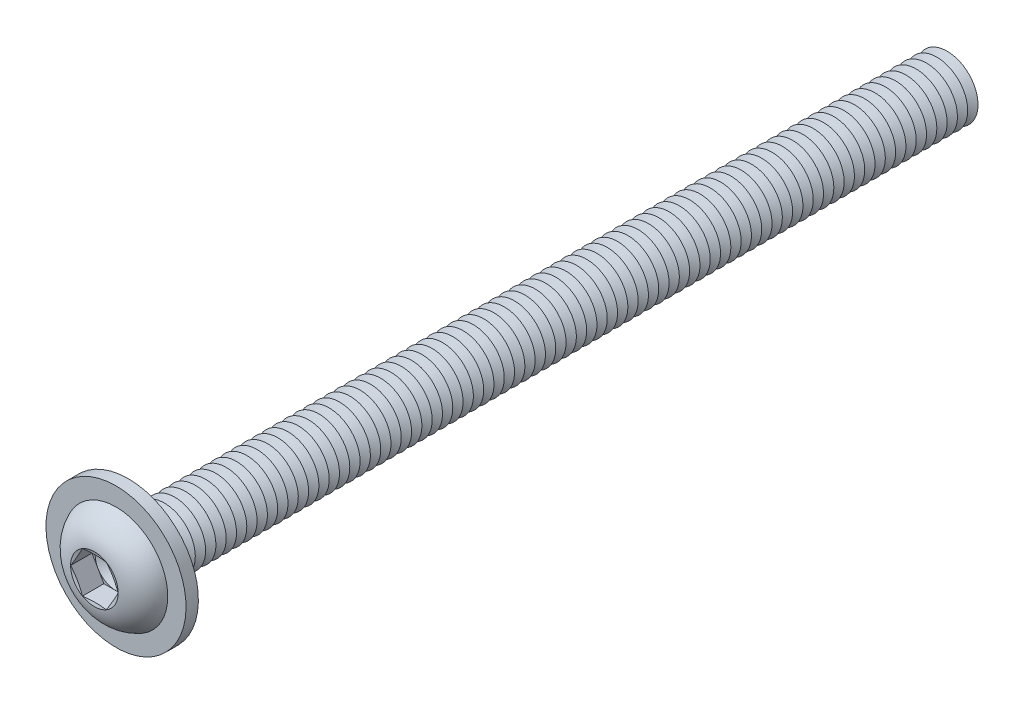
ISO-10303-21;
HEADER;
FILE_DESCRIPTION(('STEP AP214'),'2;1');
FILE_NAME('part.step','',(''),(''),'','','');
FILE_SCHEMA(('AUTOMOTIVE_DESIGN { 1 0 10303 214 1 1 1 1 }'));
ENDSEC;
DATA;
#1=APPLICATION_CONTEXT('core data for automotive mechanical design processes');
#2=APPLICATION_PROTOCOL_DEFINITION('international standard','automotive_design',2000,#1);
#3=PRODUCT_CONTEXT('',#1,'mechanical');
#4=PRODUCT('Part','Part','',(#3));
#5=PRODUCT_RELATED_PRODUCT_CATEGORY('part','',(#4));
#6=PRODUCT_DEFINITION_FORMATION('','',#4);
#7=PRODUCT_DEFINITION_CONTEXT('part definition',#1,'design');
#8=PRODUCT_DEFINITION('design','',#6,#7);
#9=PRODUCT_DEFINITION_SHAPE('','',#8);
#10=(LENGTH_UNIT() NAMED_UNIT(*) SI_UNIT(.MILLI.,.METRE.));
#11=(NAMED_UNIT(*) PLANE_ANGLE_UNIT() SI_UNIT($,.RADIAN.));
#12=(NAMED_UNIT(*) SI_UNIT($,.STERADIAN.) SOLID_ANGLE_UNIT());
#13=UNCERTAINTY_MEASURE_WITH_UNIT(LENGTH_MEASURE(1.E-05),#10,'distance_accuracy_value','');
#14=(GEOMETRIC_REPRESENTATION_CONTEXT(3) GLOBAL_UNCERTAINTY_ASSIGNED_CONTEXT((#13)) GLOBAL_UNIT_ASSIGNED_CONTEXT((#10,
#11,#12)) REPRESENTATION_CONTEXT('',''));
#15=CARTESIAN_POINT('',(0.,0.,0.));
#16=DIRECTION('',(0.,0.,1.));
#17=DIRECTION('',(1.,0.,0.));
#18=AXIS2_PLACEMENT_3D('',#15,#16,#17);
#19=CARTESIAN_POINT('',(0.,0.,-76.5));
#20=DIRECTION('',(0.,0.,1.));
#21=DIRECTION('',(0.,-1.,0.));
#22=AXIS2_PLACEMENT_3D('',#19,#20,#21);
#23=CONICAL_SURFACE('',#22,2.99999999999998,1.0471975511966);
#24=CARTESIAN_POINT('',(0.,0.,-77.));
#25=DIRECTION('',(0.,0.,1.));
#26=DIRECTION('',(0.,-1.,0.));
#27=AXIS2_PLACEMENT_3D('',#24,#25,#26);
#28=CIRCLE('',#27,2.13397459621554);
#29=CARTESIAN_POINT('',(0.,-2.1339745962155,-77.));
#30=VERTEX_POINT('',#29);
#31=EDGE_CURVE('E850',#30,#30,#28,.T.);
#32=ORIENTED_EDGE('',*,*,#31,.T.);
#33=EDGE_LOOP('',(#32));
#34=FACE_BOUND('',#33,.T.);
#35=CARTESIAN_POINT('',(0.,0.,-76.5));
#36=DIRECTION('',(0.,0.,1.));
#37=DIRECTION('',(0.,-1.,0.));
#38=AXIS2_PLACEMENT_3D('',#35,#36,#37);
#39=CIRCLE('',#38,2.99999999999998);
#40=CARTESIAN_POINT('',(0.,-2.99999999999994,-76.5));
#41=VERTEX_POINT('',#40);
#42=EDGE_CURVE('E846',#41,#41,#39,.T.);
#43=ORIENTED_EDGE('',*,*,#42,.F.);
#44=EDGE_LOOP('',(#43));
#45=FACE_BOUND('',#44,.T.);
#46=ADVANCED_FACE('F39',(#34,#45),#23,.T.);
#47=CARTESIAN_POINT('',(0.,0.,-77.));
#48=DIRECTION('',(0.,0.,-1.));
#49=DIRECTION('',(0.,1.,0.));
#50=AXIS2_PLACEMENT_3D('',#47,#48,#49);
#51=CONICAL_SURFACE('',#50,2.13397459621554,1.0471975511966);
#52=CARTESIAN_POINT('',(0.,0.,-77.5));
#53=DIRECTION('',(0.,0.,1.));
#54=DIRECTION('',(0.,-1.,0.));
#55=AXIS2_PLACEMENT_3D('',#52,#53,#54);
#56=CIRCLE('',#55,2.99999999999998);
#57=CARTESIAN_POINT('',(0.,-2.99999999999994,-77.5));
#58=VERTEX_POINT('',#57);
#59=EDGE_CURVE('E854',#58,#58,#56,.T.);
#60=ORIENTED_EDGE('',*,*,#59,.T.);
#61=EDGE_LOOP('',(#60));
#62=FACE_BOUND('',#61,.T.);
#63=ORIENTED_EDGE('',*,*,#31,.F.);
#64=EDGE_LOOP('',(#63));
#65=FACE_BOUND('',#64,.T.);
#66=ADVANCED_FACE('F970',(#62,#65),#51,.T.);
#67=CARTESIAN_POINT('',(0.,2.99999999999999,-80.));
#68=DIRECTION('',(0.,0.,-1.));
#69=DIRECTION('',(0.,1.,0.));
#70=AXIS2_PLACEMENT_3D('',#67,#68,#69);
#71=PLANE('',#70);
#72=CARTESIAN_POINT('',(0.,0.,-80.));
#73=DIRECTION('',(0.,0.,1.));
#74=DIRECTION('',(0.,-1.,0.));
#75=AXIS2_PLACEMENT_3D('',#72,#73,#74);
#76=CIRCLE('',#75,2.13397459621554);
#77=CARTESIAN_POINT('',(0.,-2.1339745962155,-80.));
#78=VERTEX_POINT('',#77);
#79=EDGE_CURVE('E873',#78,#78,#76,.T.);
#80=ORIENTED_EDGE('',*,*,#79,.F.);
#81=EDGE_LOOP('',(#80));
#82=FACE_BOUND('',#81,.T.);
#83=ADVANCED_FACE('F976',(#82),#71,.T.);
#84=CARTESIAN_POINT('',(0.,0.,-79.5));
#85=DIRECTION('',(0.,0.,1.));
#86=DIRECTION('',(0.,-1.,0.));
#87=AXIS2_PLACEMENT_3D('',#84,#85,#86);
#88=CONICAL_SURFACE('',#87,2.99999999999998,1.0471975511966);
#89=ORIENTED_EDGE('',*,*,#79,.T.);
#90=EDGE_LOOP('',(#89));
#91=FACE_BOUND('',#90,.T.);
#92=CARTESIAN_POINT('',(0.,0.,-79.5));
#93=DIRECTION('',(0.,0.,1.));
#94=DIRECTION('',(0.,-1.,0.));
#95=AXIS2_PLACEMENT_3D('',#92,#93,#94);
#96=CIRCLE('',#95,2.99999999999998);
#97=CARTESIAN_POINT('',(0.,-2.99999999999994,-79.5));
#98=VERTEX_POINT('',#97);
#99=EDGE_CURVE('E870',#98,#98,#96,.T.);
#100=ORIENTED_EDGE('',*,*,#99,.F.);
#101=EDGE_LOOP('',(#100));
#102=FACE_BOUND('',#101,.T.);
#103=ADVANCED_FACE('F995',(#91,#102),#88,.T.);
#104=CARTESIAN_POINT('',(0.,0.,-79.));
#105=DIRECTION('',(0.,0.,-1.));
#106=DIRECTION('',(0.,1.,0.));
#107=AXIS2_PLACEMENT_3D('',#104,#105,#106);
#108=CONICAL_SURFACE('',#107,2.13397459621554,1.0471975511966);
#109=ORIENTED_EDGE('',*,*,#99,.T.);
#110=EDGE_LOOP('',(#109));
#111=FACE_BOUND('',#110,.T.);
#112=CARTESIAN_POINT('',(0.,0.,-79.));
#113=DIRECTION('',(0.,0.,1.));
#114=DIRECTION('',(0.,-1.,0.));
#115=AXIS2_PLACEMENT_3D('',#112,#113,#114);
#116=CIRCLE('',#115,2.13397459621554);
#117=CARTESIAN_POINT('',(0.,-2.1339745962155,-79.));
#118=VERTEX_POINT('',#117);
#119=EDGE_CURVE('E866',#118,#118,#116,.T.);
#120=ORIENTED_EDGE('',*,*,#119,.F.);
#121=EDGE_LOOP('',(#120));
#122=FACE_BOUND('',#121,.T.);
#123=ADVANCED_FACE('F992',(#111,#122),#108,.T.);
#124=CARTESIAN_POINT('',(0.,0.,-78.5));
#125=DIRECTION('',(0.,0.,1.));
#126=DIRECTION('',(0.,-1.,0.));
#127=AXIS2_PLACEMENT_3D('',#124,#125,#126);
#128=CONICAL_SURFACE('',#127,2.99999999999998,1.0471975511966);
#129=ORIENTED_EDGE('',*,*,#119,.T.);
#130=EDGE_LOOP('',(#129));
#131=FACE_BOUND('',#130,.T.);
#132=CARTESIAN_POINT('',(0.,0.,-78.5));
#133=DIRECTION('',(0.,0.,1.));
#134=DIRECTION('',(0.,-1.,0.));
#135=AXIS2_PLACEMENT_3D('',#132,#133,#134);
#136=CIRCLE('',#135,2.99999999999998);
#137=CARTESIAN_POINT('',(0.,-2.99999999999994,-78.5));
#138=VERTEX_POINT('',#137);
#139=EDGE_CURVE('E862',#138,#138,#136,.T.);
#140=ORIENTED_EDGE('',*,*,#139,.F.);
#141=EDGE_LOOP('',(#140));
#142=FACE_BOUND('',#141,.T.);
#143=ADVANCED_FACE('F986',(#131,#142),#128,.T.);
#144=CARTESIAN_POINT('',(0.,0.,-78.));
#145=DIRECTION('',(0.,0.,-1.));
#146=DIRECTION('',(0.,1.,0.));
#147=AXIS2_PLACEMENT_3D('',#144,#145,#146);
#148=CONICAL_SURFACE('',#147,2.13397459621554,1.0471975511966);
#149=ORIENTED_EDGE('',*,*,#139,.T.);
#150=EDGE_LOOP('',(#149));
#151=FACE_BOUND('',#150,.T.);
#152=CARTESIAN_POINT('',(0.,0.,-78.));
#153=DIRECTION('',(0.,0.,1.));
#154=DIRECTION('',(0.,-1.,0.));
#155=AXIS2_PLACEMENT_3D('',#152,#153,#154);
#156=CIRCLE('',#155,2.13397459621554);
#157=CARTESIAN_POINT('',(0.,-2.1339745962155,-78.));
#158=VERTEX_POINT('',#157);
#159=EDGE_CURVE('E858',#158,#158,#156,.T.);
#160=ORIENTED_EDGE('',*,*,#159,.F.);
#161=EDGE_LOOP('',(#160));
#162=FACE_BOUND('',#161,.T.);
#163=ADVANCED_FACE('F982',(#151,#162),#148,.T.);
#164=CARTESIAN_POINT('',(0.,0.,-77.5));
#165=DIRECTION('',(0.,0.,1.));
#166=DIRECTION('',(0.,-1.,0.));
#167=AXIS2_PLACEMENT_3D('',#164,#165,#166);
#168=CONICAL_SURFACE('',#167,2.99999999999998,1.0471975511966);
#169=ORIENTED_EDGE('',*,*,#159,.T.);
#170=EDGE_LOOP('',(#169));
#171=FACE_BOUND('',#170,.T.);
#172=ORIENTED_EDGE('',*,*,#59,.F.);
#173=EDGE_LOOP('',(#172));
#174=FACE_BOUND('',#173,.T.);
#175=ADVANCED_FACE('F985',(#171,#174),#168,.T.);
#176=CARTESIAN_POINT('',(0.,0.,-75.5));
#177=DIRECTION('',(0.,0.,1.));
#178=DIRECTION('',(0.,-1.,0.));
#179=AXIS2_PLACEMENT_3D('',#176,#177,#178);
#180=CONICAL_SURFACE('',#179,2.99999999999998,1.0471975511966);
#181=CARTESIAN_POINT('',(0.,0.,-76.));
#182=DIRECTION('',(0.,0.,1.));
#183=DIRECTION('',(0.,-1.,0.));
#184=AXIS2_PLACEMENT_3D('',#181,#182,#183);
#185=CIRCLE('',#184,2.13397459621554);
#186=CARTESIAN_POINT('',(0.,-2.1339745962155,-76.));
#187=VERTEX_POINT('',#186);
#188=EDGE_CURVE('E842',#187,#187,#185,.T.);
#189=ORIENTED_EDGE('',*,*,#188,.T.);
#190=EDGE_LOOP('',(#189));
#191=FACE_BOUND('',#190,.T.);
#192=CARTESIAN_POINT('',(0.,0.,-75.5));
#193=DIRECTION('',(0.,0.,1.));
#194=DIRECTION('',(0.,-1.,0.));
#195=AXIS2_PLACEMENT_3D('',#192,#193,#194);
#196=CIRCLE('',#195,2.99999999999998);
#197=CARTESIAN_POINT('',(0.,-2.99999999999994,-75.5));
#198=VERTEX_POINT('',#197);
#199=EDGE_CURVE('E838',#198,#198,#196,.T.);
#200=ORIENTED_EDGE('',*,*,#199,.F.);
#201=EDGE_LOOP('',(#200));
#202=FACE_BOUND('',#201,.T.);
#203=ADVANCED_FACE('F990',(#191,#202),#180,.T.);
#204=CARTESIAN_POINT('',(0.,0.,-76.));
#205=DIRECTION('',(0.,0.,-1.));
#206=DIRECTION('',(0.,1.,0.));
#207=AXIS2_PLACEMENT_3D('',#204,#205,#206);
#208=CONICAL_SURFACE('',#207,2.13397459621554,1.0471975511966);
#209=ORIENTED_EDGE('',*,*,#42,.T.);
#210=EDGE_LOOP('',(#209));
#211=FACE_BOUND('',#210,.T.);
#212=ORIENTED_EDGE('',*,*,#188,.F.);
#213=EDGE_LOOP('',(#212));
#214=FACE_BOUND('',#213,.T.);
#215=ADVANCED_FACE('F1041',(#211,#214),#208,.T.);
#216=CARTESIAN_POINT('',(0.,0.,-74.5));
#217=DIRECTION('',(0.,0.,1.));
#218=DIRECTION('',(0.,-1.,0.));
#219=AXIS2_PLACEMENT_3D('',#216,#217,#218);
#220=CONICAL_SURFACE('',#219,2.99999999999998,1.0471975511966);
#221=CARTESIAN_POINT('',(0.,0.,-75.));
#222=DIRECTION('',(0.,0.,1.));
#223=DIRECTION('',(0.,-1.,0.));
#224=AXIS2_PLACEMENT_3D('',#221,#222,#223);
#225=CIRCLE('',#224,2.13397459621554);
#226=CARTESIAN_POINT('',(0.,-2.1339745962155,-75.));
#227=VERTEX_POINT('',#226);
#228=EDGE_CURVE('E834',#227,#227,#225,.T.);
#229=ORIENTED_EDGE('',*,*,#228,.T.);
#230=EDGE_LOOP('',(#229));
#231=FACE_BOUND('',#230,.T.);
#232=CARTESIAN_POINT('',(0.,0.,-74.5));
#233=DIRECTION('',(0.,0.,1.));
#234=DIRECTION('',(0.,-1.,0.));
#235=AXIS2_PLACEMENT_3D('',#232,#233,#234);
#236=CIRCLE('',#235,2.99999999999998);
#237=CARTESIAN_POINT('',(0.,-2.99999999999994,-74.5));
#238=VERTEX_POINT('',#237);
#239=EDGE_CURVE('E830',#238,#238,#236,.T.);
#240=ORIENTED_EDGE('',*,*,#239,.F.);
#241=EDGE_LOOP('',(#240));
#242=FACE_BOUND('',#241,.T.);
#243=ADVANCED_FACE('F1047',(#231,#242),#220,.T.);
#244=CARTESIAN_POINT('',(0.,0.,-75.));
#245=DIRECTION('',(0.,0.,-1.));
#246=DIRECTION('',(0.,1.,0.));
#247=AXIS2_PLACEMENT_3D('',#244,#245,#246);
#248=CONICAL_SURFACE('',#247,2.13397459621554,1.0471975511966);
#249=ORIENTED_EDGE('',*,*,#199,.T.);
#250=EDGE_LOOP('',(#249));
#251=FACE_BOUND('',#250,.T.);
#252=ORIENTED_EDGE('',*,*,#228,.F.);
#253=EDGE_LOOP('',(#252));
#254=FACE_BOUND('',#253,.T.);
#255=ADVANCED_FACE('F1054',(#251,#254),#248,.T.);
#256=CARTESIAN_POINT('',(0.,0.,-73.5));
#257=DIRECTION('',(0.,0.,1.));
#258=DIRECTION('',(0.,-1.,0.));
#259=AXIS2_PLACEMENT_3D('',#256,#257,#258);
#260=CONICAL_SURFACE('',#259,2.99999999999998,1.0471975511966);
#261=CARTESIAN_POINT('',(0.,0.,-74.));
#262=DIRECTION('',(0.,0.,1.));
#263=DIRECTION('',(0.,-1.,0.));
#264=AXIS2_PLACEMENT_3D('',#261,#262,#263);
#265=CIRCLE('',#264,2.13397459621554);
#266=CARTESIAN_POINT('',(0.,-2.1339745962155,-74.));
#267=VERTEX_POINT('',#266);
#268=EDGE_CURVE('E826',#267,#267,#265,.T.);
#269=ORIENTED_EDGE('',*,*,#268,.T.);
#270=EDGE_LOOP('',(#269));
#271=FACE_BOUND('',#270,.T.);
#272=CARTESIAN_POINT('',(0.,0.,-73.5));
#273=DIRECTION('',(0.,0.,1.));
#274=DIRECTION('',(0.,-1.,0.));
#275=AXIS2_PLACEMENT_3D('',#272,#273,#274);
#276=CIRCLE('',#275,2.99999999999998);
#277=CARTESIAN_POINT('',(0.,-2.99999999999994,-73.5));
#278=VERTEX_POINT('',#277);
#279=EDGE_CURVE('E822',#278,#278,#276,.T.);
#280=ORIENTED_EDGE('',*,*,#279,.F.);
#281=EDGE_LOOP('',(#280));
#282=FACE_BOUND('',#281,.T.);
#283=ADVANCED_FACE('F1061',(#271,#282),#260,.T.);
#284=CARTESIAN_POINT('',(0.,0.,-74.));
#285=DIRECTION('',(0.,0.,-1.));
#286=DIRECTION('',(0.,1.,0.));
#287=AXIS2_PLACEMENT_3D('',#284,#285,#286);
#288=CONICAL_SURFACE('',#287,2.13397459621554,1.0471975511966);
#289=ORIENTED_EDGE('',*,*,#239,.T.);
#290=EDGE_LOOP('',(#289));
#291=FACE_BOUND('',#290,.T.);
#292=ORIENTED_EDGE('',*,*,#268,.F.);
#293=EDGE_LOOP('',(#292));
#294=FACE_BOUND('',#293,.T.);
#295=ADVANCED_FACE('F1068',(#291,#294),#288,.T.);
#296=CARTESIAN_POINT('',(0.,0.,-72.5));
#297=DIRECTION('',(0.,0.,1.));
#298=DIRECTION('',(0.,-1.,0.));
#299=AXIS2_PLACEMENT_3D('',#296,#297,#298);
#300=CONICAL_SURFACE('',#299,2.99999999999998,1.0471975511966);
#301=CARTESIAN_POINT('',(0.,0.,-73.));
#302=DIRECTION('',(0.,0.,1.));
#303=DIRECTION('',(0.,-1.,0.));
#304=AXIS2_PLACEMENT_3D('',#301,#302,#303);
#305=CIRCLE('',#304,2.13397459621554);
#306=CARTESIAN_POINT('',(0.,-2.1339745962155,-73.));
#307=VERTEX_POINT('',#306);
#308=EDGE_CURVE('E818',#307,#307,#305,.T.);
#309=ORIENTED_EDGE('',*,*,#308,.T.);
#310=EDGE_LOOP('',(#309));
#311=FACE_BOUND('',#310,.T.);
#312=CARTESIAN_POINT('',(0.,0.,-72.5));
#313=DIRECTION('',(0.,0.,1.));
#314=DIRECTION('',(0.,-1.,0.));
#315=AXIS2_PLACEMENT_3D('',#312,#313,#314);
#316=CIRCLE('',#315,2.99999999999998);
#317=CARTESIAN_POINT('',(0.,-2.99999999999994,-72.5));
#318=VERTEX_POINT('',#317);
#319=EDGE_CURVE('E814',#318,#318,#316,.T.);
#320=ORIENTED_EDGE('',*,*,#319,.F.);
#321=EDGE_LOOP('',(#320));
#322=FACE_BOUND('',#321,.T.);
#323=ADVANCED_FACE('F1075',(#311,#322),#300,.T.);
#324=CARTESIAN_POINT('',(0.,0.,-73.));
#325=DIRECTION('',(0.,0.,-1.));
#326=DIRECTION('',(0.,1.,0.));
#327=AXIS2_PLACEMENT_3D('',#324,#325,#326);
#328=CONICAL_SURFACE('',#327,2.13397459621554,1.0471975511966);
#329=ORIENTED_EDGE('',*,*,#279,.T.);
#330=EDGE_LOOP('',(#329));
#331=FACE_BOUND('',#330,.T.);
#332=ORIENTED_EDGE('',*,*,#308,.F.);
#333=EDGE_LOOP('',(#332));
#334=FACE_BOUND('',#333,.T.);
#335=ADVANCED_FACE('F1082',(#331,#334),#328,.T.);
#336=CARTESIAN_POINT('',(0.,0.,-71.5));
#337=DIRECTION('',(0.,0.,1.));
#338=DIRECTION('',(0.,-1.,0.));
#339=AXIS2_PLACEMENT_3D('',#336,#337,#338);
#340=CONICAL_SURFACE('',#339,2.99999999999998,1.0471975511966);
#341=CARTESIAN_POINT('',(0.,0.,-72.));
#342=DIRECTION('',(0.,0.,1.));
#343=DIRECTION('',(0.,-1.,0.));
#344=AXIS2_PLACEMENT_3D('',#341,#342,#343);
#345=CIRCLE('',#344,2.13397459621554);
#346=CARTESIAN_POINT('',(0.,-2.1339745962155,-72.));
#347=VERTEX_POINT('',#346);
#348=EDGE_CURVE('E810',#347,#347,#345,.T.);
#349=ORIENTED_EDGE('',*,*,#348,.T.);
#350=EDGE_LOOP('',(#349));
#351=FACE_BOUND('',#350,.T.);
#352=CARTESIAN_POINT('',(0.,0.,-71.5));
#353=DIRECTION('',(0.,0.,1.));
#354=DIRECTION('',(0.,-1.,0.));
#355=AXIS2_PLACEMENT_3D('',#352,#353,#354);
#356=CIRCLE('',#355,2.99999999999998);
#357=CARTESIAN_POINT('',(0.,-2.99999999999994,-71.5));
#358=VERTEX_POINT('',#357);
#359=EDGE_CURVE('E806',#358,#358,#356,.T.);
#360=ORIENTED_EDGE('',*,*,#359,.F.);
#361=EDGE_LOOP('',(#360));
#362=FACE_BOUND('',#361,.T.);
#363=ADVANCED_FACE('F1089',(#351,#362),#340,.T.);
#364=CARTESIAN_POINT('',(0.,0.,-72.));
#365=DIRECTION('',(0.,0.,-1.));
#366=DIRECTION('',(0.,1.,0.));
#367=AXIS2_PLACEMENT_3D('',#364,#365,#366);
#368=CONICAL_SURFACE('',#367,2.13397459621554,1.0471975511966);
#369=ORIENTED_EDGE('',*,*,#319,.T.);
#370=EDGE_LOOP('',(#369));
#371=FACE_BOUND('',#370,.T.);
#372=ORIENTED_EDGE('',*,*,#348,.F.);
#373=EDGE_LOOP('',(#372));
#374=FACE_BOUND('',#373,.T.);
#375=ADVANCED_FACE('F1096',(#371,#374),#368,.T.);
#376=CARTESIAN_POINT('',(0.,0.,-70.5));
#377=DIRECTION('',(0.,0.,1.));
#378=DIRECTION('',(0.,-1.,0.));
#379=AXIS2_PLACEMENT_3D('',#376,#377,#378);
#380=CONICAL_SURFACE('',#379,2.99999999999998,1.0471975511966);
#381=CARTESIAN_POINT('',(0.,0.,-71.));
#382=DIRECTION('',(0.,0.,1.));
#383=DIRECTION('',(0.,-1.,0.));
#384=AXIS2_PLACEMENT_3D('',#381,#382,#383);
#385=CIRCLE('',#384,2.13397459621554);
#386=CARTESIAN_POINT('',(0.,-2.1339745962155,-71.));
#387=VERTEX_POINT('',#386);
#388=EDGE_CURVE('E802',#387,#387,#385,.T.);
#389=ORIENTED_EDGE('',*,*,#388,.T.);
#390=EDGE_LOOP('',(#389));
#391=FACE_BOUND('',#390,.T.);
#392=CARTESIAN_POINT('',(0.,0.,-70.5));
#393=DIRECTION('',(0.,0.,1.));
#394=DIRECTION('',(0.,-1.,0.));
#395=AXIS2_PLACEMENT_3D('',#392,#393,#394);
#396=CIRCLE('',#395,2.99999999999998);
#397=CARTESIAN_POINT('',(0.,-2.99999999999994,-70.5));
#398=VERTEX_POINT('',#397);
#399=EDGE_CURVE('E798',#398,#398,#396,.T.);
#400=ORIENTED_EDGE('',*,*,#399,.F.);
#401=EDGE_LOOP('',(#400));
#402=FACE_BOUND('',#401,.T.);
#403=ADVANCED_FACE('F1103',(#391,#402),#380,.T.);
#404=CARTESIAN_POINT('',(0.,0.,-71.));
#405=DIRECTION('',(0.,0.,-1.));
#406=DIRECTION('',(0.,1.,0.));
#407=AXIS2_PLACEMENT_3D('',#404,#405,#406);
#408=CONICAL_SURFACE('',#407,2.13397459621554,1.0471975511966);
#409=ORIENTED_EDGE('',*,*,#359,.T.);
#410=EDGE_LOOP('',(#409));
#411=FACE_BOUND('',#410,.T.);
#412=ORIENTED_EDGE('',*,*,#388,.F.);
#413=EDGE_LOOP('',(#412));
#414=FACE_BOUND('',#413,.T.);
#415=ADVANCED_FACE('F1110',(#411,#414),#408,.T.);
#416=CARTESIAN_POINT('',(0.,0.,-69.5));
#417=DIRECTION('',(0.,0.,1.));
#418=DIRECTION('',(0.,-1.,0.));
#419=AXIS2_PLACEMENT_3D('',#416,#417,#418);
#420=CONICAL_SURFACE('',#419,2.99999999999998,1.0471975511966);
#421=CARTESIAN_POINT('',(0.,0.,-70.));
#422=DIRECTION('',(0.,0.,1.));
#423=DIRECTION('',(0.,-1.,0.));
#424=AXIS2_PLACEMENT_3D('',#421,#422,#423);
#425=CIRCLE('',#424,2.13397459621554);
#426=CARTESIAN_POINT('',(0.,-2.1339745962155,-70.));
#427=VERTEX_POINT('',#426);
#428=EDGE_CURVE('E794',#427,#427,#425,.T.);
#429=ORIENTED_EDGE('',*,*,#428,.T.);
#430=EDGE_LOOP('',(#429));
#431=FACE_BOUND('',#430,.T.);
#432=CARTESIAN_POINT('',(0.,0.,-69.5));
#433=DIRECTION('',(0.,0.,1.));
#434=DIRECTION('',(0.,-1.,0.));
#435=AXIS2_PLACEMENT_3D('',#432,#433,#434);
#436=CIRCLE('',#435,2.99999999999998);
#437=CARTESIAN_POINT('',(0.,-2.99999999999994,-69.5));
#438=VERTEX_POINT('',#437);
#439=EDGE_CURVE('E790',#438,#438,#436,.T.);
#440=ORIENTED_EDGE('',*,*,#439,.F.);
#441=EDGE_LOOP('',(#440));
#442=FACE_BOUND('',#441,.T.);
#443=ADVANCED_FACE('F1117',(#431,#442),#420,.T.);
#444=CARTESIAN_POINT('',(0.,0.,-70.));
#445=DIRECTION('',(0.,0.,-1.));
#446=DIRECTION('',(0.,1.,0.));
#447=AXIS2_PLACEMENT_3D('',#444,#445,#446);
#448=CONICAL_SURFACE('',#447,2.13397459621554,1.0471975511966);
#449=ORIENTED_EDGE('',*,*,#399,.T.);
#450=EDGE_LOOP('',(#449));
#451=FACE_BOUND('',#450,.T.);
#452=ORIENTED_EDGE('',*,*,#428,.F.);
#453=EDGE_LOOP('',(#452));
#454=FACE_BOUND('',#453,.T.);
#455=ADVANCED_FACE('F1124',(#451,#454),#448,.T.);
#456=CARTESIAN_POINT('',(0.,0.,-68.5));
#457=DIRECTION('',(0.,0.,1.));
#458=DIRECTION('',(0.,-1.,0.));
#459=AXIS2_PLACEMENT_3D('',#456,#457,#458);
#460=CONICAL_SURFACE('',#459,2.99999999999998,1.0471975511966);
#461=CARTESIAN_POINT('',(0.,0.,-69.));
#462=DIRECTION('',(0.,0.,1.));
#463=DIRECTION('',(0.,-1.,0.));
#464=AXIS2_PLACEMENT_3D('',#461,#462,#463);
#465=CIRCLE('',#464,2.13397459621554);
#466=CARTESIAN_POINT('',(0.,-2.1339745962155,-69.));
#467=VERTEX_POINT('',#466);
#468=EDGE_CURVE('E786',#467,#467,#465,.T.);
#469=ORIENTED_EDGE('',*,*,#468,.T.);
#470=EDGE_LOOP('',(#469));
#471=FACE_BOUND('',#470,.T.);
#472=CARTESIAN_POINT('',(0.,0.,-68.5));
#473=DIRECTION('',(0.,0.,1.));
#474=DIRECTION('',(0.,-1.,0.));
#475=AXIS2_PLACEMENT_3D('',#472,#473,#474);
#476=CIRCLE('',#475,2.99999999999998);
#477=CARTESIAN_POINT('',(0.,-2.99999999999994,-68.5));
#478=VERTEX_POINT('',#477);
#479=EDGE_CURVE('E782',#478,#478,#476,.T.);
#480=ORIENTED_EDGE('',*,*,#479,.F.);
#481=EDGE_LOOP('',(#480));
#482=FACE_BOUND('',#481,.T.);
#483=ADVANCED_FACE('F1131',(#471,#482),#460,.T.);
#484=CARTESIAN_POINT('',(0.,0.,-69.));
#485=DIRECTION('',(0.,0.,-1.));
#486=DIRECTION('',(0.,1.,0.));
#487=AXIS2_PLACEMENT_3D('',#484,#485,#486);
#488=CONICAL_SURFACE('',#487,2.13397459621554,1.0471975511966);
#489=ORIENTED_EDGE('',*,*,#439,.T.);
#490=EDGE_LOOP('',(#489));
#491=FACE_BOUND('',#490,.T.);
#492=ORIENTED_EDGE('',*,*,#468,.F.);
#493=EDGE_LOOP('',(#492));
#494=FACE_BOUND('',#493,.T.);
#495=ADVANCED_FACE('F1138',(#491,#494),#488,.T.);
#496=CARTESIAN_POINT('',(0.,0.,-67.5));
#497=DIRECTION('',(0.,0.,1.));
#498=DIRECTION('',(0.,-1.,0.));
#499=AXIS2_PLACEMENT_3D('',#496,#497,#498);
#500=CONICAL_SURFACE('',#499,2.99999999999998,1.0471975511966);
#501=CARTESIAN_POINT('',(0.,0.,-68.));
#502=DIRECTION('',(0.,0.,1.));
#503=DIRECTION('',(0.,-1.,0.));
#504=AXIS2_PLACEMENT_3D('',#501,#502,#503);
#505=CIRCLE('',#504,2.13397459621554);
#506=CARTESIAN_POINT('',(0.,-2.1339745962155,-68.));
#507=VERTEX_POINT('',#506);
#508=EDGE_CURVE('E778',#507,#507,#505,.T.);
#509=ORIENTED_EDGE('',*,*,#508,.T.);
#510=EDGE_LOOP('',(#509));
#511=FACE_BOUND('',#510,.T.);
#512=CARTESIAN_POINT('',(0.,0.,-67.5));
#513=DIRECTION('',(0.,0.,1.));
#514=DIRECTION('',(0.,-1.,0.));
#515=AXIS2_PLACEMENT_3D('',#512,#513,#514);
#516=CIRCLE('',#515,2.99999999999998);
#517=CARTESIAN_POINT('',(0.,-2.99999999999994,-67.5));
#518=VERTEX_POINT('',#517);
#519=EDGE_CURVE('E774',#518,#518,#516,.T.);
#520=ORIENTED_EDGE('',*,*,#519,.F.);
#521=EDGE_LOOP('',(#520));
#522=FACE_BOUND('',#521,.T.);
#523=ADVANCED_FACE('F1145',(#511,#522),#500,.T.);
#524=CARTESIAN_POINT('',(0.,0.,-68.));
#525=DIRECTION('',(0.,0.,-1.));
#526=DIRECTION('',(0.,1.,0.));
#527=AXIS2_PLACEMENT_3D('',#524,#525,#526);
#528=CONICAL_SURFACE('',#527,2.13397459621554,1.0471975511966);
#529=ORIENTED_EDGE('',*,*,#479,.T.);
#530=EDGE_LOOP('',(#529));
#531=FACE_BOUND('',#530,.T.);
#532=ORIENTED_EDGE('',*,*,#508,.F.);
#533=EDGE_LOOP('',(#532));
#534=FACE_BOUND('',#533,.T.);
#535=ADVANCED_FACE('F1152',(#531,#534),#528,.T.);
#536=CARTESIAN_POINT('',(0.,0.,-66.5));
#537=DIRECTION('',(0.,0.,1.));
#538=DIRECTION('',(0.,-1.,0.));
#539=AXIS2_PLACEMENT_3D('',#536,#537,#538);
#540=CONICAL_SURFACE('',#539,2.99999999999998,1.0471975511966);
#541=CARTESIAN_POINT('',(0.,0.,-67.));
#542=DIRECTION('',(0.,0.,1.));
#543=DIRECTION('',(0.,-1.,0.));
#544=AXIS2_PLACEMENT_3D('',#541,#542,#543);
#545=CIRCLE('',#544,2.13397459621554);
#546=CARTESIAN_POINT('',(0.,-2.1339745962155,-67.));
#547=VERTEX_POINT('',#546);
#548=EDGE_CURVE('E770',#547,#547,#545,.T.);
#549=ORIENTED_EDGE('',*,*,#548,.T.);
#550=EDGE_LOOP('',(#549));
#551=FACE_BOUND('',#550,.T.);
#552=CARTESIAN_POINT('',(0.,0.,-66.5));
#553=DIRECTION('',(0.,0.,1.));
#554=DIRECTION('',(0.,-1.,0.));
#555=AXIS2_PLACEMENT_3D('',#552,#553,#554);
#556=CIRCLE('',#555,2.99999999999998);
#557=CARTESIAN_POINT('',(0.,-2.99999999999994,-66.5));
#558=VERTEX_POINT('',#557);
#559=EDGE_CURVE('E766',#558,#558,#556,.T.);
#560=ORIENTED_EDGE('',*,*,#559,.F.);
#561=EDGE_LOOP('',(#560));
#562=FACE_BOUND('',#561,.T.);
#563=ADVANCED_FACE('F1159',(#551,#562),#540,.T.);
#564=CARTESIAN_POINT('',(0.,0.,-67.));
#565=DIRECTION('',(0.,0.,-1.));
#566=DIRECTION('',(0.,1.,0.));
#567=AXIS2_PLACEMENT_3D('',#564,#565,#566);
#568=CONICAL_SURFACE('',#567,2.13397459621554,1.0471975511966);
#569=ORIENTED_EDGE('',*,*,#519,.T.);
#570=EDGE_LOOP('',(#569));
#571=FACE_BOUND('',#570,.T.);
#572=ORIENTED_EDGE('',*,*,#548,.F.);
#573=EDGE_LOOP('',(#572));
#574=FACE_BOUND('',#573,.T.);
#575=ADVANCED_FACE('F1166',(#571,#574),#568,.T.);
#576=CARTESIAN_POINT('',(0.,0.,-65.5));
#577=DIRECTION('',(0.,0.,1.));
#578=DIRECTION('',(0.,-1.,0.));
#579=AXIS2_PLACEMENT_3D('',#576,#577,#578);
#580=CONICAL_SURFACE('',#579,2.99999999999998,1.0471975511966);
#581=CARTESIAN_POINT('',(0.,0.,-66.));
#582=DIRECTION('',(0.,0.,1.));
#583=DIRECTION('',(0.,-1.,0.));
#584=AXIS2_PLACEMENT_3D('',#581,#582,#583);
#585=CIRCLE('',#584,2.13397459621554);
#586=CARTESIAN_POINT('',(0.,-2.1339745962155,-66.));
#587=VERTEX_POINT('',#586);
#588=EDGE_CURVE('E762',#587,#587,#585,.T.);
#589=ORIENTED_EDGE('',*,*,#588,.T.);
#590=EDGE_LOOP('',(#589));
#591=FACE_BOUND('',#590,.T.);
#592=CARTESIAN_POINT('',(0.,0.,-65.5));
#593=DIRECTION('',(0.,0.,1.));
#594=DIRECTION('',(0.,-1.,0.));
#595=AXIS2_PLACEMENT_3D('',#592,#593,#594);
#596=CIRCLE('',#595,2.99999999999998);
#597=CARTESIAN_POINT('',(0.,-2.99999999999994,-65.5));
#598=VERTEX_POINT('',#597);
#599=EDGE_CURVE('E758',#598,#598,#596,.T.);
#600=ORIENTED_EDGE('',*,*,#599,.F.);
#601=EDGE_LOOP('',(#600));
#602=FACE_BOUND('',#601,.T.);
#603=ADVANCED_FACE('F1173',(#591,#602),#580,.T.);
#604=CARTESIAN_POINT('',(0.,0.,-66.));
#605=DIRECTION('',(0.,0.,-1.));
#606=DIRECTION('',(0.,1.,0.));
#607=AXIS2_PLACEMENT_3D('',#604,#605,#606);
#608=CONICAL_SURFACE('',#607,2.13397459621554,1.0471975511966);
#609=ORIENTED_EDGE('',*,*,#559,.T.);
#610=EDGE_LOOP('',(#609));
#611=FACE_BOUND('',#610,.T.);
#612=ORIENTED_EDGE('',*,*,#588,.F.);
#613=EDGE_LOOP('',(#612));
#614=FACE_BOUND('',#613,.T.);
#615=ADVANCED_FACE('F1180',(#611,#614),#608,.T.);
#616=CARTESIAN_POINT('',(0.,0.,-64.5));
#617=DIRECTION('',(0.,0.,1.));
#618=DIRECTION('',(0.,-1.,0.));
#619=AXIS2_PLACEMENT_3D('',#616,#617,#618);
#620=CONICAL_SURFACE('',#619,2.99999999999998,1.0471975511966);
#621=CARTESIAN_POINT('',(0.,0.,-65.));
#622=DIRECTION('',(0.,0.,1.));
#623=DIRECTION('',(0.,-1.,0.));
#624=AXIS2_PLACEMENT_3D('',#621,#622,#623);
#625=CIRCLE('',#624,2.13397459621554);
#626=CARTESIAN_POINT('',(0.,-2.1339745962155,-65.));
#627=VERTEX_POINT('',#626);
#628=EDGE_CURVE('E754',#627,#627,#625,.T.);
#629=ORIENTED_EDGE('',*,*,#628,.T.);
#630=EDGE_LOOP('',(#629));
#631=FACE_BOUND('',#630,.T.);
#632=CARTESIAN_POINT('',(0.,0.,-64.5));
#633=DIRECTION('',(0.,0.,1.));
#634=DIRECTION('',(0.,-1.,0.));
#635=AXIS2_PLACEMENT_3D('',#632,#633,#634);
#636=CIRCLE('',#635,2.99999999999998);
#637=CARTESIAN_POINT('',(0.,-2.99999999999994,-64.5));
#638=VERTEX_POINT('',#637);
#639=EDGE_CURVE('E750',#638,#638,#636,.T.);
#640=ORIENTED_EDGE('',*,*,#639,.F.);
#641=EDGE_LOOP('',(#640));
#642=FACE_BOUND('',#641,.T.);
#643=ADVANCED_FACE('F1187',(#631,#642),#620,.T.);
#644=CARTESIAN_POINT('',(0.,0.,-65.));
#645=DIRECTION('',(0.,0.,-1.));
#646=DIRECTION('',(0.,1.,0.));
#647=AXIS2_PLACEMENT_3D('',#644,#645,#646);
#648=CONICAL_SURFACE('',#647,2.13397459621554,1.0471975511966);
#649=ORIENTED_EDGE('',*,*,#599,.T.);
#650=EDGE_LOOP('',(#649));
#651=FACE_BOUND('',#650,.T.);
#652=ORIENTED_EDGE('',*,*,#628,.F.);
#653=EDGE_LOOP('',(#652));
#654=FACE_BOUND('',#653,.T.);
#655=ADVANCED_FACE('F1194',(#651,#654),#648,.T.);
#656=CARTESIAN_POINT('',(0.,0.,-63.5));
#657=DIRECTION('',(0.,0.,1.));
#658=DIRECTION('',(0.,-1.,0.));
#659=AXIS2_PLACEMENT_3D('',#656,#657,#658);
#660=CONICAL_SURFACE('',#659,2.99999999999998,1.0471975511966);
#661=CARTESIAN_POINT('',(0.,0.,-64.));
#662=DIRECTION('',(0.,0.,1.));
#663=DIRECTION('',(0.,-1.,0.));
#664=AXIS2_PLACEMENT_3D('',#661,#662,#663);
#665=CIRCLE('',#664,2.13397459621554);
#666=CARTESIAN_POINT('',(0.,-2.1339745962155,-64.));
#667=VERTEX_POINT('',#666);
#668=EDGE_CURVE('E746',#667,#667,#665,.T.);
#669=ORIENTED_EDGE('',*,*,#668,.T.);
#670=EDGE_LOOP('',(#669));
#671=FACE_BOUND('',#670,.T.);
#672=CARTESIAN_POINT('',(0.,0.,-63.5));
#673=DIRECTION('',(0.,0.,1.));
#674=DIRECTION('',(0.,-1.,0.));
#675=AXIS2_PLACEMENT_3D('',#672,#673,#674);
#676=CIRCLE('',#675,2.99999999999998);
#677=CARTESIAN_POINT('',(0.,-2.99999999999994,-63.5));
#678=VERTEX_POINT('',#677);
#679=EDGE_CURVE('E742',#678,#678,#676,.T.);
#680=ORIENTED_EDGE('',*,*,#679,.F.);
#681=EDGE_LOOP('',(#680));
#682=FACE_BOUND('',#681,.T.);
#683=ADVANCED_FACE('F1201',(#671,#682),#660,.T.);
#684=CARTESIAN_POINT('',(0.,0.,-64.));
#685=DIRECTION('',(0.,0.,-1.));
#686=DIRECTION('',(0.,1.,0.));
#687=AXIS2_PLACEMENT_3D('',#684,#685,#686);
#688=CONICAL_SURFACE('',#687,2.13397459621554,1.0471975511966);
#689=ORIENTED_EDGE('',*,*,#639,.T.);
#690=EDGE_LOOP('',(#689));
#691=FACE_BOUND('',#690,.T.);
#692=ORIENTED_EDGE('',*,*,#668,.F.);
#693=EDGE_LOOP('',(#692));
#694=FACE_BOUND('',#693,.T.);
#695=ADVANCED_FACE('F1208',(#691,#694),#688,.T.);
#696=CARTESIAN_POINT('',(0.,0.,-62.5));
#697=DIRECTION('',(0.,0.,1.));
#698=DIRECTION('',(0.,-1.,0.));
#699=AXIS2_PLACEMENT_3D('',#696,#697,#698);
#700=CONICAL_SURFACE('',#699,2.99999999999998,1.0471975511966);
#701=CARTESIAN_POINT('',(0.,0.,-63.));
#702=DIRECTION('',(0.,0.,1.));
#703=DIRECTION('',(0.,-1.,0.));
#704=AXIS2_PLACEMENT_3D('',#701,#702,#703);
#705=CIRCLE('',#704,2.13397459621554);
#706=CARTESIAN_POINT('',(0.,-2.1339745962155,-63.));
#707=VERTEX_POINT('',#706);
#708=EDGE_CURVE('E738',#707,#707,#705,.T.);
#709=ORIENTED_EDGE('',*,*,#708,.T.);
#710=EDGE_LOOP('',(#709));
#711=FACE_BOUND('',#710,.T.);
#712=CARTESIAN_POINT('',(0.,0.,-62.5));
#713=DIRECTION('',(0.,0.,1.));
#714=DIRECTION('',(0.,-1.,0.));
#715=AXIS2_PLACEMENT_3D('',#712,#713,#714);
#716=CIRCLE('',#715,2.99999999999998);
#717=CARTESIAN_POINT('',(0.,-2.99999999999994,-62.5));
#718=VERTEX_POINT('',#717);
#719=EDGE_CURVE('E734',#718,#718,#716,.T.);
#720=ORIENTED_EDGE('',*,*,#719,.F.);
#721=EDGE_LOOP('',(#720));
#722=FACE_BOUND('',#721,.T.);
#723=ADVANCED_FACE('F1215',(#711,#722),#700,.T.);
#724=CARTESIAN_POINT('',(0.,0.,-63.));
#725=DIRECTION('',(0.,0.,-1.));
#726=DIRECTION('',(0.,1.,0.));
#727=AXIS2_PLACEMENT_3D('',#724,#725,#726);
#728=CONICAL_SURFACE('',#727,2.13397459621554,1.0471975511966);
#729=ORIENTED_EDGE('',*,*,#679,.T.);
#730=EDGE_LOOP('',(#729));
#731=FACE_BOUND('',#730,.T.);
#732=ORIENTED_EDGE('',*,*,#708,.F.);
#733=EDGE_LOOP('',(#732));
#734=FACE_BOUND('',#733,.T.);
#735=ADVANCED_FACE('F1222',(#731,#734),#728,.T.);
#736=CARTESIAN_POINT('',(0.,0.,-61.5));
#737=DIRECTION('',(0.,0.,1.));
#738=DIRECTION('',(0.,-1.,0.));
#739=AXIS2_PLACEMENT_3D('',#736,#737,#738);
#740=CONICAL_SURFACE('',#739,2.99999999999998,1.0471975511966);
#741=CARTESIAN_POINT('',(0.,0.,-62.));
#742=DIRECTION('',(0.,0.,1.));
#743=DIRECTION('',(0.,-1.,0.));
#744=AXIS2_PLACEMENT_3D('',#741,#742,#743);
#745=CIRCLE('',#744,2.13397459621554);
#746=CARTESIAN_POINT('',(0.,-2.1339745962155,-62.));
#747=VERTEX_POINT('',#746);
#748=EDGE_CURVE('E730',#747,#747,#745,.T.);
#749=ORIENTED_EDGE('',*,*,#748,.T.);
#750=EDGE_LOOP('',(#749));
#751=FACE_BOUND('',#750,.T.);
#752=CARTESIAN_POINT('',(0.,0.,-61.5));
#753=DIRECTION('',(0.,0.,1.));
#754=DIRECTION('',(0.,-1.,0.));
#755=AXIS2_PLACEMENT_3D('',#752,#753,#754);
#756=CIRCLE('',#755,2.99999999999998);
#757=CARTESIAN_POINT('',(0.,-2.99999999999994,-61.5));
#758=VERTEX_POINT('',#757);
#759=EDGE_CURVE('E726',#758,#758,#756,.T.);
#760=ORIENTED_EDGE('',*,*,#759,.F.);
#761=EDGE_LOOP('',(#760));
#762=FACE_BOUND('',#761,.T.);
#763=ADVANCED_FACE('F1229',(#751,#762),#740,.T.);
#764=CARTESIAN_POINT('',(0.,0.,-62.));
#765=DIRECTION('',(0.,0.,-1.));
#766=DIRECTION('',(0.,1.,0.));
#767=AXIS2_PLACEMENT_3D('',#764,#765,#766);
#768=CONICAL_SURFACE('',#767,2.13397459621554,1.0471975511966);
#769=ORIENTED_EDGE('',*,*,#719,.T.);
#770=EDGE_LOOP('',(#769));
#771=FACE_BOUND('',#770,.T.);
#772=ORIENTED_EDGE('',*,*,#748,.F.);
#773=EDGE_LOOP('',(#772));
#774=FACE_BOUND('',#773,.T.);
#775=ADVANCED_FACE('F1236',(#771,#774),#768,.T.);
#776=CARTESIAN_POINT('',(0.,0.,-60.5));
#777=DIRECTION('',(0.,0.,1.));
#778=DIRECTION('',(0.,-1.,0.));
#779=AXIS2_PLACEMENT_3D('',#776,#777,#778);
#780=CONICAL_SURFACE('',#779,2.99999999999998,1.0471975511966);
#781=CARTESIAN_POINT('',(0.,0.,-61.));
#782=DIRECTION('',(0.,0.,1.));
#783=DIRECTION('',(0.,-1.,0.));
#784=AXIS2_PLACEMENT_3D('',#781,#782,#783);
#785=CIRCLE('',#784,2.13397459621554);
#786=CARTESIAN_POINT('',(0.,-2.1339745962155,-61.));
#787=VERTEX_POINT('',#786);
#788=EDGE_CURVE('E722',#787,#787,#785,.T.);
#789=ORIENTED_EDGE('',*,*,#788,.T.);
#790=EDGE_LOOP('',(#789));
#791=FACE_BOUND('',#790,.T.);
#792=CARTESIAN_POINT('',(0.,0.,-60.5));
#793=DIRECTION('',(0.,0.,1.));
#794=DIRECTION('',(0.,-1.,0.));
#795=AXIS2_PLACEMENT_3D('',#792,#793,#794);
#796=CIRCLE('',#795,2.99999999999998);
#797=CARTESIAN_POINT('',(0.,-2.99999999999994,-60.5));
#798=VERTEX_POINT('',#797);
#799=EDGE_CURVE('E718',#798,#798,#796,.T.);
#800=ORIENTED_EDGE('',*,*,#799,.F.);
#801=EDGE_LOOP('',(#800));
#802=FACE_BOUND('',#801,.T.);
#803=ADVANCED_FACE('F1243',(#791,#802),#780,.T.);
#804=CARTESIAN_POINT('',(0.,0.,-61.));
#805=DIRECTION('',(0.,0.,-1.));
#806=DIRECTION('',(0.,1.,0.));
#807=AXIS2_PLACEMENT_3D('',#804,#805,#806);
#808=CONICAL_SURFACE('',#807,2.13397459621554,1.0471975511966);
#809=ORIENTED_EDGE('',*,*,#759,.T.);
#810=EDGE_LOOP('',(#809));
#811=FACE_BOUND('',#810,.T.);
#812=ORIENTED_EDGE('',*,*,#788,.F.);
#813=EDGE_LOOP('',(#812));
#814=FACE_BOUND('',#813,.T.);
#815=ADVANCED_FACE('F1250',(#811,#814),#808,.T.);
#816=CARTESIAN_POINT('',(0.,0.,-59.5));
#817=DIRECTION('',(0.,0.,1.));
#818=DIRECTION('',(0.,-1.,0.));
#819=AXIS2_PLACEMENT_3D('',#816,#817,#818);
#820=CONICAL_SURFACE('',#819,2.99999999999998,1.0471975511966);
#821=CARTESIAN_POINT('',(0.,0.,-60.));
#822=DIRECTION('',(0.,0.,1.));
#823=DIRECTION('',(0.,-1.,0.));
#824=AXIS2_PLACEMENT_3D('',#821,#822,#823);
#825=CIRCLE('',#824,2.13397459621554);
#826=CARTESIAN_POINT('',(0.,-2.13397459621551,-60.));
#827=VERTEX_POINT('',#826);
#828=EDGE_CURVE('E714',#827,#827,#825,.T.);
#829=ORIENTED_EDGE('',*,*,#828,.T.);
#830=EDGE_LOOP('',(#829));
#831=FACE_BOUND('',#830,.T.);
#832=CARTESIAN_POINT('',(0.,0.,-59.5));
#833=DIRECTION('',(0.,0.,1.));
#834=DIRECTION('',(0.,-1.,0.));
#835=AXIS2_PLACEMENT_3D('',#832,#833,#834);
#836=CIRCLE('',#835,2.99999999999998);
#837=CARTESIAN_POINT('',(0.,-2.99999999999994,-59.5));
#838=VERTEX_POINT('',#837);
#839=EDGE_CURVE('E710',#838,#838,#836,.T.);
#840=ORIENTED_EDGE('',*,*,#839,.F.);
#841=EDGE_LOOP('',(#840));
#842=FACE_BOUND('',#841,.T.);
#843=ADVANCED_FACE('F1257',(#831,#842),#820,.T.);
#844=CARTESIAN_POINT('',(0.,0.,-60.));
#845=DIRECTION('',(0.,0.,-1.));
#846=DIRECTION('',(0.,1.,0.));
#847=AXIS2_PLACEMENT_3D('',#844,#845,#846);
#848=CONICAL_SURFACE('',#847,2.13397459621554,1.0471975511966);
#849=ORIENTED_EDGE('',*,*,#799,.T.);
#850=EDGE_LOOP('',(#849));
#851=FACE_BOUND('',#850,.T.);
#852=ORIENTED_EDGE('',*,*,#828,.F.);
#853=EDGE_LOOP('',(#852));
#854=FACE_BOUND('',#853,.T.);
#855=ADVANCED_FACE('F1264',(#851,#854),#848,.T.);
#856=CARTESIAN_POINT('',(0.,0.,-58.5));
#857=DIRECTION('',(0.,0.,1.));
#858=DIRECTION('',(0.,-1.,0.));
#859=AXIS2_PLACEMENT_3D('',#856,#857,#858);
#860=CONICAL_SURFACE('',#859,2.99999999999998,1.0471975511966);
#861=CARTESIAN_POINT('',(0.,0.,-59.));
#862=DIRECTION('',(0.,0.,1.));
#863=DIRECTION('',(0.,-1.,0.));
#864=AXIS2_PLACEMENT_3D('',#861,#862,#863);
#865=CIRCLE('',#864,2.13397459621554);
#866=CARTESIAN_POINT('',(0.,-2.13397459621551,-59.));
#867=VERTEX_POINT('',#866);
#868=EDGE_CURVE('E706',#867,#867,#865,.T.);
#869=ORIENTED_EDGE('',*,*,#868,.T.);
#870=EDGE_LOOP('',(#869));
#871=FACE_BOUND('',#870,.T.);
#872=CARTESIAN_POINT('',(0.,0.,-58.5));
#873=DIRECTION('',(0.,0.,1.));
#874=DIRECTION('',(0.,-1.,0.));
#875=AXIS2_PLACEMENT_3D('',#872,#873,#874);
#876=CIRCLE('',#875,2.99999999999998);
#877=CARTESIAN_POINT('',(0.,-2.99999999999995,-58.5));
#878=VERTEX_POINT('',#877);
#879=EDGE_CURVE('E702',#878,#878,#876,.T.);
#880=ORIENTED_EDGE('',*,*,#879,.F.);
#881=EDGE_LOOP('',(#880));
#882=FACE_BOUND('',#881,.T.);
#883=ADVANCED_FACE('F1271',(#871,#882),#860,.T.);
#884=CARTESIAN_POINT('',(0.,0.,-59.));
#885=DIRECTION('',(0.,0.,-1.));
#886=DIRECTION('',(0.,1.,0.));
#887=AXIS2_PLACEMENT_3D('',#884,#885,#886);
#888=CONICAL_SURFACE('',#887,2.13397459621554,1.0471975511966);
#889=ORIENTED_EDGE('',*,*,#839,.T.);
#890=EDGE_LOOP('',(#889));
#891=FACE_BOUND('',#890,.T.);
#892=ORIENTED_EDGE('',*,*,#868,.F.);
#893=EDGE_LOOP('',(#892));
#894=FACE_BOUND('',#893,.T.);
#895=ADVANCED_FACE('F1278',(#891,#894),#888,.T.);
#896=CARTESIAN_POINT('',(0.,0.,-57.5));
#897=DIRECTION('',(0.,0.,1.));
#898=DIRECTION('',(0.,-1.,0.));
#899=AXIS2_PLACEMENT_3D('',#896,#897,#898);
#900=CONICAL_SURFACE('',#899,2.99999999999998,1.0471975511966);
#901=CARTESIAN_POINT('',(0.,0.,-58.));
#902=DIRECTION('',(0.,0.,1.));
#903=DIRECTION('',(0.,-1.,0.));
#904=AXIS2_PLACEMENT_3D('',#901,#902,#903);
#905=CIRCLE('',#904,2.13397459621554);
#906=CARTESIAN_POINT('',(0.,-2.13397459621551,-58.));
#907=VERTEX_POINT('',#906);
#908=EDGE_CURVE('E698',#907,#907,#905,.T.);
#909=ORIENTED_EDGE('',*,*,#908,.T.);
#910=EDGE_LOOP('',(#909));
#911=FACE_BOUND('',#910,.T.);
#912=CARTESIAN_POINT('',(0.,0.,-57.5));
#913=DIRECTION('',(0.,0.,1.));
#914=DIRECTION('',(0.,-1.,0.));
#915=AXIS2_PLACEMENT_3D('',#912,#913,#914);
#916=CIRCLE('',#915,2.99999999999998);
#917=CARTESIAN_POINT('',(0.,-2.99999999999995,-57.5));
#918=VERTEX_POINT('',#917);
#919=EDGE_CURVE('E694',#918,#918,#916,.T.);
#920=ORIENTED_EDGE('',*,*,#919,.F.);
#921=EDGE_LOOP('',(#920));
#922=FACE_BOUND('',#921,.T.);
#923=ADVANCED_FACE('F1285',(#911,#922),#900,.T.);
#924=CARTESIAN_POINT('',(0.,0.,-58.));
#925=DIRECTION('',(0.,0.,-1.));
#926=DIRECTION('',(0.,1.,0.));
#927=AXIS2_PLACEMENT_3D('',#924,#925,#926);
#928=CONICAL_SURFACE('',#927,2.13397459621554,1.0471975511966);
#929=ORIENTED_EDGE('',*,*,#879,.T.);
#930=EDGE_LOOP('',(#929));
#931=FACE_BOUND('',#930,.T.);
#932=ORIENTED_EDGE('',*,*,#908,.F.);
#933=EDGE_LOOP('',(#932));
#934=FACE_BOUND('',#933,.T.);
#935=ADVANCED_FACE('F1292',(#931,#934),#928,.T.);
#936=CARTESIAN_POINT('',(0.,0.,-56.5));
#937=DIRECTION('',(0.,0.,1.));
#938=DIRECTION('',(0.,-1.,0.));
#939=AXIS2_PLACEMENT_3D('',#936,#937,#938);
#940=CONICAL_SURFACE('',#939,2.99999999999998,1.0471975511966);
#941=CARTESIAN_POINT('',(0.,0.,-57.));
#942=DIRECTION('',(0.,0.,1.));
#943=DIRECTION('',(0.,-1.,0.));
#944=AXIS2_PLACEMENT_3D('',#941,#942,#943);
#945=CIRCLE('',#944,2.13397459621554);
#946=CARTESIAN_POINT('',(0.,-2.13397459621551,-57.));
#947=VERTEX_POINT('',#946);
#948=EDGE_CURVE('E690',#947,#947,#945,.T.);
#949=ORIENTED_EDGE('',*,*,#948,.T.);
#950=EDGE_LOOP('',(#949));
#951=FACE_BOUND('',#950,.T.);
#952=CARTESIAN_POINT('',(0.,0.,-56.5));
#953=DIRECTION('',(0.,0.,1.));
#954=DIRECTION('',(0.,-1.,0.));
#955=AXIS2_PLACEMENT_3D('',#952,#953,#954);
#956=CIRCLE('',#955,2.99999999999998);
#957=CARTESIAN_POINT('',(0.,-2.99999999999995,-56.5));
#958=VERTEX_POINT('',#957);
#959=EDGE_CURVE('E686',#958,#958,#956,.T.);
#960=ORIENTED_EDGE('',*,*,#959,.F.);
#961=EDGE_LOOP('',(#960));
#962=FACE_BOUND('',#961,.T.);
#963=ADVANCED_FACE('F1299',(#951,#962),#940,.T.);
#964=CARTESIAN_POINT('',(0.,0.,-57.));
#965=DIRECTION('',(0.,0.,-1.));
#966=DIRECTION('',(0.,1.,0.));
#967=AXIS2_PLACEMENT_3D('',#964,#965,#966);
#968=CONICAL_SURFACE('',#967,2.13397459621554,1.0471975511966);
#969=ORIENTED_EDGE('',*,*,#919,.T.);
#970=EDGE_LOOP('',(#969));
#971=FACE_BOUND('',#970,.T.);
#972=ORIENTED_EDGE('',*,*,#948,.F.);
#973=EDGE_LOOP('',(#972));
#974=FACE_BOUND('',#973,.T.);
#975=ADVANCED_FACE('F1306',(#971,#974),#968,.T.);
#976=CARTESIAN_POINT('',(0.,0.,-55.5));
#977=DIRECTION('',(0.,0.,1.));
#978=DIRECTION('',(0.,-1.,0.));
#979=AXIS2_PLACEMENT_3D('',#976,#977,#978);
#980=CONICAL_SURFACE('',#979,2.99999999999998,1.0471975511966);
#981=CARTESIAN_POINT('',(0.,0.,-56.));
#982=DIRECTION('',(0.,0.,1.));
#983=DIRECTION('',(0.,-1.,0.));
#984=AXIS2_PLACEMENT_3D('',#981,#982,#983);
#985=CIRCLE('',#984,2.13397459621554);
#986=CARTESIAN_POINT('',(0.,-2.13397459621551,-56.));
#987=VERTEX_POINT('',#986);
#988=EDGE_CURVE('E682',#987,#987,#985,.T.);
#989=ORIENTED_EDGE('',*,*,#988,.T.);
#990=EDGE_LOOP('',(#989));
#991=FACE_BOUND('',#990,.T.);
#992=CARTESIAN_POINT('',(0.,0.,-55.5));
#993=DIRECTION('',(0.,0.,1.));
#994=DIRECTION('',(0.,-1.,0.));
#995=AXIS2_PLACEMENT_3D('',#992,#993,#994);
#996=CIRCLE('',#995,2.99999999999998);
#997=CARTESIAN_POINT('',(0.,-2.99999999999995,-55.5));
#998=VERTEX_POINT('',#997);
#999=EDGE_CURVE('E678',#998,#998,#996,.T.);
#1000=ORIENTED_EDGE('',*,*,#999,.F.);
#1001=EDGE_LOOP('',(#1000));
#1002=FACE_BOUND('',#1001,.T.);
#1003=ADVANCED_FACE('F1313',(#991,#1002),#980,.T.);
#1004=CARTESIAN_POINT('',(0.,0.,-56.));
#1005=DIRECTION('',(0.,0.,-1.));
#1006=DIRECTION('',(0.,1.,0.));
#1007=AXIS2_PLACEMENT_3D('',#1004,#1005,#1006);
#1008=CONICAL_SURFACE('',#1007,2.13397459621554,1.0471975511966);
#1009=ORIENTED_EDGE('',*,*,#959,.T.);
#1010=EDGE_LOOP('',(#1009));
#1011=FACE_BOUND('',#1010,.T.);
#1012=ORIENTED_EDGE('',*,*,#988,.F.);
#1013=EDGE_LOOP('',(#1012));
#1014=FACE_BOUND('',#1013,.T.);
#1015=ADVANCED_FACE('F1320',(#1011,#1014),#1008,.T.);
#1016=CARTESIAN_POINT('',(0.,0.,-54.5));
#1017=DIRECTION('',(0.,0.,1.));
#1018=DIRECTION('',(0.,-1.,0.));
#1019=AXIS2_PLACEMENT_3D('',#1016,#1017,#1018);
#1020=CONICAL_SURFACE('',#1019,2.99999999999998,1.0471975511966);
#1021=CARTESIAN_POINT('',(0.,0.,-55.));
#1022=DIRECTION('',(0.,0.,1.));
#1023=DIRECTION('',(0.,-1.,0.));
#1024=AXIS2_PLACEMENT_3D('',#1021,#1022,#1023);
#1025=CIRCLE('',#1024,2.13397459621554);
#1026=CARTESIAN_POINT('',(0.,-2.13397459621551,-55.));
#1027=VERTEX_POINT('',#1026);
#1028=EDGE_CURVE('E674',#1027,#1027,#1025,.T.);
#1029=ORIENTED_EDGE('',*,*,#1028,.T.);
#1030=EDGE_LOOP('',(#1029));
#1031=FACE_BOUND('',#1030,.T.);
#1032=CARTESIAN_POINT('',(0.,0.,-54.5));
#1033=DIRECTION('',(0.,0.,1.));
#1034=DIRECTION('',(0.,-1.,0.));
#1035=AXIS2_PLACEMENT_3D('',#1032,#1033,#1034);
#1036=CIRCLE('',#1035,2.99999999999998);
#1037=CARTESIAN_POINT('',(0.,-2.99999999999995,-54.5));
#1038=VERTEX_POINT('',#1037);
#1039=EDGE_CURVE('E670',#1038,#1038,#1036,.T.);
#1040=ORIENTED_EDGE('',*,*,#1039,.F.);
#1041=EDGE_LOOP('',(#1040));
#1042=FACE_BOUND('',#1041,.T.);
#1043=ADVANCED_FACE('F1327',(#1031,#1042),#1020,.T.);
#1044=CARTESIAN_POINT('',(0.,0.,-55.));
#1045=DIRECTION('',(0.,0.,-1.));
#1046=DIRECTION('',(0.,1.,0.));
#1047=AXIS2_PLACEMENT_3D('',#1044,#1045,#1046);
#1048=CONICAL_SURFACE('',#1047,2.13397459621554,1.0471975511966);
#1049=ORIENTED_EDGE('',*,*,#999,.T.);
#1050=EDGE_LOOP('',(#1049));
#1051=FACE_BOUND('',#1050,.T.);
#1052=ORIENTED_EDGE('',*,*,#1028,.F.);
#1053=EDGE_LOOP('',(#1052));
#1054=FACE_BOUND('',#1053,.T.);
#1055=ADVANCED_FACE('F1334',(#1051,#1054),#1048,.T.);
#1056=CARTESIAN_POINT('',(0.,0.,-53.5));
#1057=DIRECTION('',(0.,0.,1.));
#1058=DIRECTION('',(0.,-1.,0.));
#1059=AXIS2_PLACEMENT_3D('',#1056,#1057,#1058);
#1060=CONICAL_SURFACE('',#1059,2.99999999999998,1.0471975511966);
#1061=CARTESIAN_POINT('',(0.,0.,-54.));
#1062=DIRECTION('',(0.,0.,1.));
#1063=DIRECTION('',(0.,-1.,0.));
#1064=AXIS2_PLACEMENT_3D('',#1061,#1062,#1063);
#1065=CIRCLE('',#1064,2.13397459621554);
#1066=CARTESIAN_POINT('',(0.,-2.13397459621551,-54.));
#1067=VERTEX_POINT('',#1066);
#1068=EDGE_CURVE('E666',#1067,#1067,#1065,.T.);
#1069=ORIENTED_EDGE('',*,*,#1068,.T.);
#1070=EDGE_LOOP('',(#1069));
#1071=FACE_BOUND('',#1070,.T.);
#1072=CARTESIAN_POINT('',(0.,0.,-53.5));
#1073=DIRECTION('',(0.,0.,1.));
#1074=DIRECTION('',(0.,-1.,0.));
#1075=AXIS2_PLACEMENT_3D('',#1072,#1073,#1074);
#1076=CIRCLE('',#1075,2.99999999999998);
#1077=CARTESIAN_POINT('',(0.,-2.99999999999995,-53.5));
#1078=VERTEX_POINT('',#1077);
#1079=EDGE_CURVE('E662',#1078,#1078,#1076,.T.);
#1080=ORIENTED_EDGE('',*,*,#1079,.F.);
#1081=EDGE_LOOP('',(#1080));
#1082=FACE_BOUND('',#1081,.T.);
#1083=ADVANCED_FACE('F1341',(#1071,#1082),#1060,.T.);
#1084=CARTESIAN_POINT('',(0.,0.,-54.));
#1085=DIRECTION('',(0.,0.,-1.));
#1086=DIRECTION('',(0.,1.,0.));
#1087=AXIS2_PLACEMENT_3D('',#1084,#1085,#1086);
#1088=CONICAL_SURFACE('',#1087,2.13397459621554,1.0471975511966);
#1089=ORIENTED_EDGE('',*,*,#1039,.T.);
#1090=EDGE_LOOP('',(#1089));
#1091=FACE_BOUND('',#1090,.T.);
#1092=ORIENTED_EDGE('',*,*,#1068,.F.);
#1093=EDGE_LOOP('',(#1092));
#1094=FACE_BOUND('',#1093,.T.);
#1095=ADVANCED_FACE('F1348',(#1091,#1094),#1088,.T.);
#1096=CARTESIAN_POINT('',(0.,0.,-52.5));
#1097=DIRECTION('',(0.,0.,1.));
#1098=DIRECTION('',(0.,-1.,0.));
#1099=AXIS2_PLACEMENT_3D('',#1096,#1097,#1098);
#1100=CONICAL_SURFACE('',#1099,2.99999999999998,1.0471975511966);
#1101=CARTESIAN_POINT('',(0.,0.,-53.));
#1102=DIRECTION('',(0.,0.,1.));
#1103=DIRECTION('',(0.,-1.,0.));
#1104=AXIS2_PLACEMENT_3D('',#1101,#1102,#1103);
#1105=CIRCLE('',#1104,2.13397459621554);
#1106=CARTESIAN_POINT('',(0.,-2.13397459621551,-53.));
#1107=VERTEX_POINT('',#1106);
#1108=EDGE_CURVE('E658',#1107,#1107,#1105,.T.);
#1109=ORIENTED_EDGE('',*,*,#1108,.T.);
#1110=EDGE_LOOP('',(#1109));
#1111=FACE_BOUND('',#1110,.T.);
#1112=CARTESIAN_POINT('',(0.,0.,-52.5));
#1113=DIRECTION('',(0.,0.,1.));
#1114=DIRECTION('',(0.,-1.,0.));
#1115=AXIS2_PLACEMENT_3D('',#1112,#1113,#1114);
#1116=CIRCLE('',#1115,2.99999999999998);
#1117=CARTESIAN_POINT('',(0.,-2.99999999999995,-52.5));
#1118=VERTEX_POINT('',#1117);
#1119=EDGE_CURVE('E654',#1118,#1118,#1116,.T.);
#1120=ORIENTED_EDGE('',*,*,#1119,.F.);
#1121=EDGE_LOOP('',(#1120));
#1122=FACE_BOUND('',#1121,.T.);
#1123=ADVANCED_FACE('F1355',(#1111,#1122),#1100,.T.);
#1124=CARTESIAN_POINT('',(0.,0.,-53.));
#1125=DIRECTION('',(0.,0.,-1.));
#1126=DIRECTION('',(0.,1.,0.));
#1127=AXIS2_PLACEMENT_3D('',#1124,#1125,#1126);
#1128=CONICAL_SURFACE('',#1127,2.13397459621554,1.0471975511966);
#1129=ORIENTED_EDGE('',*,*,#1079,.T.);
#1130=EDGE_LOOP('',(#1129));
#1131=FACE_BOUND('',#1130,.T.);
#1132=ORIENTED_EDGE('',*,*,#1108,.F.);
#1133=EDGE_LOOP('',(#1132));
#1134=FACE_BOUND('',#1133,.T.);
#1135=ADVANCED_FACE('F1362',(#1131,#1134),#1128,.T.);
#1136=CARTESIAN_POINT('',(0.,0.,-51.5));
#1137=DIRECTION('',(0.,0.,1.));
#1138=DIRECTION('',(0.,-1.,0.));
#1139=AXIS2_PLACEMENT_3D('',#1136,#1137,#1138);
#1140=CONICAL_SURFACE('',#1139,2.99999999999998,1.0471975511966);
#1141=CARTESIAN_POINT('',(0.,0.,-52.));
#1142=DIRECTION('',(0.,0.,1.));
#1143=DIRECTION('',(0.,-1.,0.));
#1144=AXIS2_PLACEMENT_3D('',#1141,#1142,#1143);
#1145=CIRCLE('',#1144,2.13397459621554);
#1146=CARTESIAN_POINT('',(0.,-2.13397459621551,-52.));
#1147=VERTEX_POINT('',#1146);
#1148=EDGE_CURVE('E650',#1147,#1147,#1145,.T.);
#1149=ORIENTED_EDGE('',*,*,#1148,.T.);
#1150=EDGE_LOOP('',(#1149));
#1151=FACE_BOUND('',#1150,.T.);
#1152=CARTESIAN_POINT('',(0.,0.,-51.5));
#1153=DIRECTION('',(0.,0.,1.));
#1154=DIRECTION('',(0.,-1.,0.));
#1155=AXIS2_PLACEMENT_3D('',#1152,#1153,#1154);
#1156=CIRCLE('',#1155,2.99999999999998);
#1157=CARTESIAN_POINT('',(0.,-2.99999999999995,-51.5));
#1158=VERTEX_POINT('',#1157);
#1159=EDGE_CURVE('E646',#1158,#1158,#1156,.T.);
#1160=ORIENTED_EDGE('',*,*,#1159,.F.);
#1161=EDGE_LOOP('',(#1160));
#1162=FACE_BOUND('',#1161,.T.);
#1163=ADVANCED_FACE('F1369',(#1151,#1162),#1140,.T.);
#1164=CARTESIAN_POINT('',(0.,0.,-52.));
#1165=DIRECTION('',(0.,0.,-1.));
#1166=DIRECTION('',(0.,1.,0.));
#1167=AXIS2_PLACEMENT_3D('',#1164,#1165,#1166);
#1168=CONICAL_SURFACE('',#1167,2.13397459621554,1.0471975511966);
#1169=ORIENTED_EDGE('',*,*,#1119,.T.);
#1170=EDGE_LOOP('',(#1169));
#1171=FACE_BOUND('',#1170,.T.);
#1172=ORIENTED_EDGE('',*,*,#1148,.F.);
#1173=EDGE_LOOP('',(#1172));
#1174=FACE_BOUND('',#1173,.T.);
#1175=ADVANCED_FACE('F1376',(#1171,#1174),#1168,.T.);
#1176=CARTESIAN_POINT('',(0.,0.,-50.5));
#1177=DIRECTION('',(0.,0.,1.));
#1178=DIRECTION('',(0.,-1.,0.));
#1179=AXIS2_PLACEMENT_3D('',#1176,#1177,#1178);
#1180=CONICAL_SURFACE('',#1179,2.99999999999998,1.0471975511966);
#1181=CARTESIAN_POINT('',(0.,0.,-51.));
#1182=DIRECTION('',(0.,0.,1.));
#1183=DIRECTION('',(0.,-1.,0.));
#1184=AXIS2_PLACEMENT_3D('',#1181,#1182,#1183);
#1185=CIRCLE('',#1184,2.13397459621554);
#1186=CARTESIAN_POINT('',(0.,-2.13397459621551,-51.));
#1187=VERTEX_POINT('',#1186);
#1188=EDGE_CURVE('E642',#1187,#1187,#1185,.T.);
#1189=ORIENTED_EDGE('',*,*,#1188,.T.);
#1190=EDGE_LOOP('',(#1189));
#1191=FACE_BOUND('',#1190,.T.);
#1192=CARTESIAN_POINT('',(0.,0.,-50.5));
#1193=DIRECTION('',(0.,0.,1.));
#1194=DIRECTION('',(0.,-1.,0.));
#1195=AXIS2_PLACEMENT_3D('',#1192,#1193,#1194);
#1196=CIRCLE('',#1195,2.99999999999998);
#1197=CARTESIAN_POINT('',(0.,-2.99999999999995,-50.5));
#1198=VERTEX_POINT('',#1197);
#1199=EDGE_CURVE('E638',#1198,#1198,#1196,.T.);
#1200=ORIENTED_EDGE('',*,*,#1199,.F.);
#1201=EDGE_LOOP('',(#1200));
#1202=FACE_BOUND('',#1201,.T.);
#1203=ADVANCED_FACE('F1383',(#1191,#1202),#1180,.T.);
#1204=CARTESIAN_POINT('',(0.,0.,-51.));
#1205=DIRECTION('',(0.,0.,-1.));
#1206=DIRECTION('',(0.,1.,0.));
#1207=AXIS2_PLACEMENT_3D('',#1204,#1205,#1206);
#1208=CONICAL_SURFACE('',#1207,2.13397459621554,1.0471975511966);
#1209=ORIENTED_EDGE('',*,*,#1159,.T.);
#1210=EDGE_LOOP('',(#1209));
#1211=FACE_BOUND('',#1210,.T.);
#1212=ORIENTED_EDGE('',*,*,#1188,.F.);
#1213=EDGE_LOOP('',(#1212));
#1214=FACE_BOUND('',#1213,.T.);
#1215=ADVANCED_FACE('F1390',(#1211,#1214),#1208,.T.);
#1216=CARTESIAN_POINT('',(0.,0.,-49.5));
#1217=DIRECTION('',(0.,0.,1.));
#1218=DIRECTION('',(0.,-1.,0.));
#1219=AXIS2_PLACEMENT_3D('',#1216,#1217,#1218);
#1220=CONICAL_SURFACE('',#1219,2.99999999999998,1.0471975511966);
#1221=CARTESIAN_POINT('',(0.,0.,-50.));
#1222=DIRECTION('',(0.,0.,1.));
#1223=DIRECTION('',(0.,-1.,0.));
#1224=AXIS2_PLACEMENT_3D('',#1221,#1222,#1223);
#1225=CIRCLE('',#1224,2.13397459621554);
#1226=CARTESIAN_POINT('',(0.,-2.13397459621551,-50.));
#1227=VERTEX_POINT('',#1226);
#1228=EDGE_CURVE('E634',#1227,#1227,#1225,.T.);
#1229=ORIENTED_EDGE('',*,*,#1228,.T.);
#1230=EDGE_LOOP('',(#1229));
#1231=FACE_BOUND('',#1230,.T.);
#1232=CARTESIAN_POINT('',(0.,0.,-49.5));
#1233=DIRECTION('',(0.,0.,1.));
#1234=DIRECTION('',(0.,-1.,0.));
#1235=AXIS2_PLACEMENT_3D('',#1232,#1233,#1234);
#1236=CIRCLE('',#1235,2.99999999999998);
#1237=CARTESIAN_POINT('',(0.,-2.99999999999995,-49.5));
#1238=VERTEX_POINT('',#1237);
#1239=EDGE_CURVE('E630',#1238,#1238,#1236,.T.);
#1240=ORIENTED_EDGE('',*,*,#1239,.F.);
#1241=EDGE_LOOP('',(#1240));
#1242=FACE_BOUND('',#1241,.T.);
#1243=ADVANCED_FACE('F1397',(#1231,#1242),#1220,.T.);
#1244=CARTESIAN_POINT('',(0.,0.,-50.));
#1245=DIRECTION('',(0.,0.,-1.));
#1246=DIRECTION('',(0.,1.,0.));
#1247=AXIS2_PLACEMENT_3D('',#1244,#1245,#1246);
#1248=CONICAL_SURFACE('',#1247,2.13397459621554,1.0471975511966);
#1249=ORIENTED_EDGE('',*,*,#1199,.T.);
#1250=EDGE_LOOP('',(#1249));
#1251=FACE_BOUND('',#1250,.T.);
#1252=ORIENTED_EDGE('',*,*,#1228,.F.);
#1253=EDGE_LOOP('',(#1252));
#1254=FACE_BOUND('',#1253,.T.);
#1255=ADVANCED_FACE('F1404',(#1251,#1254),#1248,.T.);
#1256=CARTESIAN_POINT('',(0.,0.,-48.5));
#1257=DIRECTION('',(0.,0.,1.));
#1258=DIRECTION('',(0.,-1.,0.));
#1259=AXIS2_PLACEMENT_3D('',#1256,#1257,#1258);
#1260=CONICAL_SURFACE('',#1259,2.99999999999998,1.0471975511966);
#1261=CARTESIAN_POINT('',(0.,0.,-49.));
#1262=DIRECTION('',(0.,0.,1.));
#1263=DIRECTION('',(0.,-1.,0.));
#1264=AXIS2_PLACEMENT_3D('',#1261,#1262,#1263);
#1265=CIRCLE('',#1264,2.13397459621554);
#1266=CARTESIAN_POINT('',(0.,-2.13397459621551,-49.));
#1267=VERTEX_POINT('',#1266);
#1268=EDGE_CURVE('E626',#1267,#1267,#1265,.T.);
#1269=ORIENTED_EDGE('',*,*,#1268,.T.);
#1270=EDGE_LOOP('',(#1269));
#1271=FACE_BOUND('',#1270,.T.);
#1272=CARTESIAN_POINT('',(0.,0.,-48.5));
#1273=DIRECTION('',(0.,0.,1.));
#1274=DIRECTION('',(0.,-1.,0.));
#1275=AXIS2_PLACEMENT_3D('',#1272,#1273,#1274);
#1276=CIRCLE('',#1275,2.99999999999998);
#1277=CARTESIAN_POINT('',(0.,-2.99999999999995,-48.5));
#1278=VERTEX_POINT('',#1277);
#1279=EDGE_CURVE('E622',#1278,#1278,#1276,.T.);
#1280=ORIENTED_EDGE('',*,*,#1279,.F.);
#1281=EDGE_LOOP('',(#1280));
#1282=FACE_BOUND('',#1281,.T.);
#1283=ADVANCED_FACE('F1411',(#1271,#1282),#1260,.T.);
#1284=CARTESIAN_POINT('',(0.,0.,-49.));
#1285=DIRECTION('',(0.,0.,-1.));
#1286=DIRECTION('',(0.,1.,0.));
#1287=AXIS2_PLACEMENT_3D('',#1284,#1285,#1286);
#1288=CONICAL_SURFACE('',#1287,2.13397459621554,1.0471975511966);
#1289=ORIENTED_EDGE('',*,*,#1239,.T.);
#1290=EDGE_LOOP('',(#1289));
#1291=FACE_BOUND('',#1290,.T.);
#1292=ORIENTED_EDGE('',*,*,#1268,.F.);
#1293=EDGE_LOOP('',(#1292));
#1294=FACE_BOUND('',#1293,.T.);
#1295=ADVANCED_FACE('F1418',(#1291,#1294),#1288,.T.);
#1296=CARTESIAN_POINT('',(0.,0.,-47.5));
#1297=DIRECTION('',(0.,0.,1.));
#1298=DIRECTION('',(0.,-1.,0.));
#1299=AXIS2_PLACEMENT_3D('',#1296,#1297,#1298);
#1300=CONICAL_SURFACE('',#1299,2.99999999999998,1.0471975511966);
#1301=CARTESIAN_POINT('',(0.,0.,-48.));
#1302=DIRECTION('',(0.,0.,1.));
#1303=DIRECTION('',(0.,-1.,0.));
#1304=AXIS2_PLACEMENT_3D('',#1301,#1302,#1303);
#1305=CIRCLE('',#1304,2.13397459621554);
#1306=CARTESIAN_POINT('',(0.,-2.13397459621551,-48.));
#1307=VERTEX_POINT('',#1306);
#1308=EDGE_CURVE('E618',#1307,#1307,#1305,.T.);
#1309=ORIENTED_EDGE('',*,*,#1308,.T.);
#1310=EDGE_LOOP('',(#1309));
#1311=FACE_BOUND('',#1310,.T.);
#1312=CARTESIAN_POINT('',(0.,0.,-47.5));
#1313=DIRECTION('',(0.,0.,1.));
#1314=DIRECTION('',(0.,-1.,0.));
#1315=AXIS2_PLACEMENT_3D('',#1312,#1313,#1314);
#1316=CIRCLE('',#1315,2.99999999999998);
#1317=CARTESIAN_POINT('',(0.,-2.99999999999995,-47.5));
#1318=VERTEX_POINT('',#1317);
#1319=EDGE_CURVE('E614',#1318,#1318,#1316,.T.);
#1320=ORIENTED_EDGE('',*,*,#1319,.F.);
#1321=EDGE_LOOP('',(#1320));
#1322=FACE_BOUND('',#1321,.T.);
#1323=ADVANCED_FACE('F1425',(#1311,#1322),#1300,.T.);
#1324=CARTESIAN_POINT('',(0.,0.,-48.));
#1325=DIRECTION('',(0.,0.,-1.));
#1326=DIRECTION('',(0.,1.,0.));
#1327=AXIS2_PLACEMENT_3D('',#1324,#1325,#1326);
#1328=CONICAL_SURFACE('',#1327,2.13397459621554,1.0471975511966);
#1329=ORIENTED_EDGE('',*,*,#1279,.T.);
#1330=EDGE_LOOP('',(#1329));
#1331=FACE_BOUND('',#1330,.T.);
#1332=ORIENTED_EDGE('',*,*,#1308,.F.);
#1333=EDGE_LOOP('',(#1332));
#1334=FACE_BOUND('',#1333,.T.);
#1335=ADVANCED_FACE('F1432',(#1331,#1334),#1328,.T.);
#1336=CARTESIAN_POINT('',(0.,0.,-46.5));
#1337=DIRECTION('',(0.,0.,1.));
#1338=DIRECTION('',(0.,-1.,0.));
#1339=AXIS2_PLACEMENT_3D('',#1336,#1337,#1338);
#1340=CONICAL_SURFACE('',#1339,2.99999999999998,1.0471975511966);
#1341=CARTESIAN_POINT('',(0.,0.,-47.));
#1342=DIRECTION('',(0.,0.,1.));
#1343=DIRECTION('',(0.,-1.,0.));
#1344=AXIS2_PLACEMENT_3D('',#1341,#1342,#1343);
#1345=CIRCLE('',#1344,2.13397459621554);
#1346=CARTESIAN_POINT('',(0.,-2.13397459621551,-47.));
#1347=VERTEX_POINT('',#1346);
#1348=EDGE_CURVE('E610',#1347,#1347,#1345,.T.);
#1349=ORIENTED_EDGE('',*,*,#1348,.T.);
#1350=EDGE_LOOP('',(#1349));
#1351=FACE_BOUND('',#1350,.T.);
#1352=CARTESIAN_POINT('',(0.,0.,-46.5));
#1353=DIRECTION('',(0.,0.,1.));
#1354=DIRECTION('',(0.,-1.,0.));
#1355=AXIS2_PLACEMENT_3D('',#1352,#1353,#1354);
#1356=CIRCLE('',#1355,2.99999999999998);
#1357=CARTESIAN_POINT('',(0.,-2.99999999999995,-46.5));
#1358=VERTEX_POINT('',#1357);
#1359=EDGE_CURVE('E606',#1358,#1358,#1356,.T.);
#1360=ORIENTED_EDGE('',*,*,#1359,.F.);
#1361=EDGE_LOOP('',(#1360));
#1362=FACE_BOUND('',#1361,.T.);
#1363=ADVANCED_FACE('F1439',(#1351,#1362),#1340,.T.);
#1364=CARTESIAN_POINT('',(0.,0.,-47.));
#1365=DIRECTION('',(0.,0.,-1.));
#1366=DIRECTION('',(0.,1.,0.));
#1367=AXIS2_PLACEMENT_3D('',#1364,#1365,#1366);
#1368=CONICAL_SURFACE('',#1367,2.13397459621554,1.0471975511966);
#1369=ORIENTED_EDGE('',*,*,#1319,.T.);
#1370=EDGE_LOOP('',(#1369));
#1371=FACE_BOUND('',#1370,.T.);
#1372=ORIENTED_EDGE('',*,*,#1348,.F.);
#1373=EDGE_LOOP('',(#1372));
#1374=FACE_BOUND('',#1373,.T.);
#1375=ADVANCED_FACE('F1446',(#1371,#1374),#1368,.T.);
#1376=CARTESIAN_POINT('',(0.,0.,-45.5));
#1377=DIRECTION('',(0.,0.,1.));
#1378=DIRECTION('',(0.,-1.,0.));
#1379=AXIS2_PLACEMENT_3D('',#1376,#1377,#1378);
#1380=CONICAL_SURFACE('',#1379,2.99999999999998,1.0471975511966);
#1381=CARTESIAN_POINT('',(0.,0.,-46.));
#1382=DIRECTION('',(0.,0.,1.));
#1383=DIRECTION('',(0.,-1.,0.));
#1384=AXIS2_PLACEMENT_3D('',#1381,#1382,#1383);
#1385=CIRCLE('',#1384,2.13397459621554);
#1386=CARTESIAN_POINT('',(0.,-2.13397459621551,-46.));
#1387=VERTEX_POINT('',#1386);
#1388=EDGE_CURVE('E602',#1387,#1387,#1385,.T.);
#1389=ORIENTED_EDGE('',*,*,#1388,.T.);
#1390=EDGE_LOOP('',(#1389));
#1391=FACE_BOUND('',#1390,.T.);
#1392=CARTESIAN_POINT('',(0.,0.,-45.5));
#1393=DIRECTION('',(0.,0.,1.));
#1394=DIRECTION('',(0.,-1.,0.));
#1395=AXIS2_PLACEMENT_3D('',#1392,#1393,#1394);
#1396=CIRCLE('',#1395,2.99999999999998);
#1397=CARTESIAN_POINT('',(0.,-2.99999999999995,-45.5));
#1398=VERTEX_POINT('',#1397);
#1399=EDGE_CURVE('E598',#1398,#1398,#1396,.T.);
#1400=ORIENTED_EDGE('',*,*,#1399,.F.);
#1401=EDGE_LOOP('',(#1400));
#1402=FACE_BOUND('',#1401,.T.);
#1403=ADVANCED_FACE('F1453',(#1391,#1402),#1380,.T.);
#1404=CARTESIAN_POINT('',(0.,0.,-46.));
#1405=DIRECTION('',(0.,0.,-1.));
#1406=DIRECTION('',(0.,1.,0.));
#1407=AXIS2_PLACEMENT_3D('',#1404,#1405,#1406);
#1408=CONICAL_SURFACE('',#1407,2.13397459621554,1.0471975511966);
#1409=ORIENTED_EDGE('',*,*,#1359,.T.);
#1410=EDGE_LOOP('',(#1409));
#1411=FACE_BOUND('',#1410,.T.);
#1412=ORIENTED_EDGE('',*,*,#1388,.F.);
#1413=EDGE_LOOP('',(#1412));
#1414=FACE_BOUND('',#1413,.T.);
#1415=ADVANCED_FACE('F1460',(#1411,#1414),#1408,.T.);
#1416=CARTESIAN_POINT('',(0.,0.,-44.5));
#1417=DIRECTION('',(0.,0.,1.));
#1418=DIRECTION('',(0.,-1.,0.));
#1419=AXIS2_PLACEMENT_3D('',#1416,#1417,#1418);
#1420=CONICAL_SURFACE('',#1419,2.99999999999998,1.0471975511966);
#1421=CARTESIAN_POINT('',(0.,0.,-45.));
#1422=DIRECTION('',(0.,0.,1.));
#1423=DIRECTION('',(0.,-1.,0.));
#1424=AXIS2_PLACEMENT_3D('',#1421,#1422,#1423);
#1425=CIRCLE('',#1424,2.13397459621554);
#1426=CARTESIAN_POINT('',(0.,-2.13397459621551,-45.));
#1427=VERTEX_POINT('',#1426);
#1428=EDGE_CURVE('E594',#1427,#1427,#1425,.T.);
#1429=ORIENTED_EDGE('',*,*,#1428,.T.);
#1430=EDGE_LOOP('',(#1429));
#1431=FACE_BOUND('',#1430,.T.);
#1432=CARTESIAN_POINT('',(0.,0.,-44.5));
#1433=DIRECTION('',(0.,0.,1.));
#1434=DIRECTION('',(0.,-1.,0.));
#1435=AXIS2_PLACEMENT_3D('',#1432,#1433,#1434);
#1436=CIRCLE('',#1435,2.99999999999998);
#1437=CARTESIAN_POINT('',(0.,-2.99999999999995,-44.5));
#1438=VERTEX_POINT('',#1437);
#1439=EDGE_CURVE('E590',#1438,#1438,#1436,.T.);
#1440=ORIENTED_EDGE('',*,*,#1439,.F.);
#1441=EDGE_LOOP('',(#1440));
#1442=FACE_BOUND('',#1441,.T.);
#1443=ADVANCED_FACE('F1467',(#1431,#1442),#1420,.T.);
#1444=CARTESIAN_POINT('',(0.,0.,-45.));
#1445=DIRECTION('',(0.,0.,-1.));
#1446=DIRECTION('',(0.,1.,0.));
#1447=AXIS2_PLACEMENT_3D('',#1444,#1445,#1446);
#1448=CONICAL_SURFACE('',#1447,2.13397459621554,1.0471975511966);
#1449=ORIENTED_EDGE('',*,*,#1399,.T.);
#1450=EDGE_LOOP('',(#1449));
#1451=FACE_BOUND('',#1450,.T.);
#1452=ORIENTED_EDGE('',*,*,#1428,.F.);
#1453=EDGE_LOOP('',(#1452));
#1454=FACE_BOUND('',#1453,.T.);
#1455=ADVANCED_FACE('F1474',(#1451,#1454),#1448,.T.);
#1456=CARTESIAN_POINT('',(0.,0.,-43.5));
#1457=DIRECTION('',(0.,0.,1.));
#1458=DIRECTION('',(0.,-1.,0.));
#1459=AXIS2_PLACEMENT_3D('',#1456,#1457,#1458);
#1460=CONICAL_SURFACE('',#1459,2.99999999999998,1.0471975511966);
#1461=CARTESIAN_POINT('',(0.,0.,-44.));
#1462=DIRECTION('',(0.,0.,1.));
#1463=DIRECTION('',(0.,-1.,0.));
#1464=AXIS2_PLACEMENT_3D('',#1461,#1462,#1463);
#1465=CIRCLE('',#1464,2.13397459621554);
#1466=CARTESIAN_POINT('',(0.,-2.13397459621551,-44.));
#1467=VERTEX_POINT('',#1466);
#1468=EDGE_CURVE('E586',#1467,#1467,#1465,.T.);
#1469=ORIENTED_EDGE('',*,*,#1468,.T.);
#1470=EDGE_LOOP('',(#1469));
#1471=FACE_BOUND('',#1470,.T.);
#1472=CARTESIAN_POINT('',(0.,0.,-43.5));
#1473=DIRECTION('',(0.,0.,1.));
#1474=DIRECTION('',(0.,-1.,0.));
#1475=AXIS2_PLACEMENT_3D('',#1472,#1473,#1474);
#1476=CIRCLE('',#1475,2.99999999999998);
#1477=CARTESIAN_POINT('',(0.,-2.99999999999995,-43.5));
#1478=VERTEX_POINT('',#1477);
#1479=EDGE_CURVE('E582',#1478,#1478,#1476,.T.);
#1480=ORIENTED_EDGE('',*,*,#1479,.F.);
#1481=EDGE_LOOP('',(#1480));
#1482=FACE_BOUND('',#1481,.T.);
#1483=ADVANCED_FACE('F1481',(#1471,#1482),#1460,.T.);
#1484=CARTESIAN_POINT('',(0.,0.,-44.));
#1485=DIRECTION('',(0.,0.,-1.));
#1486=DIRECTION('',(0.,1.,0.));
#1487=AXIS2_PLACEMENT_3D('',#1484,#1485,#1486);
#1488=CONICAL_SURFACE('',#1487,2.13397459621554,1.0471975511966);
#1489=ORIENTED_EDGE('',*,*,#1439,.T.);
#1490=EDGE_LOOP('',(#1489));
#1491=FACE_BOUND('',#1490,.T.);
#1492=ORIENTED_EDGE('',*,*,#1468,.F.);
#1493=EDGE_LOOP('',(#1492));
#1494=FACE_BOUND('',#1493,.T.);
#1495=ADVANCED_FACE('F1488',(#1491,#1494),#1488,.T.);
#1496=CARTESIAN_POINT('',(0.,0.,-42.5));
#1497=DIRECTION('',(0.,0.,1.));
#1498=DIRECTION('',(0.,-1.,0.));
#1499=AXIS2_PLACEMENT_3D('',#1496,#1497,#1498);
#1500=CONICAL_SURFACE('',#1499,2.99999999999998,1.0471975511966);
#1501=CARTESIAN_POINT('',(0.,0.,-43.));
#1502=DIRECTION('',(0.,0.,1.));
#1503=DIRECTION('',(0.,-1.,0.));
#1504=AXIS2_PLACEMENT_3D('',#1501,#1502,#1503);
#1505=CIRCLE('',#1504,2.13397459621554);
#1506=CARTESIAN_POINT('',(0.,-2.13397459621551,-43.));
#1507=VERTEX_POINT('',#1506);
#1508=EDGE_CURVE('E578',#1507,#1507,#1505,.T.);
#1509=ORIENTED_EDGE('',*,*,#1508,.T.);
#1510=EDGE_LOOP('',(#1509));
#1511=FACE_BOUND('',#1510,.T.);
#1512=CARTESIAN_POINT('',(0.,0.,-42.5));
#1513=DIRECTION('',(0.,0.,1.));
#1514=DIRECTION('',(0.,-1.,0.));
#1515=AXIS2_PLACEMENT_3D('',#1512,#1513,#1514);
#1516=CIRCLE('',#1515,2.99999999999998);
#1517=CARTESIAN_POINT('',(0.,-2.99999999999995,-42.5));
#1518=VERTEX_POINT('',#1517);
#1519=EDGE_CURVE('E574',#1518,#1518,#1516,.T.);
#1520=ORIENTED_EDGE('',*,*,#1519,.F.);
#1521=EDGE_LOOP('',(#1520));
#1522=FACE_BOUND('',#1521,.T.);
#1523=ADVANCED_FACE('F1495',(#1511,#1522),#1500,.T.);
#1524=CARTESIAN_POINT('',(0.,0.,-43.));
#1525=DIRECTION('',(0.,0.,-1.));
#1526=DIRECTION('',(0.,1.,0.));
#1527=AXIS2_PLACEMENT_3D('',#1524,#1525,#1526);
#1528=CONICAL_SURFACE('',#1527,2.13397459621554,1.0471975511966);
#1529=ORIENTED_EDGE('',*,*,#1479,.T.);
#1530=EDGE_LOOP('',(#1529));
#1531=FACE_BOUND('',#1530,.T.);
#1532=ORIENTED_EDGE('',*,*,#1508,.F.);
#1533=EDGE_LOOP('',(#1532));
#1534=FACE_BOUND('',#1533,.T.);
#1535=ADVANCED_FACE('F1502',(#1531,#1534),#1528,.T.);
#1536=CARTESIAN_POINT('',(0.,0.,-41.5));
#1537=DIRECTION('',(0.,0.,1.));
#1538=DIRECTION('',(0.,-1.,0.));
#1539=AXIS2_PLACEMENT_3D('',#1536,#1537,#1538);
#1540=CONICAL_SURFACE('',#1539,2.99999999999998,1.0471975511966);
#1541=CARTESIAN_POINT('',(0.,0.,-42.));
#1542=DIRECTION('',(0.,0.,1.));
#1543=DIRECTION('',(0.,-1.,0.));
#1544=AXIS2_PLACEMENT_3D('',#1541,#1542,#1543);
#1545=CIRCLE('',#1544,2.13397459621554);
#1546=CARTESIAN_POINT('',(0.,-2.13397459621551,-42.));
#1547=VERTEX_POINT('',#1546);
#1548=EDGE_CURVE('E570',#1547,#1547,#1545,.T.);
#1549=ORIENTED_EDGE('',*,*,#1548,.T.);
#1550=EDGE_LOOP('',(#1549));
#1551=FACE_BOUND('',#1550,.T.);
#1552=CARTESIAN_POINT('',(0.,0.,-41.5));
#1553=DIRECTION('',(0.,0.,1.));
#1554=DIRECTION('',(0.,-1.,0.));
#1555=AXIS2_PLACEMENT_3D('',#1552,#1553,#1554);
#1556=CIRCLE('',#1555,2.99999999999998);
#1557=CARTESIAN_POINT('',(0.,-2.99999999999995,-41.5));
#1558=VERTEX_POINT('',#1557);
#1559=EDGE_CURVE('E566',#1558,#1558,#1556,.T.);
#1560=ORIENTED_EDGE('',*,*,#1559,.F.);
#1561=EDGE_LOOP('',(#1560));
#1562=FACE_BOUND('',#1561,.T.);
#1563=ADVANCED_FACE('F1509',(#1551,#1562),#1540,.T.);
#1564=CARTESIAN_POINT('',(0.,0.,-42.));
#1565=DIRECTION('',(0.,0.,-1.));
#1566=DIRECTION('',(0.,1.,0.));
#1567=AXIS2_PLACEMENT_3D('',#1564,#1565,#1566);
#1568=CONICAL_SURFACE('',#1567,2.13397459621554,1.0471975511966);
#1569=ORIENTED_EDGE('',*,*,#1519,.T.);
#1570=EDGE_LOOP('',(#1569));
#1571=FACE_BOUND('',#1570,.T.);
#1572=ORIENTED_EDGE('',*,*,#1548,.F.);
#1573=EDGE_LOOP('',(#1572));
#1574=FACE_BOUND('',#1573,.T.);
#1575=ADVANCED_FACE('F1516',(#1571,#1574),#1568,.T.);
#1576=CARTESIAN_POINT('',(0.,0.,-40.5));
#1577=DIRECTION('',(0.,0.,1.));
#1578=DIRECTION('',(0.,-1.,0.));
#1579=AXIS2_PLACEMENT_3D('',#1576,#1577,#1578);
#1580=CONICAL_SURFACE('',#1579,2.99999999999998,1.0471975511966);
#1581=CARTESIAN_POINT('',(0.,0.,-41.));
#1582=DIRECTION('',(0.,0.,1.));
#1583=DIRECTION('',(0.,-1.,0.));
#1584=AXIS2_PLACEMENT_3D('',#1581,#1582,#1583);
#1585=CIRCLE('',#1584,2.13397459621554);
#1586=CARTESIAN_POINT('',(0.,-2.13397459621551,-41.));
#1587=VERTEX_POINT('',#1586);
#1588=EDGE_CURVE('E562',#1587,#1587,#1585,.T.);
#1589=ORIENTED_EDGE('',*,*,#1588,.T.);
#1590=EDGE_LOOP('',(#1589));
#1591=FACE_BOUND('',#1590,.T.);
#1592=CARTESIAN_POINT('',(0.,0.,-40.5));
#1593=DIRECTION('',(0.,0.,1.));
#1594=DIRECTION('',(0.,-1.,0.));
#1595=AXIS2_PLACEMENT_3D('',#1592,#1593,#1594);
#1596=CIRCLE('',#1595,2.99999999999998);
#1597=CARTESIAN_POINT('',(0.,-2.99999999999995,-40.5));
#1598=VERTEX_POINT('',#1597);
#1599=EDGE_CURVE('E558',#1598,#1598,#1596,.T.);
#1600=ORIENTED_EDGE('',*,*,#1599,.F.);
#1601=EDGE_LOOP('',(#1600));
#1602=FACE_BOUND('',#1601,.T.);
#1603=ADVANCED_FACE('F1523',(#1591,#1602),#1580,.T.);
#1604=CARTESIAN_POINT('',(0.,0.,-41.));
#1605=DIRECTION('',(0.,0.,-1.));
#1606=DIRECTION('',(0.,1.,0.));
#1607=AXIS2_PLACEMENT_3D('',#1604,#1605,#1606);
#1608=CONICAL_SURFACE('',#1607,2.13397459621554,1.0471975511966);
#1609=ORIENTED_EDGE('',*,*,#1559,.T.);
#1610=EDGE_LOOP('',(#1609));
#1611=FACE_BOUND('',#1610,.T.);
#1612=ORIENTED_EDGE('',*,*,#1588,.F.);
#1613=EDGE_LOOP('',(#1612));
#1614=FACE_BOUND('',#1613,.T.);
#1615=ADVANCED_FACE('F1530',(#1611,#1614),#1608,.T.);
#1616=CARTESIAN_POINT('',(0.,0.,-39.5));
#1617=DIRECTION('',(0.,0.,1.));
#1618=DIRECTION('',(0.,-1.,0.));
#1619=AXIS2_PLACEMENT_3D('',#1616,#1617,#1618);
#1620=CONICAL_SURFACE('',#1619,2.99999999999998,1.0471975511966);
#1621=CARTESIAN_POINT('',(0.,0.,-40.));
#1622=DIRECTION('',(0.,0.,1.));
#1623=DIRECTION('',(0.,-1.,0.));
#1624=AXIS2_PLACEMENT_3D('',#1621,#1622,#1623);
#1625=CIRCLE('',#1624,2.13397459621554);
#1626=CARTESIAN_POINT('',(0.,-2.13397459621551,-40.));
#1627=VERTEX_POINT('',#1626);
#1628=EDGE_CURVE('E554',#1627,#1627,#1625,.T.);
#1629=ORIENTED_EDGE('',*,*,#1628,.T.);
#1630=EDGE_LOOP('',(#1629));
#1631=FACE_BOUND('',#1630,.T.);
#1632=CARTESIAN_POINT('',(0.,0.,-39.5));
#1633=DIRECTION('',(0.,0.,1.));
#1634=DIRECTION('',(0.,-1.,0.));
#1635=AXIS2_PLACEMENT_3D('',#1632,#1633,#1634);
#1636=CIRCLE('',#1635,2.99999999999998);
#1637=CARTESIAN_POINT('',(0.,-2.99999999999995,-39.5));
#1638=VERTEX_POINT('',#1637);
#1639=EDGE_CURVE('E550',#1638,#1638,#1636,.T.);
#1640=ORIENTED_EDGE('',*,*,#1639,.F.);
#1641=EDGE_LOOP('',(#1640));
#1642=FACE_BOUND('',#1641,.T.);
#1643=ADVANCED_FACE('F1537',(#1631,#1642),#1620,.T.);
#1644=CARTESIAN_POINT('',(0.,0.,-40.));
#1645=DIRECTION('',(0.,0.,-1.));
#1646=DIRECTION('',(0.,1.,0.));
#1647=AXIS2_PLACEMENT_3D('',#1644,#1645,#1646);
#1648=CONICAL_SURFACE('',#1647,2.13397459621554,1.0471975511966);
#1649=ORIENTED_EDGE('',*,*,#1599,.T.);
#1650=EDGE_LOOP('',(#1649));
#1651=FACE_BOUND('',#1650,.T.);
#1652=ORIENTED_EDGE('',*,*,#1628,.F.);
#1653=EDGE_LOOP('',(#1652));
#1654=FACE_BOUND('',#1653,.T.);
#1655=ADVANCED_FACE('F1544',(#1651,#1654),#1648,.T.);
#1656=CARTESIAN_POINT('',(0.,0.,-38.5));
#1657=DIRECTION('',(0.,0.,1.));
#1658=DIRECTION('',(0.,-1.,0.));
#1659=AXIS2_PLACEMENT_3D('',#1656,#1657,#1658);
#1660=CONICAL_SURFACE('',#1659,2.99999999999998,1.0471975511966);
#1661=CARTESIAN_POINT('',(0.,0.,-39.));
#1662=DIRECTION('',(0.,0.,1.));
#1663=DIRECTION('',(0.,-1.,0.));
#1664=AXIS2_PLACEMENT_3D('',#1661,#1662,#1663);
#1665=CIRCLE('',#1664,2.13397459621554);
#1666=CARTESIAN_POINT('',(0.,-2.13397459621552,-39.));
#1667=VERTEX_POINT('',#1666);
#1668=EDGE_CURVE('E546',#1667,#1667,#1665,.T.);
#1669=ORIENTED_EDGE('',*,*,#1668,.T.);
#1670=EDGE_LOOP('',(#1669));
#1671=FACE_BOUND('',#1670,.T.);
#1672=CARTESIAN_POINT('',(0.,0.,-38.5));
#1673=DIRECTION('',(0.,0.,1.));
#1674=DIRECTION('',(0.,-1.,0.));
#1675=AXIS2_PLACEMENT_3D('',#1672,#1673,#1674);
#1676=CIRCLE('',#1675,2.99999999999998);
#1677=CARTESIAN_POINT('',(0.,-2.99999999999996,-38.5));
#1678=VERTEX_POINT('',#1677);
#1679=EDGE_CURVE('E542',#1678,#1678,#1676,.T.);
#1680=ORIENTED_EDGE('',*,*,#1679,.F.);
#1681=EDGE_LOOP('',(#1680));
#1682=FACE_BOUND('',#1681,.T.);
#1683=ADVANCED_FACE('F1551',(#1671,#1682),#1660,.T.);
#1684=CARTESIAN_POINT('',(0.,0.,-39.));
#1685=DIRECTION('',(0.,0.,-1.));
#1686=DIRECTION('',(0.,1.,0.));
#1687=AXIS2_PLACEMENT_3D('',#1684,#1685,#1686);
#1688=CONICAL_SURFACE('',#1687,2.13397459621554,1.0471975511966);
#1689=ORIENTED_EDGE('',*,*,#1639,.T.);
#1690=EDGE_LOOP('',(#1689));
#1691=FACE_BOUND('',#1690,.T.);
#1692=ORIENTED_EDGE('',*,*,#1668,.F.);
#1693=EDGE_LOOP('',(#1692));
#1694=FACE_BOUND('',#1693,.T.);
#1695=ADVANCED_FACE('F1558',(#1691,#1694),#1688,.T.);
#1696=CARTESIAN_POINT('',(0.,0.,-37.5));
#1697=DIRECTION('',(0.,0.,1.));
#1698=DIRECTION('',(0.,-1.,0.));
#1699=AXIS2_PLACEMENT_3D('',#1696,#1697,#1698);
#1700=CONICAL_SURFACE('',#1699,2.99999999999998,1.0471975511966);
#1701=CARTESIAN_POINT('',(0.,0.,-38.));
#1702=DIRECTION('',(0.,0.,1.));
#1703=DIRECTION('',(0.,-1.,0.));
#1704=AXIS2_PLACEMENT_3D('',#1701,#1702,#1703);
#1705=CIRCLE('',#1704,2.13397459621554);
#1706=CARTESIAN_POINT('',(0.,-2.13397459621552,-38.));
#1707=VERTEX_POINT('',#1706);
#1708=EDGE_CURVE('E538',#1707,#1707,#1705,.T.);
#1709=ORIENTED_EDGE('',*,*,#1708,.T.);
#1710=EDGE_LOOP('',(#1709));
#1711=FACE_BOUND('',#1710,.T.);
#1712=CARTESIAN_POINT('',(0.,0.,-37.5));
#1713=DIRECTION('',(0.,0.,1.));
#1714=DIRECTION('',(0.,-1.,0.));
#1715=AXIS2_PLACEMENT_3D('',#1712,#1713,#1714);
#1716=CIRCLE('',#1715,2.99999999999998);
#1717=CARTESIAN_POINT('',(0.,-2.99999999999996,-37.5));
#1718=VERTEX_POINT('',#1717);
#1719=EDGE_CURVE('E534',#1718,#1718,#1716,.T.);
#1720=ORIENTED_EDGE('',*,*,#1719,.F.);
#1721=EDGE_LOOP('',(#1720));
#1722=FACE_BOUND('',#1721,.T.);
#1723=ADVANCED_FACE('F1565',(#1711,#1722),#1700,.T.);
#1724=CARTESIAN_POINT('',(0.,0.,-38.));
#1725=DIRECTION('',(0.,0.,-1.));
#1726=DIRECTION('',(0.,1.,0.));
#1727=AXIS2_PLACEMENT_3D('',#1724,#1725,#1726);
#1728=CONICAL_SURFACE('',#1727,2.13397459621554,1.0471975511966);
#1729=ORIENTED_EDGE('',*,*,#1679,.T.);
#1730=EDGE_LOOP('',(#1729));
#1731=FACE_BOUND('',#1730,.T.);
#1732=ORIENTED_EDGE('',*,*,#1708,.F.);
#1733=EDGE_LOOP('',(#1732));
#1734=FACE_BOUND('',#1733,.T.);
#1735=ADVANCED_FACE('F1572',(#1731,#1734),#1728,.T.);
#1736=CARTESIAN_POINT('',(0.,0.,-36.5));
#1737=DIRECTION('',(0.,0.,1.));
#1738=DIRECTION('',(0.,-1.,0.));
#1739=AXIS2_PLACEMENT_3D('',#1736,#1737,#1738);
#1740=CONICAL_SURFACE('',#1739,2.99999999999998,1.0471975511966);
#1741=CARTESIAN_POINT('',(0.,0.,-37.));
#1742=DIRECTION('',(0.,0.,1.));
#1743=DIRECTION('',(0.,-1.,0.));
#1744=AXIS2_PLACEMENT_3D('',#1741,#1742,#1743);
#1745=CIRCLE('',#1744,2.13397459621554);
#1746=CARTESIAN_POINT('',(0.,-2.13397459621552,-37.));
#1747=VERTEX_POINT('',#1746);
#1748=EDGE_CURVE('E530',#1747,#1747,#1745,.T.);
#1749=ORIENTED_EDGE('',*,*,#1748,.T.);
#1750=EDGE_LOOP('',(#1749));
#1751=FACE_BOUND('',#1750,.T.);
#1752=CARTESIAN_POINT('',(0.,0.,-36.5));
#1753=DIRECTION('',(0.,0.,1.));
#1754=DIRECTION('',(0.,-1.,0.));
#1755=AXIS2_PLACEMENT_3D('',#1752,#1753,#1754);
#1756=CIRCLE('',#1755,2.99999999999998);
#1757=CARTESIAN_POINT('',(0.,-2.99999999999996,-36.5));
#1758=VERTEX_POINT('',#1757);
#1759=EDGE_CURVE('E526',#1758,#1758,#1756,.T.);
#1760=ORIENTED_EDGE('',*,*,#1759,.F.);
#1761=EDGE_LOOP('',(#1760));
#1762=FACE_BOUND('',#1761,.T.);
#1763=ADVANCED_FACE('F1579',(#1751,#1762),#1740,.T.);
#1764=CARTESIAN_POINT('',(0.,0.,-37.));
#1765=DIRECTION('',(0.,0.,-1.));
#1766=DIRECTION('',(0.,1.,0.));
#1767=AXIS2_PLACEMENT_3D('',#1764,#1765,#1766);
#1768=CONICAL_SURFACE('',#1767,2.13397459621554,1.0471975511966);
#1769=ORIENTED_EDGE('',*,*,#1719,.T.);
#1770=EDGE_LOOP('',(#1769));
#1771=FACE_BOUND('',#1770,.T.);
#1772=ORIENTED_EDGE('',*,*,#1748,.F.);
#1773=EDGE_LOOP('',(#1772));
#1774=FACE_BOUND('',#1773,.T.);
#1775=ADVANCED_FACE('F1586',(#1771,#1774),#1768,.T.);
#1776=CARTESIAN_POINT('',(0.,0.,-35.5));
#1777=DIRECTION('',(0.,0.,1.));
#1778=DIRECTION('',(0.,-1.,0.));
#1779=AXIS2_PLACEMENT_3D('',#1776,#1777,#1778);
#1780=CONICAL_SURFACE('',#1779,2.99999999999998,1.0471975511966);
#1781=CARTESIAN_POINT('',(0.,0.,-36.));
#1782=DIRECTION('',(0.,0.,1.));
#1783=DIRECTION('',(0.,-1.,0.));
#1784=AXIS2_PLACEMENT_3D('',#1781,#1782,#1783);
#1785=CIRCLE('',#1784,2.13397459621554);
#1786=CARTESIAN_POINT('',(0.,-2.13397459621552,-36.));
#1787=VERTEX_POINT('',#1786);
#1788=EDGE_CURVE('E522',#1787,#1787,#1785,.T.);
#1789=ORIENTED_EDGE('',*,*,#1788,.T.);
#1790=EDGE_LOOP('',(#1789));
#1791=FACE_BOUND('',#1790,.T.);
#1792=CARTESIAN_POINT('',(0.,0.,-35.5));
#1793=DIRECTION('',(0.,0.,1.));
#1794=DIRECTION('',(0.,-1.,0.));
#1795=AXIS2_PLACEMENT_3D('',#1792,#1793,#1794);
#1796=CIRCLE('',#1795,2.99999999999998);
#1797=CARTESIAN_POINT('',(0.,-2.99999999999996,-35.5));
#1798=VERTEX_POINT('',#1797);
#1799=EDGE_CURVE('E518',#1798,#1798,#1796,.T.);
#1800=ORIENTED_EDGE('',*,*,#1799,.F.);
#1801=EDGE_LOOP('',(#1800));
#1802=FACE_BOUND('',#1801,.T.);
#1803=ADVANCED_FACE('F1593',(#1791,#1802),#1780,.T.);
#1804=CARTESIAN_POINT('',(0.,0.,-36.));
#1805=DIRECTION('',(0.,0.,-1.));
#1806=DIRECTION('',(0.,1.,0.));
#1807=AXIS2_PLACEMENT_3D('',#1804,#1805,#1806);
#1808=CONICAL_SURFACE('',#1807,2.13397459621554,1.0471975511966);
#1809=ORIENTED_EDGE('',*,*,#1759,.T.);
#1810=EDGE_LOOP('',(#1809));
#1811=FACE_BOUND('',#1810,.T.);
#1812=ORIENTED_EDGE('',*,*,#1788,.F.);
#1813=EDGE_LOOP('',(#1812));
#1814=FACE_BOUND('',#1813,.T.);
#1815=ADVANCED_FACE('F1600',(#1811,#1814),#1808,.T.);
#1816=CARTESIAN_POINT('',(0.,0.,-34.5));
#1817=DIRECTION('',(0.,0.,1.));
#1818=DIRECTION('',(0.,-1.,0.));
#1819=AXIS2_PLACEMENT_3D('',#1816,#1817,#1818);
#1820=CONICAL_SURFACE('',#1819,2.99999999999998,1.0471975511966);
#1821=CARTESIAN_POINT('',(0.,0.,-35.));
#1822=DIRECTION('',(0.,0.,1.));
#1823=DIRECTION('',(0.,-1.,0.));
#1824=AXIS2_PLACEMENT_3D('',#1821,#1822,#1823);
#1825=CIRCLE('',#1824,2.13397459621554);
#1826=CARTESIAN_POINT('',(0.,-2.13397459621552,-35.));
#1827=VERTEX_POINT('',#1826);
#1828=EDGE_CURVE('E514',#1827,#1827,#1825,.T.);
#1829=ORIENTED_EDGE('',*,*,#1828,.T.);
#1830=EDGE_LOOP('',(#1829));
#1831=FACE_BOUND('',#1830,.T.);
#1832=CARTESIAN_POINT('',(0.,0.,-34.5));
#1833=DIRECTION('',(0.,0.,1.));
#1834=DIRECTION('',(0.,-1.,0.));
#1835=AXIS2_PLACEMENT_3D('',#1832,#1833,#1834);
#1836=CIRCLE('',#1835,2.99999999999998);
#1837=CARTESIAN_POINT('',(0.,-2.99999999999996,-34.5));
#1838=VERTEX_POINT('',#1837);
#1839=EDGE_CURVE('E510',#1838,#1838,#1836,.T.);
#1840=ORIENTED_EDGE('',*,*,#1839,.F.);
#1841=EDGE_LOOP('',(#1840));
#1842=FACE_BOUND('',#1841,.T.);
#1843=ADVANCED_FACE('F1607',(#1831,#1842),#1820,.T.);
#1844=CARTESIAN_POINT('',(0.,0.,-35.));
#1845=DIRECTION('',(0.,0.,-1.));
#1846=DIRECTION('',(0.,1.,0.));
#1847=AXIS2_PLACEMENT_3D('',#1844,#1845,#1846);
#1848=CONICAL_SURFACE('',#1847,2.13397459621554,1.0471975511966);
#1849=ORIENTED_EDGE('',*,*,#1799,.T.);
#1850=EDGE_LOOP('',(#1849));
#1851=FACE_BOUND('',#1850,.T.);
#1852=ORIENTED_EDGE('',*,*,#1828,.F.);
#1853=EDGE_LOOP('',(#1852));
#1854=FACE_BOUND('',#1853,.T.);
#1855=ADVANCED_FACE('F1614',(#1851,#1854),#1848,.T.);
#1856=CARTESIAN_POINT('',(0.,0.,-33.5));
#1857=DIRECTION('',(0.,0.,1.));
#1858=DIRECTION('',(0.,-1.,0.));
#1859=AXIS2_PLACEMENT_3D('',#1856,#1857,#1858);
#1860=CONICAL_SURFACE('',#1859,2.99999999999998,1.0471975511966);
#1861=CARTESIAN_POINT('',(0.,0.,-34.));
#1862=DIRECTION('',(0.,0.,1.));
#1863=DIRECTION('',(0.,-1.,0.));
#1864=AXIS2_PLACEMENT_3D('',#1861,#1862,#1863);
#1865=CIRCLE('',#1864,2.13397459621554);
#1866=CARTESIAN_POINT('',(0.,-2.13397459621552,-34.));
#1867=VERTEX_POINT('',#1866);
#1868=EDGE_CURVE('E506',#1867,#1867,#1865,.T.);
#1869=ORIENTED_EDGE('',*,*,#1868,.T.);
#1870=EDGE_LOOP('',(#1869));
#1871=FACE_BOUND('',#1870,.T.);
#1872=CARTESIAN_POINT('',(0.,0.,-33.5));
#1873=DIRECTION('',(0.,0.,1.));
#1874=DIRECTION('',(0.,-1.,0.));
#1875=AXIS2_PLACEMENT_3D('',#1872,#1873,#1874);
#1876=CIRCLE('',#1875,2.99999999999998);
#1877=CARTESIAN_POINT('',(0.,-2.99999999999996,-33.5));
#1878=VERTEX_POINT('',#1877);
#1879=EDGE_CURVE('E502',#1878,#1878,#1876,.T.);
#1880=ORIENTED_EDGE('',*,*,#1879,.F.);
#1881=EDGE_LOOP('',(#1880));
#1882=FACE_BOUND('',#1881,.T.);
#1883=ADVANCED_FACE('F1621',(#1871,#1882),#1860,.T.);
#1884=CARTESIAN_POINT('',(0.,0.,-34.));
#1885=DIRECTION('',(0.,0.,-1.));
#1886=DIRECTION('',(0.,1.,0.));
#1887=AXIS2_PLACEMENT_3D('',#1884,#1885,#1886);
#1888=CONICAL_SURFACE('',#1887,2.13397459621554,1.0471975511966);
#1889=ORIENTED_EDGE('',*,*,#1839,.T.);
#1890=EDGE_LOOP('',(#1889));
#1891=FACE_BOUND('',#1890,.T.);
#1892=ORIENTED_EDGE('',*,*,#1868,.F.);
#1893=EDGE_LOOP('',(#1892));
#1894=FACE_BOUND('',#1893,.T.);
#1895=ADVANCED_FACE('F1628',(#1891,#1894),#1888,.T.);
#1896=CARTESIAN_POINT('',(0.,0.,-32.5));
#1897=DIRECTION('',(0.,0.,1.));
#1898=DIRECTION('',(0.,-1.,0.));
#1899=AXIS2_PLACEMENT_3D('',#1896,#1897,#1898);
#1900=CONICAL_SURFACE('',#1899,2.99999999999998,1.0471975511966);
#1901=CARTESIAN_POINT('',(0.,0.,-33.));
#1902=DIRECTION('',(0.,0.,1.));
#1903=DIRECTION('',(0.,-1.,0.));
#1904=AXIS2_PLACEMENT_3D('',#1901,#1902,#1903);
#1905=CIRCLE('',#1904,2.13397459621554);
#1906=CARTESIAN_POINT('',(0.,-2.13397459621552,-33.));
#1907=VERTEX_POINT('',#1906);
#1908=EDGE_CURVE('E498',#1907,#1907,#1905,.T.);
#1909=ORIENTED_EDGE('',*,*,#1908,.T.);
#1910=EDGE_LOOP('',(#1909));
#1911=FACE_BOUND('',#1910,.T.);
#1912=CARTESIAN_POINT('',(0.,0.,-32.5));
#1913=DIRECTION('',(0.,0.,1.));
#1914=DIRECTION('',(0.,-1.,0.));
#1915=AXIS2_PLACEMENT_3D('',#1912,#1913,#1914);
#1916=CIRCLE('',#1915,2.99999999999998);
#1917=CARTESIAN_POINT('',(0.,-2.99999999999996,-32.5));
#1918=VERTEX_POINT('',#1917);
#1919=EDGE_CURVE('E494',#1918,#1918,#1916,.T.);
#1920=ORIENTED_EDGE('',*,*,#1919,.F.);
#1921=EDGE_LOOP('',(#1920));
#1922=FACE_BOUND('',#1921,.T.);
#1923=ADVANCED_FACE('F1635',(#1911,#1922),#1900,.T.);
#1924=CARTESIAN_POINT('',(0.,0.,-33.));
#1925=DIRECTION('',(0.,0.,-1.));
#1926=DIRECTION('',(0.,1.,0.));
#1927=AXIS2_PLACEMENT_3D('',#1924,#1925,#1926);
#1928=CONICAL_SURFACE('',#1927,2.13397459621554,1.0471975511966);
#1929=ORIENTED_EDGE('',*,*,#1879,.T.);
#1930=EDGE_LOOP('',(#1929));
#1931=FACE_BOUND('',#1930,.T.);
#1932=ORIENTED_EDGE('',*,*,#1908,.F.);
#1933=EDGE_LOOP('',(#1932));
#1934=FACE_BOUND('',#1933,.T.);
#1935=ADVANCED_FACE('F1642',(#1931,#1934),#1928,.T.);
#1936=CARTESIAN_POINT('',(0.,0.,-31.5));
#1937=DIRECTION('',(0.,0.,1.));
#1938=DIRECTION('',(0.,-1.,0.));
#1939=AXIS2_PLACEMENT_3D('',#1936,#1937,#1938);
#1940=CONICAL_SURFACE('',#1939,2.99999999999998,1.0471975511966);
#1941=CARTESIAN_POINT('',(0.,0.,-32.));
#1942=DIRECTION('',(0.,0.,1.));
#1943=DIRECTION('',(0.,-1.,0.));
#1944=AXIS2_PLACEMENT_3D('',#1941,#1942,#1943);
#1945=CIRCLE('',#1944,2.13397459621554);
#1946=CARTESIAN_POINT('',(0.,-2.13397459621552,-32.));
#1947=VERTEX_POINT('',#1946);
#1948=EDGE_CURVE('E490',#1947,#1947,#1945,.T.);
#1949=ORIENTED_EDGE('',*,*,#1948,.T.);
#1950=EDGE_LOOP('',(#1949));
#1951=FACE_BOUND('',#1950,.T.);
#1952=CARTESIAN_POINT('',(0.,0.,-31.5));
#1953=DIRECTION('',(0.,0.,1.));
#1954=DIRECTION('',(0.,-1.,0.));
#1955=AXIS2_PLACEMENT_3D('',#1952,#1953,#1954);
#1956=CIRCLE('',#1955,2.99999999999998);
#1957=CARTESIAN_POINT('',(0.,-2.99999999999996,-31.5));
#1958=VERTEX_POINT('',#1957);
#1959=EDGE_CURVE('E486',#1958,#1958,#1956,.T.);
#1960=ORIENTED_EDGE('',*,*,#1959,.F.);
#1961=EDGE_LOOP('',(#1960));
#1962=FACE_BOUND('',#1961,.T.);
#1963=ADVANCED_FACE('F1649',(#1951,#1962),#1940,.T.);
#1964=CARTESIAN_POINT('',(0.,0.,-32.));
#1965=DIRECTION('',(0.,0.,-1.));
#1966=DIRECTION('',(0.,1.,0.));
#1967=AXIS2_PLACEMENT_3D('',#1964,#1965,#1966);
#1968=CONICAL_SURFACE('',#1967,2.13397459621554,1.0471975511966);
#1969=ORIENTED_EDGE('',*,*,#1919,.T.);
#1970=EDGE_LOOP('',(#1969));
#1971=FACE_BOUND('',#1970,.T.);
#1972=ORIENTED_EDGE('',*,*,#1948,.F.);
#1973=EDGE_LOOP('',(#1972));
#1974=FACE_BOUND('',#1973,.T.);
#1975=ADVANCED_FACE('F1656',(#1971,#1974),#1968,.T.);
#1976=CARTESIAN_POINT('',(0.,0.,-30.5));
#1977=DIRECTION('',(0.,0.,1.));
#1978=DIRECTION('',(0.,-1.,0.));
#1979=AXIS2_PLACEMENT_3D('',#1976,#1977,#1978);
#1980=CONICAL_SURFACE('',#1979,2.99999999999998,1.0471975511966);
#1981=CARTESIAN_POINT('',(0.,0.,-31.));
#1982=DIRECTION('',(0.,0.,1.));
#1983=DIRECTION('',(0.,-1.,0.));
#1984=AXIS2_PLACEMENT_3D('',#1981,#1982,#1983);
#1985=CIRCLE('',#1984,2.13397459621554);
#1986=CARTESIAN_POINT('',(0.,-2.13397459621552,-31.));
#1987=VERTEX_POINT('',#1986);
#1988=EDGE_CURVE('E482',#1987,#1987,#1985,.T.);
#1989=ORIENTED_EDGE('',*,*,#1988,.T.);
#1990=EDGE_LOOP('',(#1989));
#1991=FACE_BOUND('',#1990,.T.);
#1992=CARTESIAN_POINT('',(0.,0.,-30.5));
#1993=DIRECTION('',(0.,0.,1.));
#1994=DIRECTION('',(0.,-1.,0.));
#1995=AXIS2_PLACEMENT_3D('',#1992,#1993,#1994);
#1996=CIRCLE('',#1995,2.99999999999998);
#1997=CARTESIAN_POINT('',(0.,-2.99999999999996,-30.5));
#1998=VERTEX_POINT('',#1997);
#1999=EDGE_CURVE('E478',#1998,#1998,#1996,.T.);
#2000=ORIENTED_EDGE('',*,*,#1999,.F.);
#2001=EDGE_LOOP('',(#2000));
#2002=FACE_BOUND('',#2001,.T.);
#2003=ADVANCED_FACE('F1663',(#1991,#2002),#1980,.T.);
#2004=CARTESIAN_POINT('',(0.,0.,-31.));
#2005=DIRECTION('',(0.,0.,-1.));
#2006=DIRECTION('',(0.,1.,0.));
#2007=AXIS2_PLACEMENT_3D('',#2004,#2005,#2006);
#2008=CONICAL_SURFACE('',#2007,2.13397459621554,1.0471975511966);
#2009=ORIENTED_EDGE('',*,*,#1959,.T.);
#2010=EDGE_LOOP('',(#2009));
#2011=FACE_BOUND('',#2010,.T.);
#2012=ORIENTED_EDGE('',*,*,#1988,.F.);
#2013=EDGE_LOOP('',(#2012));
#2014=FACE_BOUND('',#2013,.T.);
#2015=ADVANCED_FACE('F1670',(#2011,#2014),#2008,.T.);
#2016=CARTESIAN_POINT('',(0.,0.,-29.5));
#2017=DIRECTION('',(0.,0.,1.));
#2018=DIRECTION('',(0.,-1.,0.));
#2019=AXIS2_PLACEMENT_3D('',#2016,#2017,#2018);
#2020=CONICAL_SURFACE('',#2019,2.99999999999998,1.0471975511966);
#2021=CARTESIAN_POINT('',(0.,0.,-30.));
#2022=DIRECTION('',(0.,0.,1.));
#2023=DIRECTION('',(0.,-1.,0.));
#2024=AXIS2_PLACEMENT_3D('',#2021,#2022,#2023);
#2025=CIRCLE('',#2024,2.13397459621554);
#2026=CARTESIAN_POINT('',(0.,-2.13397459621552,-30.));
#2027=VERTEX_POINT('',#2026);
#2028=EDGE_CURVE('E474',#2027,#2027,#2025,.T.);
#2029=ORIENTED_EDGE('',*,*,#2028,.T.);
#2030=EDGE_LOOP('',(#2029));
#2031=FACE_BOUND('',#2030,.T.);
#2032=CARTESIAN_POINT('',(0.,0.,-29.5));
#2033=DIRECTION('',(0.,0.,1.));
#2034=DIRECTION('',(0.,-1.,0.));
#2035=AXIS2_PLACEMENT_3D('',#2032,#2033,#2034);
#2036=CIRCLE('',#2035,2.99999999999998);
#2037=CARTESIAN_POINT('',(0.,-2.99999999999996,-29.5));
#2038=VERTEX_POINT('',#2037);
#2039=EDGE_CURVE('E470',#2038,#2038,#2036,.T.);
#2040=ORIENTED_EDGE('',*,*,#2039,.F.);
#2041=EDGE_LOOP('',(#2040));
#2042=FACE_BOUND('',#2041,.T.);
#2043=ADVANCED_FACE('F1677',(#2031,#2042),#2020,.T.);
#2044=CARTESIAN_POINT('',(0.,0.,-30.));
#2045=DIRECTION('',(0.,0.,-1.));
#2046=DIRECTION('',(0.,1.,0.));
#2047=AXIS2_PLACEMENT_3D('',#2044,#2045,#2046);
#2048=CONICAL_SURFACE('',#2047,2.13397459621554,1.0471975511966);
#2049=ORIENTED_EDGE('',*,*,#1999,.T.);
#2050=EDGE_LOOP('',(#2049));
#2051=FACE_BOUND('',#2050,.T.);
#2052=ORIENTED_EDGE('',*,*,#2028,.F.);
#2053=EDGE_LOOP('',(#2052));
#2054=FACE_BOUND('',#2053,.T.);
#2055=ADVANCED_FACE('F1684',(#2051,#2054),#2048,.T.);
#2056=CARTESIAN_POINT('',(0.,0.,-28.5));
#2057=DIRECTION('',(0.,0.,1.));
#2058=DIRECTION('',(0.,-1.,0.));
#2059=AXIS2_PLACEMENT_3D('',#2056,#2057,#2058);
#2060=CONICAL_SURFACE('',#2059,2.99999999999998,1.0471975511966);
#2061=CARTESIAN_POINT('',(0.,0.,-29.));
#2062=DIRECTION('',(0.,0.,1.));
#2063=DIRECTION('',(0.,-1.,0.));
#2064=AXIS2_PLACEMENT_3D('',#2061,#2062,#2063);
#2065=CIRCLE('',#2064,2.13397459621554);
#2066=CARTESIAN_POINT('',(0.,-2.13397459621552,-29.));
#2067=VERTEX_POINT('',#2066);
#2068=EDGE_CURVE('E466',#2067,#2067,#2065,.T.);
#2069=ORIENTED_EDGE('',*,*,#2068,.T.);
#2070=EDGE_LOOP('',(#2069));
#2071=FACE_BOUND('',#2070,.T.);
#2072=CARTESIAN_POINT('',(0.,0.,-28.5));
#2073=DIRECTION('',(0.,0.,1.));
#2074=DIRECTION('',(0.,-1.,0.));
#2075=AXIS2_PLACEMENT_3D('',#2072,#2073,#2074);
#2076=CIRCLE('',#2075,2.99999999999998);
#2077=CARTESIAN_POINT('',(0.,-2.99999999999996,-28.5));
#2078=VERTEX_POINT('',#2077);
#2079=EDGE_CURVE('E462',#2078,#2078,#2076,.T.);
#2080=ORIENTED_EDGE('',*,*,#2079,.F.);
#2081=EDGE_LOOP('',(#2080));
#2082=FACE_BOUND('',#2081,.T.);
#2083=ADVANCED_FACE('F1691',(#2071,#2082),#2060,.T.);
#2084=CARTESIAN_POINT('',(0.,0.,-29.));
#2085=DIRECTION('',(0.,0.,-1.));
#2086=DIRECTION('',(0.,1.,0.));
#2087=AXIS2_PLACEMENT_3D('',#2084,#2085,#2086);
#2088=CONICAL_SURFACE('',#2087,2.13397459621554,1.0471975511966);
#2089=ORIENTED_EDGE('',*,*,#2039,.T.);
#2090=EDGE_LOOP('',(#2089));
#2091=FACE_BOUND('',#2090,.T.);
#2092=ORIENTED_EDGE('',*,*,#2068,.F.);
#2093=EDGE_LOOP('',(#2092));
#2094=FACE_BOUND('',#2093,.T.);
#2095=ADVANCED_FACE('F1698',(#2091,#2094),#2088,.T.);
#2096=CARTESIAN_POINT('',(0.,0.,-27.5));
#2097=DIRECTION('',(0.,0.,1.));
#2098=DIRECTION('',(0.,-1.,0.));
#2099=AXIS2_PLACEMENT_3D('',#2096,#2097,#2098);
#2100=CONICAL_SURFACE('',#2099,2.99999999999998,1.0471975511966);
#2101=CARTESIAN_POINT('',(0.,0.,-28.));
#2102=DIRECTION('',(0.,0.,1.));
#2103=DIRECTION('',(0.,-1.,0.));
#2104=AXIS2_PLACEMENT_3D('',#2101,#2102,#2103);
#2105=CIRCLE('',#2104,2.13397459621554);
#2106=CARTESIAN_POINT('',(0.,-2.13397459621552,-28.));
#2107=VERTEX_POINT('',#2106);
#2108=EDGE_CURVE('E458',#2107,#2107,#2105,.T.);
#2109=ORIENTED_EDGE('',*,*,#2108,.T.);
#2110=EDGE_LOOP('',(#2109));
#2111=FACE_BOUND('',#2110,.T.);
#2112=CARTESIAN_POINT('',(0.,0.,-27.5));
#2113=DIRECTION('',(0.,0.,1.));
#2114=DIRECTION('',(0.,-1.,0.));
#2115=AXIS2_PLACEMENT_3D('',#2112,#2113,#2114);
#2116=CIRCLE('',#2115,2.99999999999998);
#2117=CARTESIAN_POINT('',(0.,-2.99999999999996,-27.5));
#2118=VERTEX_POINT('',#2117);
#2119=EDGE_CURVE('E454',#2118,#2118,#2116,.T.);
#2120=ORIENTED_EDGE('',*,*,#2119,.F.);
#2121=EDGE_LOOP('',(#2120));
#2122=FACE_BOUND('',#2121,.T.);
#2123=ADVANCED_FACE('F1705',(#2111,#2122),#2100,.T.);
#2124=CARTESIAN_POINT('',(0.,0.,-28.));
#2125=DIRECTION('',(0.,0.,-1.));
#2126=DIRECTION('',(0.,1.,0.));
#2127=AXIS2_PLACEMENT_3D('',#2124,#2125,#2126);
#2128=CONICAL_SURFACE('',#2127,2.13397459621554,1.0471975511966);
#2129=ORIENTED_EDGE('',*,*,#2079,.T.);
#2130=EDGE_LOOP('',(#2129));
#2131=FACE_BOUND('',#2130,.T.);
#2132=ORIENTED_EDGE('',*,*,#2108,.F.);
#2133=EDGE_LOOP('',(#2132));
#2134=FACE_BOUND('',#2133,.T.);
#2135=ADVANCED_FACE('F1712',(#2131,#2134),#2128,.T.);
#2136=CARTESIAN_POINT('',(0.,0.,-26.5));
#2137=DIRECTION('',(0.,0.,1.));
#2138=DIRECTION('',(0.,-1.,0.));
#2139=AXIS2_PLACEMENT_3D('',#2136,#2137,#2138);
#2140=CONICAL_SURFACE('',#2139,2.99999999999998,1.0471975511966);
#2141=CARTESIAN_POINT('',(0.,0.,-27.));
#2142=DIRECTION('',(0.,0.,1.));
#2143=DIRECTION('',(0.,-1.,0.));
#2144=AXIS2_PLACEMENT_3D('',#2141,#2142,#2143);
#2145=CIRCLE('',#2144,2.13397459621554);
#2146=CARTESIAN_POINT('',(0.,-2.13397459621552,-27.));
#2147=VERTEX_POINT('',#2146);
#2148=EDGE_CURVE('E450',#2147,#2147,#2145,.T.);
#2149=ORIENTED_EDGE('',*,*,#2148,.T.);
#2150=EDGE_LOOP('',(#2149));
#2151=FACE_BOUND('',#2150,.T.);
#2152=CARTESIAN_POINT('',(0.,0.,-26.5));
#2153=DIRECTION('',(0.,0.,1.));
#2154=DIRECTION('',(0.,-1.,0.));
#2155=AXIS2_PLACEMENT_3D('',#2152,#2153,#2154);
#2156=CIRCLE('',#2155,2.99999999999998);
#2157=CARTESIAN_POINT('',(0.,-2.99999999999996,-26.5));
#2158=VERTEX_POINT('',#2157);
#2159=EDGE_CURVE('E446',#2158,#2158,#2156,.T.);
#2160=ORIENTED_EDGE('',*,*,#2159,.F.);
#2161=EDGE_LOOP('',(#2160));
#2162=FACE_BOUND('',#2161,.T.);
#2163=ADVANCED_FACE('F1719',(#2151,#2162),#2140,.T.);
#2164=CARTESIAN_POINT('',(0.,0.,-27.));
#2165=DIRECTION('',(0.,0.,-1.));
#2166=DIRECTION('',(0.,1.,0.));
#2167=AXIS2_PLACEMENT_3D('',#2164,#2165,#2166);
#2168=CONICAL_SURFACE('',#2167,2.13397459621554,1.0471975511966);
#2169=ORIENTED_EDGE('',*,*,#2119,.T.);
#2170=EDGE_LOOP('',(#2169));
#2171=FACE_BOUND('',#2170,.T.);
#2172=ORIENTED_EDGE('',*,*,#2148,.F.);
#2173=EDGE_LOOP('',(#2172));
#2174=FACE_BOUND('',#2173,.T.);
#2175=ADVANCED_FACE('F1726',(#2171,#2174),#2168,.T.);
#2176=CARTESIAN_POINT('',(0.,0.,-25.5));
#2177=DIRECTION('',(0.,0.,1.));
#2178=DIRECTION('',(0.,-1.,0.));
#2179=AXIS2_PLACEMENT_3D('',#2176,#2177,#2178);
#2180=CONICAL_SURFACE('',#2179,2.99999999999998,1.0471975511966);
#2181=CARTESIAN_POINT('',(0.,0.,-26.));
#2182=DIRECTION('',(0.,0.,1.));
#2183=DIRECTION('',(0.,-1.,0.));
#2184=AXIS2_PLACEMENT_3D('',#2181,#2182,#2183);
#2185=CIRCLE('',#2184,2.13397459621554);
#2186=CARTESIAN_POINT('',(0.,-2.13397459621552,-26.));
#2187=VERTEX_POINT('',#2186);
#2188=EDGE_CURVE('E442',#2187,#2187,#2185,.T.);
#2189=ORIENTED_EDGE('',*,*,#2188,.T.);
#2190=EDGE_LOOP('',(#2189));
#2191=FACE_BOUND('',#2190,.T.);
#2192=CARTESIAN_POINT('',(0.,0.,-25.5));
#2193=DIRECTION('',(0.,0.,1.));
#2194=DIRECTION('',(0.,-1.,0.));
#2195=AXIS2_PLACEMENT_3D('',#2192,#2193,#2194);
#2196=CIRCLE('',#2195,2.99999999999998);
#2197=CARTESIAN_POINT('',(0.,-2.99999999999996,-25.5));
#2198=VERTEX_POINT('',#2197);
#2199=EDGE_CURVE('E438',#2198,#2198,#2196,.T.);
#2200=ORIENTED_EDGE('',*,*,#2199,.F.);
#2201=EDGE_LOOP('',(#2200));
#2202=FACE_BOUND('',#2201,.T.);
#2203=ADVANCED_FACE('F1733',(#2191,#2202),#2180,.T.);
#2204=CARTESIAN_POINT('',(0.,0.,-26.));
#2205=DIRECTION('',(0.,0.,-1.));
#2206=DIRECTION('',(0.,1.,0.));
#2207=AXIS2_PLACEMENT_3D('',#2204,#2205,#2206);
#2208=CONICAL_SURFACE('',#2207,2.13397459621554,1.0471975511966);
#2209=ORIENTED_EDGE('',*,*,#2159,.T.);
#2210=EDGE_LOOP('',(#2209));
#2211=FACE_BOUND('',#2210,.T.);
#2212=ORIENTED_EDGE('',*,*,#2188,.F.);
#2213=EDGE_LOOP('',(#2212));
#2214=FACE_BOUND('',#2213,.T.);
#2215=ADVANCED_FACE('F1740',(#2211,#2214),#2208,.T.);
#2216=CARTESIAN_POINT('',(0.,0.,-24.5));
#2217=DIRECTION('',(0.,0.,1.));
#2218=DIRECTION('',(0.,-1.,0.));
#2219=AXIS2_PLACEMENT_3D('',#2216,#2217,#2218);
#2220=CONICAL_SURFACE('',#2219,2.99999999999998,1.0471975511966);
#2221=CARTESIAN_POINT('',(0.,0.,-25.));
#2222=DIRECTION('',(0.,0.,1.));
#2223=DIRECTION('',(0.,-1.,0.));
#2224=AXIS2_PLACEMENT_3D('',#2221,#2222,#2223);
#2225=CIRCLE('',#2224,2.13397459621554);
#2226=CARTESIAN_POINT('',(0.,-2.13397459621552,-25.));
#2227=VERTEX_POINT('',#2226);
#2228=EDGE_CURVE('E434',#2227,#2227,#2225,.T.);
#2229=ORIENTED_EDGE('',*,*,#2228,.T.);
#2230=EDGE_LOOP('',(#2229));
#2231=FACE_BOUND('',#2230,.T.);
#2232=CARTESIAN_POINT('',(0.,0.,-24.5));
#2233=DIRECTION('',(0.,0.,1.));
#2234=DIRECTION('',(0.,-1.,0.));
#2235=AXIS2_PLACEMENT_3D('',#2232,#2233,#2234);
#2236=CIRCLE('',#2235,2.99999999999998);
#2237=CARTESIAN_POINT('',(0.,-2.99999999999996,-24.5));
#2238=VERTEX_POINT('',#2237);
#2239=EDGE_CURVE('E430',#2238,#2238,#2236,.T.);
#2240=ORIENTED_EDGE('',*,*,#2239,.F.);
#2241=EDGE_LOOP('',(#2240));
#2242=FACE_BOUND('',#2241,.T.);
#2243=ADVANCED_FACE('F1747',(#2231,#2242),#2220,.T.);
#2244=CARTESIAN_POINT('',(0.,0.,-25.));
#2245=DIRECTION('',(0.,0.,-1.));
#2246=DIRECTION('',(0.,1.,0.));
#2247=AXIS2_PLACEMENT_3D('',#2244,#2245,#2246);
#2248=CONICAL_SURFACE('',#2247,2.13397459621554,1.0471975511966);
#2249=ORIENTED_EDGE('',*,*,#2199,.T.);
#2250=EDGE_LOOP('',(#2249));
#2251=FACE_BOUND('',#2250,.T.);
#2252=ORIENTED_EDGE('',*,*,#2228,.F.);
#2253=EDGE_LOOP('',(#2252));
#2254=FACE_BOUND('',#2253,.T.);
#2255=ADVANCED_FACE('F1754',(#2251,#2254),#2248,.T.);
#2256=CARTESIAN_POINT('',(0.,0.,-23.5));
#2257=DIRECTION('',(0.,0.,1.));
#2258=DIRECTION('',(0.,-1.,0.));
#2259=AXIS2_PLACEMENT_3D('',#2256,#2257,#2258);
#2260=CONICAL_SURFACE('',#2259,2.99999999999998,1.0471975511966);
#2261=CARTESIAN_POINT('',(0.,0.,-24.));
#2262=DIRECTION('',(0.,0.,1.));
#2263=DIRECTION('',(0.,-1.,0.));
#2264=AXIS2_PLACEMENT_3D('',#2261,#2262,#2263);
#2265=CIRCLE('',#2264,2.13397459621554);
#2266=CARTESIAN_POINT('',(0.,-2.13397459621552,-24.));
#2267=VERTEX_POINT('',#2266);
#2268=EDGE_CURVE('E426',#2267,#2267,#2265,.T.);
#2269=ORIENTED_EDGE('',*,*,#2268,.T.);
#2270=EDGE_LOOP('',(#2269));
#2271=FACE_BOUND('',#2270,.T.);
#2272=CARTESIAN_POINT('',(0.,0.,-23.5));
#2273=DIRECTION('',(0.,0.,1.));
#2274=DIRECTION('',(0.,-1.,0.));
#2275=AXIS2_PLACEMENT_3D('',#2272,#2273,#2274);
#2276=CIRCLE('',#2275,2.99999999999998);
#2277=CARTESIAN_POINT('',(0.,-2.99999999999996,-23.5));
#2278=VERTEX_POINT('',#2277);
#2279=EDGE_CURVE('E422',#2278,#2278,#2276,.T.);
#2280=ORIENTED_EDGE('',*,*,#2279,.F.);
#2281=EDGE_LOOP('',(#2280));
#2282=FACE_BOUND('',#2281,.T.);
#2283=ADVANCED_FACE('F1761',(#2271,#2282),#2260,.T.);
#2284=CARTESIAN_POINT('',(0.,0.,-24.));
#2285=DIRECTION('',(0.,0.,-1.));
#2286=DIRECTION('',(0.,1.,0.));
#2287=AXIS2_PLACEMENT_3D('',#2284,#2285,#2286);
#2288=CONICAL_SURFACE('',#2287,2.13397459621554,1.0471975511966);
#2289=ORIENTED_EDGE('',*,*,#2239,.T.);
#2290=EDGE_LOOP('',(#2289));
#2291=FACE_BOUND('',#2290,.T.);
#2292=ORIENTED_EDGE('',*,*,#2268,.F.);
#2293=EDGE_LOOP('',(#2292));
#2294=FACE_BOUND('',#2293,.T.);
#2295=ADVANCED_FACE('F1768',(#2291,#2294),#2288,.T.);
#2296=CARTESIAN_POINT('',(0.,0.,-22.5));
#2297=DIRECTION('',(0.,0.,1.));
#2298=DIRECTION('',(0.,-1.,0.));
#2299=AXIS2_PLACEMENT_3D('',#2296,#2297,#2298);
#2300=CONICAL_SURFACE('',#2299,2.99999999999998,1.0471975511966);
#2301=CARTESIAN_POINT('',(0.,0.,-23.));
#2302=DIRECTION('',(0.,0.,1.));
#2303=DIRECTION('',(0.,-1.,0.));
#2304=AXIS2_PLACEMENT_3D('',#2301,#2302,#2303);
#2305=CIRCLE('',#2304,2.13397459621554);
#2306=CARTESIAN_POINT('',(0.,-2.13397459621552,-23.));
#2307=VERTEX_POINT('',#2306);
#2308=EDGE_CURVE('E418',#2307,#2307,#2305,.T.);
#2309=ORIENTED_EDGE('',*,*,#2308,.T.);
#2310=EDGE_LOOP('',(#2309));
#2311=FACE_BOUND('',#2310,.T.);
#2312=CARTESIAN_POINT('',(0.,0.,-22.5));
#2313=DIRECTION('',(0.,0.,1.));
#2314=DIRECTION('',(0.,-1.,0.));
#2315=AXIS2_PLACEMENT_3D('',#2312,#2313,#2314);
#2316=CIRCLE('',#2315,2.99999999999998);
#2317=CARTESIAN_POINT('',(0.,-2.99999999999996,-22.5));
#2318=VERTEX_POINT('',#2317);
#2319=EDGE_CURVE('E414',#2318,#2318,#2316,.T.);
#2320=ORIENTED_EDGE('',*,*,#2319,.F.);
#2321=EDGE_LOOP('',(#2320));
#2322=FACE_BOUND('',#2321,.T.);
#2323=ADVANCED_FACE('F1775',(#2311,#2322),#2300,.T.);
#2324=CARTESIAN_POINT('',(0.,0.,-23.));
#2325=DIRECTION('',(0.,0.,-1.));
#2326=DIRECTION('',(0.,1.,0.));
#2327=AXIS2_PLACEMENT_3D('',#2324,#2325,#2326);
#2328=CONICAL_SURFACE('',#2327,2.13397459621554,1.0471975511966);
#2329=ORIENTED_EDGE('',*,*,#2279,.T.);
#2330=EDGE_LOOP('',(#2329));
#2331=FACE_BOUND('',#2330,.T.);
#2332=ORIENTED_EDGE('',*,*,#2308,.F.);
#2333=EDGE_LOOP('',(#2332));
#2334=FACE_BOUND('',#2333,.T.);
#2335=ADVANCED_FACE('F1782',(#2331,#2334),#2328,.T.);
#2336=CARTESIAN_POINT('',(0.,0.,-21.5));
#2337=DIRECTION('',(0.,0.,1.));
#2338=DIRECTION('',(0.,-1.,0.));
#2339=AXIS2_PLACEMENT_3D('',#2336,#2337,#2338);
#2340=CONICAL_SURFACE('',#2339,2.99999999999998,1.0471975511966);
#2341=CARTESIAN_POINT('',(0.,0.,-22.));
#2342=DIRECTION('',(0.,0.,1.));
#2343=DIRECTION('',(0.,-1.,0.));
#2344=AXIS2_PLACEMENT_3D('',#2341,#2342,#2343);
#2345=CIRCLE('',#2344,2.13397459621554);
#2346=CARTESIAN_POINT('',(0.,-2.13397459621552,-22.));
#2347=VERTEX_POINT('',#2346);
#2348=EDGE_CURVE('E410',#2347,#2347,#2345,.T.);
#2349=ORIENTED_EDGE('',*,*,#2348,.T.);
#2350=EDGE_LOOP('',(#2349));
#2351=FACE_BOUND('',#2350,.T.);
#2352=CARTESIAN_POINT('',(0.,0.,-21.5));
#2353=DIRECTION('',(0.,0.,1.));
#2354=DIRECTION('',(0.,-1.,0.));
#2355=AXIS2_PLACEMENT_3D('',#2352,#2353,#2354);
#2356=CIRCLE('',#2355,2.99999999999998);
#2357=CARTESIAN_POINT('',(0.,-2.99999999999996,-21.5));
#2358=VERTEX_POINT('',#2357);
#2359=EDGE_CURVE('E406',#2358,#2358,#2356,.T.);
#2360=ORIENTED_EDGE('',*,*,#2359,.F.);
#2361=EDGE_LOOP('',(#2360));
#2362=FACE_BOUND('',#2361,.T.);
#2363=ADVANCED_FACE('F1789',(#2351,#2362),#2340,.T.);
#2364=CARTESIAN_POINT('',(0.,0.,-22.));
#2365=DIRECTION('',(0.,0.,-1.));
#2366=DIRECTION('',(0.,1.,0.));
#2367=AXIS2_PLACEMENT_3D('',#2364,#2365,#2366);
#2368=CONICAL_SURFACE('',#2367,2.13397459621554,1.0471975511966);
#2369=ORIENTED_EDGE('',*,*,#2319,.T.);
#2370=EDGE_LOOP('',(#2369));
#2371=FACE_BOUND('',#2370,.T.);
#2372=ORIENTED_EDGE('',*,*,#2348,.F.);
#2373=EDGE_LOOP('',(#2372));
#2374=FACE_BOUND('',#2373,.T.);
#2375=ADVANCED_FACE('F1796',(#2371,#2374),#2368,.T.);
#2376=CARTESIAN_POINT('',(0.,0.,-20.5));
#2377=DIRECTION('',(0.,0.,1.));
#2378=DIRECTION('',(0.,-1.,0.));
#2379=AXIS2_PLACEMENT_3D('',#2376,#2377,#2378);
#2380=CONICAL_SURFACE('',#2379,2.99999999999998,1.0471975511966);
#2381=CARTESIAN_POINT('',(0.,0.,-21.));
#2382=DIRECTION('',(0.,0.,1.));
#2383=DIRECTION('',(0.,-1.,0.));
#2384=AXIS2_PLACEMENT_3D('',#2381,#2382,#2383);
#2385=CIRCLE('',#2384,2.13397459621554);
#2386=CARTESIAN_POINT('',(0.,-2.13397459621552,-21.));
#2387=VERTEX_POINT('',#2386);
#2388=EDGE_CURVE('E402',#2387,#2387,#2385,.T.);
#2389=ORIENTED_EDGE('',*,*,#2388,.T.);
#2390=EDGE_LOOP('',(#2389));
#2391=FACE_BOUND('',#2390,.T.);
#2392=CARTESIAN_POINT('',(0.,0.,-20.5));
#2393=DIRECTION('',(0.,0.,1.));
#2394=DIRECTION('',(0.,-1.,0.));
#2395=AXIS2_PLACEMENT_3D('',#2392,#2393,#2394);
#2396=CIRCLE('',#2395,2.99999999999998);
#2397=CARTESIAN_POINT('',(0.,-2.99999999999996,-20.5));
#2398=VERTEX_POINT('',#2397);
#2399=EDGE_CURVE('E398',#2398,#2398,#2396,.T.);
#2400=ORIENTED_EDGE('',*,*,#2399,.F.);
#2401=EDGE_LOOP('',(#2400));
#2402=FACE_BOUND('',#2401,.T.);
#2403=ADVANCED_FACE('F1803',(#2391,#2402),#2380,.T.);
#2404=CARTESIAN_POINT('',(0.,0.,-21.));
#2405=DIRECTION('',(0.,0.,-1.));
#2406=DIRECTION('',(0.,1.,0.));
#2407=AXIS2_PLACEMENT_3D('',#2404,#2405,#2406);
#2408=CONICAL_SURFACE('',#2407,2.13397459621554,1.0471975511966);
#2409=ORIENTED_EDGE('',*,*,#2359,.T.);
#2410=EDGE_LOOP('',(#2409));
#2411=FACE_BOUND('',#2410,.T.);
#2412=ORIENTED_EDGE('',*,*,#2388,.F.);
#2413=EDGE_LOOP('',(#2412));
#2414=FACE_BOUND('',#2413,.T.);
#2415=ADVANCED_FACE('F1810',(#2411,#2414),#2408,.T.);
#2416=CARTESIAN_POINT('',(0.,0.,-19.5));
#2417=DIRECTION('',(0.,0.,1.));
#2418=DIRECTION('',(0.,-1.,0.));
#2419=AXIS2_PLACEMENT_3D('',#2416,#2417,#2418);
#2420=CONICAL_SURFACE('',#2419,2.99999999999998,1.0471975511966);
#2421=CARTESIAN_POINT('',(0.,0.,-20.));
#2422=DIRECTION('',(0.,0.,1.));
#2423=DIRECTION('',(0.,-1.,0.));
#2424=AXIS2_PLACEMENT_3D('',#2421,#2422,#2423);
#2425=CIRCLE('',#2424,2.13397459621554);
#2426=CARTESIAN_POINT('',(0.,-2.13397459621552,-20.));
#2427=VERTEX_POINT('',#2426);
#2428=EDGE_CURVE('E394',#2427,#2427,#2425,.T.);
#2429=ORIENTED_EDGE('',*,*,#2428,.T.);
#2430=EDGE_LOOP('',(#2429));
#2431=FACE_BOUND('',#2430,.T.);
#2432=CARTESIAN_POINT('',(0.,0.,-19.5));
#2433=DIRECTION('',(0.,0.,1.));
#2434=DIRECTION('',(0.,-1.,0.));
#2435=AXIS2_PLACEMENT_3D('',#2432,#2433,#2434);
#2436=CIRCLE('',#2435,2.99999999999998);
#2437=CARTESIAN_POINT('',(0.,-2.99999999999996,-19.5));
#2438=VERTEX_POINT('',#2437);
#2439=EDGE_CURVE('E390',#2438,#2438,#2436,.T.);
#2440=ORIENTED_EDGE('',*,*,#2439,.F.);
#2441=EDGE_LOOP('',(#2440));
#2442=FACE_BOUND('',#2441,.T.);
#2443=ADVANCED_FACE('F1817',(#2431,#2442),#2420,.T.);
#2444=CARTESIAN_POINT('',(0.,0.,-20.));
#2445=DIRECTION('',(0.,0.,-1.));
#2446=DIRECTION('',(0.,1.,0.));
#2447=AXIS2_PLACEMENT_3D('',#2444,#2445,#2446);
#2448=CONICAL_SURFACE('',#2447,2.13397459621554,1.0471975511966);
#2449=ORIENTED_EDGE('',*,*,#2399,.T.);
#2450=EDGE_LOOP('',(#2449));
#2451=FACE_BOUND('',#2450,.T.);
#2452=ORIENTED_EDGE('',*,*,#2428,.F.);
#2453=EDGE_LOOP('',(#2452));
#2454=FACE_BOUND('',#2453,.T.);
#2455=ADVANCED_FACE('F1824',(#2451,#2454),#2448,.T.);
#2456=CARTESIAN_POINT('',(0.,0.,-18.5));
#2457=DIRECTION('',(0.,0.,1.));
#2458=DIRECTION('',(0.,-1.,0.));
#2459=AXIS2_PLACEMENT_3D('',#2456,#2457,#2458);
#2460=CONICAL_SURFACE('',#2459,2.99999999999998,1.0471975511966);
#2461=CARTESIAN_POINT('',(0.,0.,-19.));
#2462=DIRECTION('',(0.,0.,1.));
#2463=DIRECTION('',(0.,-1.,0.));
#2464=AXIS2_PLACEMENT_3D('',#2461,#2462,#2463);
#2465=CIRCLE('',#2464,2.13397459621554);
#2466=CARTESIAN_POINT('',(0.,-2.13397459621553,-19.));
#2467=VERTEX_POINT('',#2466);
#2468=EDGE_CURVE('E386',#2467,#2467,#2465,.T.);
#2469=ORIENTED_EDGE('',*,*,#2468,.T.);
#2470=EDGE_LOOP('',(#2469));
#2471=FACE_BOUND('',#2470,.T.);
#2472=CARTESIAN_POINT('',(0.,0.,-18.5));
#2473=DIRECTION('',(0.,0.,1.));
#2474=DIRECTION('',(0.,-1.,0.));
#2475=AXIS2_PLACEMENT_3D('',#2472,#2473,#2474);
#2476=CIRCLE('',#2475,2.99999999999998);
#2477=CARTESIAN_POINT('',(0.,-2.99999999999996,-18.5));
#2478=VERTEX_POINT('',#2477);
#2479=EDGE_CURVE('E382',#2478,#2478,#2476,.T.);
#2480=ORIENTED_EDGE('',*,*,#2479,.F.);
#2481=EDGE_LOOP('',(#2480));
#2482=FACE_BOUND('',#2481,.T.);
#2483=ADVANCED_FACE('F1831',(#2471,#2482),#2460,.T.);
#2484=CARTESIAN_POINT('',(0.,0.,-19.));
#2485=DIRECTION('',(0.,0.,-1.));
#2486=DIRECTION('',(0.,1.,0.));
#2487=AXIS2_PLACEMENT_3D('',#2484,#2485,#2486);
#2488=CONICAL_SURFACE('',#2487,2.13397459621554,1.0471975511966);
#2489=ORIENTED_EDGE('',*,*,#2439,.T.);
#2490=EDGE_LOOP('',(#2489));
#2491=FACE_BOUND('',#2490,.T.);
#2492=ORIENTED_EDGE('',*,*,#2468,.F.);
#2493=EDGE_LOOP('',(#2492));
#2494=FACE_BOUND('',#2493,.T.);
#2495=ADVANCED_FACE('F1838',(#2491,#2494),#2488,.T.);
#2496=CARTESIAN_POINT('',(0.,0.,-17.5));
#2497=DIRECTION('',(0.,0.,1.));
#2498=DIRECTION('',(0.,-1.,0.));
#2499=AXIS2_PLACEMENT_3D('',#2496,#2497,#2498);
#2500=CONICAL_SURFACE('',#2499,2.99999999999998,1.0471975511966);
#2501=CARTESIAN_POINT('',(0.,0.,-18.));
#2502=DIRECTION('',(0.,0.,1.));
#2503=DIRECTION('',(0.,-1.,0.));
#2504=AXIS2_PLACEMENT_3D('',#2501,#2502,#2503);
#2505=CIRCLE('',#2504,2.13397459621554);
#2506=CARTESIAN_POINT('',(0.,-2.13397459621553,-18.));
#2507=VERTEX_POINT('',#2506);
#2508=EDGE_CURVE('E378',#2507,#2507,#2505,.T.);
#2509=ORIENTED_EDGE('',*,*,#2508,.T.);
#2510=EDGE_LOOP('',(#2509));
#2511=FACE_BOUND('',#2510,.T.);
#2512=CARTESIAN_POINT('',(0.,0.,-17.5));
#2513=DIRECTION('',(0.,0.,1.));
#2514=DIRECTION('',(0.,-1.,0.));
#2515=AXIS2_PLACEMENT_3D('',#2512,#2513,#2514);
#2516=CIRCLE('',#2515,2.99999999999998);
#2517=CARTESIAN_POINT('',(0.,-2.99999999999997,-17.5));
#2518=VERTEX_POINT('',#2517);
#2519=EDGE_CURVE('E374',#2518,#2518,#2516,.T.);
#2520=ORIENTED_EDGE('',*,*,#2519,.F.);
#2521=EDGE_LOOP('',(#2520));
#2522=FACE_BOUND('',#2521,.T.);
#2523=ADVANCED_FACE('F1845',(#2511,#2522),#2500,.T.);
#2524=CARTESIAN_POINT('',(0.,0.,-18.));
#2525=DIRECTION('',(0.,0.,-1.));
#2526=DIRECTION('',(0.,1.,0.));
#2527=AXIS2_PLACEMENT_3D('',#2524,#2525,#2526);
#2528=CONICAL_SURFACE('',#2527,2.13397459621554,1.0471975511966);
#2529=ORIENTED_EDGE('',*,*,#2479,.T.);
#2530=EDGE_LOOP('',(#2529));
#2531=FACE_BOUND('',#2530,.T.);
#2532=ORIENTED_EDGE('',*,*,#2508,.F.);
#2533=EDGE_LOOP('',(#2532));
#2534=FACE_BOUND('',#2533,.T.);
#2535=ADVANCED_FACE('F1852',(#2531,#2534),#2528,.T.);
#2536=CARTESIAN_POINT('',(0.,0.,-16.5));
#2537=DIRECTION('',(0.,0.,1.));
#2538=DIRECTION('',(0.,-1.,0.));
#2539=AXIS2_PLACEMENT_3D('',#2536,#2537,#2538);
#2540=CONICAL_SURFACE('',#2539,2.99999999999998,1.0471975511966);
#2541=CARTESIAN_POINT('',(0.,0.,-17.));
#2542=DIRECTION('',(0.,0.,1.));
#2543=DIRECTION('',(0.,-1.,0.));
#2544=AXIS2_PLACEMENT_3D('',#2541,#2542,#2543);
#2545=CIRCLE('',#2544,2.13397459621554);
#2546=CARTESIAN_POINT('',(0.,-2.13397459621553,-17.));
#2547=VERTEX_POINT('',#2546);
#2548=EDGE_CURVE('E370',#2547,#2547,#2545,.T.);
#2549=ORIENTED_EDGE('',*,*,#2548,.T.);
#2550=EDGE_LOOP('',(#2549));
#2551=FACE_BOUND('',#2550,.T.);
#2552=CARTESIAN_POINT('',(0.,0.,-16.5));
#2553=DIRECTION('',(0.,0.,1.));
#2554=DIRECTION('',(0.,-1.,0.));
#2555=AXIS2_PLACEMENT_3D('',#2552,#2553,#2554);
#2556=CIRCLE('',#2555,2.99999999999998);
#2557=CARTESIAN_POINT('',(0.,-2.99999999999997,-16.5));
#2558=VERTEX_POINT('',#2557);
#2559=EDGE_CURVE('E366',#2558,#2558,#2556,.T.);
#2560=ORIENTED_EDGE('',*,*,#2559,.F.);
#2561=EDGE_LOOP('',(#2560));
#2562=FACE_BOUND('',#2561,.T.);
#2563=ADVANCED_FACE('F1859',(#2551,#2562),#2540,.T.);
#2564=CARTESIAN_POINT('',(0.,0.,-17.));
#2565=DIRECTION('',(0.,0.,-1.));
#2566=DIRECTION('',(0.,1.,0.));
#2567=AXIS2_PLACEMENT_3D('',#2564,#2565,#2566);
#2568=CONICAL_SURFACE('',#2567,2.13397459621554,1.0471975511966);
#2569=ORIENTED_EDGE('',*,*,#2519,.T.);
#2570=EDGE_LOOP('',(#2569));
#2571=FACE_BOUND('',#2570,.T.);
#2572=ORIENTED_EDGE('',*,*,#2548,.F.);
#2573=EDGE_LOOP('',(#2572));
#2574=FACE_BOUND('',#2573,.T.);
#2575=ADVANCED_FACE('F1866',(#2571,#2574),#2568,.T.);
#2576=CARTESIAN_POINT('',(0.,0.,-15.5));
#2577=DIRECTION('',(0.,0.,1.));
#2578=DIRECTION('',(0.,-1.,0.));
#2579=AXIS2_PLACEMENT_3D('',#2576,#2577,#2578);
#2580=CONICAL_SURFACE('',#2579,2.99999999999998,1.0471975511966);
#2581=CARTESIAN_POINT('',(0.,0.,-16.));
#2582=DIRECTION('',(0.,0.,1.));
#2583=DIRECTION('',(0.,-1.,0.));
#2584=AXIS2_PLACEMENT_3D('',#2581,#2582,#2583);
#2585=CIRCLE('',#2584,2.13397459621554);
#2586=CARTESIAN_POINT('',(0.,-2.13397459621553,-16.));
#2587=VERTEX_POINT('',#2586);
#2588=EDGE_CURVE('E362',#2587,#2587,#2585,.T.);
#2589=ORIENTED_EDGE('',*,*,#2588,.T.);
#2590=EDGE_LOOP('',(#2589));
#2591=FACE_BOUND('',#2590,.T.);
#2592=CARTESIAN_POINT('',(0.,0.,-15.5));
#2593=DIRECTION('',(0.,0.,1.));
#2594=DIRECTION('',(0.,-1.,0.));
#2595=AXIS2_PLACEMENT_3D('',#2592,#2593,#2594);
#2596=CIRCLE('',#2595,2.99999999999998);
#2597=CARTESIAN_POINT('',(0.,-2.99999999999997,-15.5));
#2598=VERTEX_POINT('',#2597);
#2599=EDGE_CURVE('E358',#2598,#2598,#2596,.T.);
#2600=ORIENTED_EDGE('',*,*,#2599,.F.);
#2601=EDGE_LOOP('',(#2600));
#2602=FACE_BOUND('',#2601,.T.);
#2603=ADVANCED_FACE('F1873',(#2591,#2602),#2580,.T.);
#2604=CARTESIAN_POINT('',(0.,0.,-16.));
#2605=DIRECTION('',(0.,0.,-1.));
#2606=DIRECTION('',(0.,1.,0.));
#2607=AXIS2_PLACEMENT_3D('',#2604,#2605,#2606);
#2608=CONICAL_SURFACE('',#2607,2.13397459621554,1.0471975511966);
#2609=ORIENTED_EDGE('',*,*,#2559,.T.);
#2610=EDGE_LOOP('',(#2609));
#2611=FACE_BOUND('',#2610,.T.);
#2612=ORIENTED_EDGE('',*,*,#2588,.F.);
#2613=EDGE_LOOP('',(#2612));
#2614=FACE_BOUND('',#2613,.T.);
#2615=ADVANCED_FACE('F1880',(#2611,#2614),#2608,.T.);
#2616=CARTESIAN_POINT('',(0.,0.,-14.5));
#2617=DIRECTION('',(0.,0.,1.));
#2618=DIRECTION('',(0.,-1.,0.));
#2619=AXIS2_PLACEMENT_3D('',#2616,#2617,#2618);
#2620=CONICAL_SURFACE('',#2619,2.99999999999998,1.0471975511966);
#2621=CARTESIAN_POINT('',(0.,0.,-15.));
#2622=DIRECTION('',(0.,0.,1.));
#2623=DIRECTION('',(0.,-1.,0.));
#2624=AXIS2_PLACEMENT_3D('',#2621,#2622,#2623);
#2625=CIRCLE('',#2624,2.13397459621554);
#2626=CARTESIAN_POINT('',(0.,-2.13397459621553,-15.));
#2627=VERTEX_POINT('',#2626);
#2628=EDGE_CURVE('E354',#2627,#2627,#2625,.T.);
#2629=ORIENTED_EDGE('',*,*,#2628,.T.);
#2630=EDGE_LOOP('',(#2629));
#2631=FACE_BOUND('',#2630,.T.);
#2632=CARTESIAN_POINT('',(0.,0.,-14.5));
#2633=DIRECTION('',(0.,0.,1.));
#2634=DIRECTION('',(0.,-1.,0.));
#2635=AXIS2_PLACEMENT_3D('',#2632,#2633,#2634);
#2636=CIRCLE('',#2635,2.99999999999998);
#2637=CARTESIAN_POINT('',(0.,-2.99999999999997,-14.5));
#2638=VERTEX_POINT('',#2637);
#2639=EDGE_CURVE('E350',#2638,#2638,#2636,.T.);
#2640=ORIENTED_EDGE('',*,*,#2639,.F.);
#2641=EDGE_LOOP('',(#2640));
#2642=FACE_BOUND('',#2641,.T.);
#2643=ADVANCED_FACE('F1887',(#2631,#2642),#2620,.T.);
#2644=CARTESIAN_POINT('',(0.,0.,-15.));
#2645=DIRECTION('',(0.,0.,-1.));
#2646=DIRECTION('',(0.,1.,0.));
#2647=AXIS2_PLACEMENT_3D('',#2644,#2645,#2646);
#2648=CONICAL_SURFACE('',#2647,2.13397459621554,1.0471975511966);
#2649=ORIENTED_EDGE('',*,*,#2599,.T.);
#2650=EDGE_LOOP('',(#2649));
#2651=FACE_BOUND('',#2650,.T.);
#2652=ORIENTED_EDGE('',*,*,#2628,.F.);
#2653=EDGE_LOOP('',(#2652));
#2654=FACE_BOUND('',#2653,.T.);
#2655=ADVANCED_FACE('F1894',(#2651,#2654),#2648,.T.);
#2656=CARTESIAN_POINT('',(0.,0.,-13.5));
#2657=DIRECTION('',(0.,0.,1.));
#2658=DIRECTION('',(0.,-1.,0.));
#2659=AXIS2_PLACEMENT_3D('',#2656,#2657,#2658);
#2660=CONICAL_SURFACE('',#2659,2.99999999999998,1.0471975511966);
#2661=CARTESIAN_POINT('',(0.,0.,-14.));
#2662=DIRECTION('',(0.,0.,1.));
#2663=DIRECTION('',(0.,-1.,0.));
#2664=AXIS2_PLACEMENT_3D('',#2661,#2662,#2663);
#2665=CIRCLE('',#2664,2.13397459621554);
#2666=CARTESIAN_POINT('',(0.,-2.13397459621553,-14.));
#2667=VERTEX_POINT('',#2666);
#2668=EDGE_CURVE('E346',#2667,#2667,#2665,.T.);
#2669=ORIENTED_EDGE('',*,*,#2668,.T.);
#2670=EDGE_LOOP('',(#2669));
#2671=FACE_BOUND('',#2670,.T.);
#2672=CARTESIAN_POINT('',(0.,0.,-13.5));
#2673=DIRECTION('',(0.,0.,1.));
#2674=DIRECTION('',(0.,-1.,0.));
#2675=AXIS2_PLACEMENT_3D('',#2672,#2673,#2674);
#2676=CIRCLE('',#2675,2.99999999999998);
#2677=CARTESIAN_POINT('',(0.,-2.99999999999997,-13.5));
#2678=VERTEX_POINT('',#2677);
#2679=EDGE_CURVE('E342',#2678,#2678,#2676,.T.);
#2680=ORIENTED_EDGE('',*,*,#2679,.F.);
#2681=EDGE_LOOP('',(#2680));
#2682=FACE_BOUND('',#2681,.T.);
#2683=ADVANCED_FACE('F1901',(#2671,#2682),#2660,.T.);
#2684=CARTESIAN_POINT('',(0.,0.,-14.));
#2685=DIRECTION('',(0.,0.,-1.));
#2686=DIRECTION('',(0.,1.,0.));
#2687=AXIS2_PLACEMENT_3D('',#2684,#2685,#2686);
#2688=CONICAL_SURFACE('',#2687,2.13397459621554,1.0471975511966);
#2689=ORIENTED_EDGE('',*,*,#2639,.T.);
#2690=EDGE_LOOP('',(#2689));
#2691=FACE_BOUND('',#2690,.T.);
#2692=ORIENTED_EDGE('',*,*,#2668,.F.);
#2693=EDGE_LOOP('',(#2692));
#2694=FACE_BOUND('',#2693,.T.);
#2695=ADVANCED_FACE('F1908',(#2691,#2694),#2688,.T.);
#2696=CARTESIAN_POINT('',(0.,0.,-12.5));
#2697=DIRECTION('',(0.,0.,1.));
#2698=DIRECTION('',(0.,-1.,0.));
#2699=AXIS2_PLACEMENT_3D('',#2696,#2697,#2698);
#2700=CONICAL_SURFACE('',#2699,2.99999999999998,1.0471975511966);
#2701=CARTESIAN_POINT('',(0.,0.,-13.));
#2702=DIRECTION('',(0.,0.,1.));
#2703=DIRECTION('',(0.,-1.,0.));
#2704=AXIS2_PLACEMENT_3D('',#2701,#2702,#2703);
#2705=CIRCLE('',#2704,2.13397459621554);
#2706=CARTESIAN_POINT('',(0.,-2.13397459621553,-13.));
#2707=VERTEX_POINT('',#2706);
#2708=EDGE_CURVE('E338',#2707,#2707,#2705,.T.);
#2709=ORIENTED_EDGE('',*,*,#2708,.T.);
#2710=EDGE_LOOP('',(#2709));
#2711=FACE_BOUND('',#2710,.T.);
#2712=CARTESIAN_POINT('',(0.,0.,-12.5));
#2713=DIRECTION('',(0.,0.,1.));
#2714=DIRECTION('',(0.,-1.,0.));
#2715=AXIS2_PLACEMENT_3D('',#2712,#2713,#2714);
#2716=CIRCLE('',#2715,2.99999999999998);
#2717=CARTESIAN_POINT('',(0.,-2.99999999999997,-12.5));
#2718=VERTEX_POINT('',#2717);
#2719=EDGE_CURVE('E334',#2718,#2718,#2716,.T.);
#2720=ORIENTED_EDGE('',*,*,#2719,.F.);
#2721=EDGE_LOOP('',(#2720));
#2722=FACE_BOUND('',#2721,.T.);
#2723=ADVANCED_FACE('F1915',(#2711,#2722),#2700,.T.);
#2724=CARTESIAN_POINT('',(0.,0.,-13.));
#2725=DIRECTION('',(0.,0.,-1.));
#2726=DIRECTION('',(0.,1.,0.));
#2727=AXIS2_PLACEMENT_3D('',#2724,#2725,#2726);
#2728=CONICAL_SURFACE('',#2727,2.13397459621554,1.0471975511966);
#2729=ORIENTED_EDGE('',*,*,#2679,.T.);
#2730=EDGE_LOOP('',(#2729));
#2731=FACE_BOUND('',#2730,.T.);
#2732=ORIENTED_EDGE('',*,*,#2708,.F.);
#2733=EDGE_LOOP('',(#2732));
#2734=FACE_BOUND('',#2733,.T.);
#2735=ADVANCED_FACE('F1922',(#2731,#2734),#2728,.T.);
#2736=CARTESIAN_POINT('',(0.,0.,-11.5));
#2737=DIRECTION('',(0.,0.,1.));
#2738=DIRECTION('',(0.,-1.,0.));
#2739=AXIS2_PLACEMENT_3D('',#2736,#2737,#2738);
#2740=CONICAL_SURFACE('',#2739,2.99999999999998,1.0471975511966);
#2741=CARTESIAN_POINT('',(0.,0.,-12.));
#2742=DIRECTION('',(0.,0.,1.));
#2743=DIRECTION('',(0.,-1.,0.));
#2744=AXIS2_PLACEMENT_3D('',#2741,#2742,#2743);
#2745=CIRCLE('',#2744,2.13397459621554);
#2746=CARTESIAN_POINT('',(0.,-2.13397459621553,-12.));
#2747=VERTEX_POINT('',#2746);
#2748=EDGE_CURVE('E330',#2747,#2747,#2745,.T.);
#2749=ORIENTED_EDGE('',*,*,#2748,.T.);
#2750=EDGE_LOOP('',(#2749));
#2751=FACE_BOUND('',#2750,.T.);
#2752=CARTESIAN_POINT('',(0.,0.,-11.5));
#2753=DIRECTION('',(0.,0.,1.));
#2754=DIRECTION('',(0.,-1.,0.));
#2755=AXIS2_PLACEMENT_3D('',#2752,#2753,#2754);
#2756=CIRCLE('',#2755,2.99999999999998);
#2757=CARTESIAN_POINT('',(0.,-2.99999999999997,-11.5));
#2758=VERTEX_POINT('',#2757);
#2759=EDGE_CURVE('E326',#2758,#2758,#2756,.T.);
#2760=ORIENTED_EDGE('',*,*,#2759,.F.);
#2761=EDGE_LOOP('',(#2760));
#2762=FACE_BOUND('',#2761,.T.);
#2763=ADVANCED_FACE('F1929',(#2751,#2762),#2740,.T.);
#2764=CARTESIAN_POINT('',(0.,0.,-12.));
#2765=DIRECTION('',(0.,0.,-1.));
#2766=DIRECTION('',(0.,1.,0.));
#2767=AXIS2_PLACEMENT_3D('',#2764,#2765,#2766);
#2768=CONICAL_SURFACE('',#2767,2.13397459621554,1.0471975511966);
#2769=ORIENTED_EDGE('',*,*,#2719,.T.);
#2770=EDGE_LOOP('',(#2769));
#2771=FACE_BOUND('',#2770,.T.);
#2772=ORIENTED_EDGE('',*,*,#2748,.F.);
#2773=EDGE_LOOP('',(#2772));
#2774=FACE_BOUND('',#2773,.T.);
#2775=ADVANCED_FACE('F1936',(#2771,#2774),#2768,.T.);
#2776=CARTESIAN_POINT('',(0.,0.,-10.5));
#2777=DIRECTION('',(0.,0.,1.));
#2778=DIRECTION('',(0.,-1.,0.));
#2779=AXIS2_PLACEMENT_3D('',#2776,#2777,#2778);
#2780=CONICAL_SURFACE('',#2779,2.99999999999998,1.0471975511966);
#2781=CARTESIAN_POINT('',(0.,0.,-11.));
#2782=DIRECTION('',(0.,0.,1.));
#2783=DIRECTION('',(0.,-1.,0.));
#2784=AXIS2_PLACEMENT_3D('',#2781,#2782,#2783);
#2785=CIRCLE('',#2784,2.13397459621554);
#2786=CARTESIAN_POINT('',(0.,-2.13397459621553,-11.));
#2787=VERTEX_POINT('',#2786);
#2788=EDGE_CURVE('E322',#2787,#2787,#2785,.T.);
#2789=ORIENTED_EDGE('',*,*,#2788,.T.);
#2790=EDGE_LOOP('',(#2789));
#2791=FACE_BOUND('',#2790,.T.);
#2792=CARTESIAN_POINT('',(0.,0.,-10.5));
#2793=DIRECTION('',(0.,0.,1.));
#2794=DIRECTION('',(0.,-1.,0.));
#2795=AXIS2_PLACEMENT_3D('',#2792,#2793,#2794);
#2796=CIRCLE('',#2795,2.99999999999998);
#2797=CARTESIAN_POINT('',(0.,-2.99999999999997,-10.5));
#2798=VERTEX_POINT('',#2797);
#2799=EDGE_CURVE('E318',#2798,#2798,#2796,.T.);
#2800=ORIENTED_EDGE('',*,*,#2799,.F.);
#2801=EDGE_LOOP('',(#2800));
#2802=FACE_BOUND('',#2801,.T.);
#2803=ADVANCED_FACE('F1943',(#2791,#2802),#2780,.T.);
#2804=CARTESIAN_POINT('',(0.,0.,-11.));
#2805=DIRECTION('',(0.,0.,-1.));
#2806=DIRECTION('',(0.,1.,0.));
#2807=AXIS2_PLACEMENT_3D('',#2804,#2805,#2806);
#2808=CONICAL_SURFACE('',#2807,2.13397459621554,1.0471975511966);
#2809=ORIENTED_EDGE('',*,*,#2759,.T.);
#2810=EDGE_LOOP('',(#2809));
#2811=FACE_BOUND('',#2810,.T.);
#2812=ORIENTED_EDGE('',*,*,#2788,.F.);
#2813=EDGE_LOOP('',(#2812));
#2814=FACE_BOUND('',#2813,.T.);
#2815=ADVANCED_FACE('F1950',(#2811,#2814),#2808,.T.);
#2816=CARTESIAN_POINT('',(0.,0.,-9.49999999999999));
#2817=DIRECTION('',(0.,0.,1.));
#2818=DIRECTION('',(0.,-1.,0.));
#2819=AXIS2_PLACEMENT_3D('',#2816,#2817,#2818);
#2820=CONICAL_SURFACE('',#2819,2.99999999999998,1.0471975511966);
#2821=CARTESIAN_POINT('',(0.,0.,-9.99999999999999));
#2822=DIRECTION('',(0.,0.,1.));
#2823=DIRECTION('',(0.,-1.,0.));
#2824=AXIS2_PLACEMENT_3D('',#2821,#2822,#2823);
#2825=CIRCLE('',#2824,2.13397459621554);
#2826=CARTESIAN_POINT('',(0.,-2.13397459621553,-10.));
#2827=VERTEX_POINT('',#2826);
#2828=EDGE_CURVE('E314',#2827,#2827,#2825,.T.);
#2829=ORIENTED_EDGE('',*,*,#2828,.T.);
#2830=EDGE_LOOP('',(#2829));
#2831=FACE_BOUND('',#2830,.T.);
#2832=CARTESIAN_POINT('',(0.,0.,-9.49999999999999));
#2833=DIRECTION('',(0.,0.,1.));
#2834=DIRECTION('',(0.,-1.,0.));
#2835=AXIS2_PLACEMENT_3D('',#2832,#2833,#2834);
#2836=CIRCLE('',#2835,2.99999999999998);
#2837=CARTESIAN_POINT('',(0.,-2.99999999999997,-9.5));
#2838=VERTEX_POINT('',#2837);
#2839=EDGE_CURVE('E310',#2838,#2838,#2836,.T.);
#2840=ORIENTED_EDGE('',*,*,#2839,.F.);
#2841=EDGE_LOOP('',(#2840));
#2842=FACE_BOUND('',#2841,.T.);
#2843=ADVANCED_FACE('F1957',(#2831,#2842),#2820,.T.);
#2844=CARTESIAN_POINT('',(0.,0.,-9.99999999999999));
#2845=DIRECTION('',(0.,0.,-1.));
#2846=DIRECTION('',(0.,1.,0.));
#2847=AXIS2_PLACEMENT_3D('',#2844,#2845,#2846);
#2848=CONICAL_SURFACE('',#2847,2.13397459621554,1.0471975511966);
#2849=ORIENTED_EDGE('',*,*,#2799,.T.);
#2850=EDGE_LOOP('',(#2849));
#2851=FACE_BOUND('',#2850,.T.);
#2852=ORIENTED_EDGE('',*,*,#2828,.F.);
#2853=EDGE_LOOP('',(#2852));
#2854=FACE_BOUND('',#2853,.T.);
#2855=ADVANCED_FACE('F1964',(#2851,#2854),#2848,.T.);
#2856=CARTESIAN_POINT('',(0.,0.,-8.49999999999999));
#2857=DIRECTION('',(0.,0.,1.));
#2858=DIRECTION('',(0.,-1.,0.));
#2859=AXIS2_PLACEMENT_3D('',#2856,#2857,#2858);
#2860=CONICAL_SURFACE('',#2859,2.99999999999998,1.0471975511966);
#2861=CARTESIAN_POINT('',(0.,0.,-8.99999999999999));
#2862=DIRECTION('',(0.,0.,1.));
#2863=DIRECTION('',(0.,-1.,0.));
#2864=AXIS2_PLACEMENT_3D('',#2861,#2862,#2863);
#2865=CIRCLE('',#2864,2.13397459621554);
#2866=CARTESIAN_POINT('',(0.,-2.13397459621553,-9.));
#2867=VERTEX_POINT('',#2866);
#2868=EDGE_CURVE('E306',#2867,#2867,#2865,.T.);
#2869=ORIENTED_EDGE('',*,*,#2868,.T.);
#2870=EDGE_LOOP('',(#2869));
#2871=FACE_BOUND('',#2870,.T.);
#2872=CARTESIAN_POINT('',(0.,0.,-8.49999999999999));
#2873=DIRECTION('',(0.,0.,1.));
#2874=DIRECTION('',(0.,-1.,0.));
#2875=AXIS2_PLACEMENT_3D('',#2872,#2873,#2874);
#2876=CIRCLE('',#2875,2.99999999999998);
#2877=CARTESIAN_POINT('',(0.,-2.99999999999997,-8.49999999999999));
#2878=VERTEX_POINT('',#2877);
#2879=EDGE_CURVE('E302',#2878,#2878,#2876,.T.);
#2880=ORIENTED_EDGE('',*,*,#2879,.F.);
#2881=EDGE_LOOP('',(#2880));
#2882=FACE_BOUND('',#2881,.T.);
#2883=ADVANCED_FACE('F1971',(#2871,#2882),#2860,.T.);
#2884=CARTESIAN_POINT('',(0.,0.,-8.99999999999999));
#2885=DIRECTION('',(0.,0.,-1.));
#2886=DIRECTION('',(0.,1.,0.));
#2887=AXIS2_PLACEMENT_3D('',#2884,#2885,#2886);
#2888=CONICAL_SURFACE('',#2887,2.13397459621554,1.0471975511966);
#2889=ORIENTED_EDGE('',*,*,#2839,.T.);
#2890=EDGE_LOOP('',(#2889));
#2891=FACE_BOUND('',#2890,.T.);
#2892=ORIENTED_EDGE('',*,*,#2868,.F.);
#2893=EDGE_LOOP('',(#2892));
#2894=FACE_BOUND('',#2893,.T.);
#2895=ADVANCED_FACE('F1978',(#2891,#2894),#2888,.T.);
#2896=CARTESIAN_POINT('',(0.,0.,-7.49999999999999));
#2897=DIRECTION('',(0.,0.,1.));
#2898=DIRECTION('',(0.,-1.,0.));
#2899=AXIS2_PLACEMENT_3D('',#2896,#2897,#2898);
#2900=CONICAL_SURFACE('',#2899,2.99999999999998,1.0471975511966);
#2901=CARTESIAN_POINT('',(0.,0.,-7.99999999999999));
#2902=DIRECTION('',(0.,0.,1.));
#2903=DIRECTION('',(0.,-1.,0.));
#2904=AXIS2_PLACEMENT_3D('',#2901,#2902,#2903);
#2905=CIRCLE('',#2904,2.13397459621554);
#2906=CARTESIAN_POINT('',(0.,-2.13397459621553,-7.99999999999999));
#2907=VERTEX_POINT('',#2906);
#2908=EDGE_CURVE('E298',#2907,#2907,#2905,.T.);
#2909=ORIENTED_EDGE('',*,*,#2908,.T.);
#2910=EDGE_LOOP('',(#2909));
#2911=FACE_BOUND('',#2910,.T.);
#2912=CARTESIAN_POINT('',(0.,0.,-7.50000000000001));
#2913=DIRECTION('',(0.,0.,1.));
#2914=DIRECTION('',(0.,-1.,0.));
#2915=AXIS2_PLACEMENT_3D('',#2912,#2913,#2914);
#2916=CIRCLE('',#2915,2.99999999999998);
#2917=CARTESIAN_POINT('',(0.,-2.99999999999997,-7.50000000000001));
#2918=VERTEX_POINT('',#2917);
#2919=EDGE_CURVE('E294',#2918,#2918,#2916,.T.);
#2920=ORIENTED_EDGE('',*,*,#2919,.F.);
#2921=EDGE_LOOP('',(#2920));
#2922=FACE_BOUND('',#2921,.T.);
#2923=ADVANCED_FACE('F1985',(#2911,#2922),#2900,.T.);
#2924=CARTESIAN_POINT('',(0.,0.,-7.99999999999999));
#2925=DIRECTION('',(0.,0.,-1.));
#2926=DIRECTION('',(0.,1.,0.));
#2927=AXIS2_PLACEMENT_3D('',#2924,#2925,#2926);
#2928=CONICAL_SURFACE('',#2927,2.13397459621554,1.0471975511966);
#2929=ORIENTED_EDGE('',*,*,#2879,.T.);
#2930=EDGE_LOOP('',(#2929));
#2931=FACE_BOUND('',#2930,.T.);
#2932=ORIENTED_EDGE('',*,*,#2908,.F.);
#2933=EDGE_LOOP('',(#2932));
#2934=FACE_BOUND('',#2933,.T.);
#2935=ADVANCED_FACE('F1992',(#2931,#2934),#2928,.T.);
#2936=CARTESIAN_POINT('',(0.,0.,-6.50000000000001));
#2937=DIRECTION('',(0.,0.,1.));
#2938=DIRECTION('',(0.,-1.,0.));
#2939=AXIS2_PLACEMENT_3D('',#2936,#2937,#2938);
#2940=CONICAL_SURFACE('',#2939,2.99999999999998,1.0471975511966);
#2941=CARTESIAN_POINT('',(0.,0.,-7.00000000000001));
#2942=DIRECTION('',(0.,0.,1.));
#2943=DIRECTION('',(0.,-1.,0.));
#2944=AXIS2_PLACEMENT_3D('',#2941,#2942,#2943);
#2945=CIRCLE('',#2944,2.13397459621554);
#2946=CARTESIAN_POINT('',(0.,-2.13397459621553,-7.00000000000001));
#2947=VERTEX_POINT('',#2946);
#2948=EDGE_CURVE('E290',#2947,#2947,#2945,.T.);
#2949=ORIENTED_EDGE('',*,*,#2948,.T.);
#2950=EDGE_LOOP('',(#2949));
#2951=FACE_BOUND('',#2950,.T.);
#2952=CARTESIAN_POINT('',(0.,0.,-6.50000000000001));
#2953=DIRECTION('',(0.,0.,1.));
#2954=DIRECTION('',(0.,-1.,0.));
#2955=AXIS2_PLACEMENT_3D('',#2952,#2953,#2954);
#2956=CIRCLE('',#2955,2.99999999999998);
#2957=CARTESIAN_POINT('',(0.,-2.99999999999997,-6.50000000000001));
#2958=VERTEX_POINT('',#2957);
#2959=EDGE_CURVE('E286',#2958,#2958,#2956,.T.);
#2960=ORIENTED_EDGE('',*,*,#2959,.F.);
#2961=EDGE_LOOP('',(#2960));
#2962=FACE_BOUND('',#2961,.T.);
#2963=ADVANCED_FACE('F1999',(#2951,#2962),#2940,.T.);
#2964=CARTESIAN_POINT('',(0.,0.,-7.00000000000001));
#2965=DIRECTION('',(0.,0.,-1.));
#2966=DIRECTION('',(0.,1.,0.));
#2967=AXIS2_PLACEMENT_3D('',#2964,#2965,#2966);
#2968=CONICAL_SURFACE('',#2967,2.13397459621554,1.0471975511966);
#2969=ORIENTED_EDGE('',*,*,#2919,.T.);
#2970=EDGE_LOOP('',(#2969));
#2971=FACE_BOUND('',#2970,.T.);
#2972=ORIENTED_EDGE('',*,*,#2948,.F.);
#2973=EDGE_LOOP('',(#2972));
#2974=FACE_BOUND('',#2973,.T.);
#2975=ADVANCED_FACE('F2006',(#2971,#2974),#2968,.T.);
#2976=CARTESIAN_POINT('',(0.,0.,-5.50000000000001));
#2977=DIRECTION('',(0.,0.,1.));
#2978=DIRECTION('',(0.,-1.,0.));
#2979=AXIS2_PLACEMENT_3D('',#2976,#2977,#2978);
#2980=CONICAL_SURFACE('',#2979,2.99999999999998,1.0471975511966);
#2981=CARTESIAN_POINT('',(0.,0.,-6.00000000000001));
#2982=DIRECTION('',(0.,0.,1.));
#2983=DIRECTION('',(0.,-1.,0.));
#2984=AXIS2_PLACEMENT_3D('',#2981,#2982,#2983);
#2985=CIRCLE('',#2984,2.13397459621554);
#2986=CARTESIAN_POINT('',(0.,-2.13397459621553,-6.00000000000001));
#2987=VERTEX_POINT('',#2986);
#2988=EDGE_CURVE('E282',#2987,#2987,#2985,.T.);
#2989=ORIENTED_EDGE('',*,*,#2988,.T.);
#2990=EDGE_LOOP('',(#2989));
#2991=FACE_BOUND('',#2990,.T.);
#2992=CARTESIAN_POINT('',(0.,0.,-5.50000000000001));
#2993=DIRECTION('',(0.,0.,1.));
#2994=DIRECTION('',(0.,-1.,0.));
#2995=AXIS2_PLACEMENT_3D('',#2992,#2993,#2994);
#2996=CIRCLE('',#2995,2.99999999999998);
#2997=CARTESIAN_POINT('',(0.,-2.99999999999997,-5.50000000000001));
#2998=VERTEX_POINT('',#2997);
#2999=EDGE_CURVE('E278',#2998,#2998,#2996,.T.);
#3000=ORIENTED_EDGE('',*,*,#2999,.F.);
#3001=EDGE_LOOP('',(#3000));
#3002=FACE_BOUND('',#3001,.T.);
#3003=ADVANCED_FACE('F2013',(#2991,#3002),#2980,.T.);
#3004=CARTESIAN_POINT('',(0.,0.,-6.00000000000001));
#3005=DIRECTION('',(0.,0.,-1.));
#3006=DIRECTION('',(0.,1.,0.));
#3007=AXIS2_PLACEMENT_3D('',#3004,#3005,#3006);
#3008=CONICAL_SURFACE('',#3007,2.13397459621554,1.0471975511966);
#3009=ORIENTED_EDGE('',*,*,#2959,.T.);
#3010=EDGE_LOOP('',(#3009));
#3011=FACE_BOUND('',#3010,.T.);
#3012=ORIENTED_EDGE('',*,*,#2988,.F.);
#3013=EDGE_LOOP('',(#3012));
#3014=FACE_BOUND('',#3013,.T.);
#3015=ADVANCED_FACE('F2020',(#3011,#3014),#3008,.T.);
#3016=CARTESIAN_POINT('',(0.,0.,-4.5));
#3017=DIRECTION('',(0.,0.,1.));
#3018=DIRECTION('',(0.,-1.,0.));
#3019=AXIS2_PLACEMENT_3D('',#3016,#3017,#3018);
#3020=CONICAL_SURFACE('',#3019,2.99999999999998,1.0471975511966);
#3021=CARTESIAN_POINT('',(0.,0.,-5.));
#3022=DIRECTION('',(0.,0.,1.));
#3023=DIRECTION('',(0.,-1.,0.));
#3024=AXIS2_PLACEMENT_3D('',#3021,#3022,#3023);
#3025=CIRCLE('',#3024,2.13397459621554);
#3026=CARTESIAN_POINT('',(0.,-2.13397459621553,-5.00000000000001));
#3027=VERTEX_POINT('',#3026);
#3028=EDGE_CURVE('E274',#3027,#3027,#3025,.T.);
#3029=ORIENTED_EDGE('',*,*,#3028,.T.);
#3030=EDGE_LOOP('',(#3029));
#3031=FACE_BOUND('',#3030,.T.);
#3032=CARTESIAN_POINT('',(0.,0.,-4.5));
#3033=DIRECTION('',(0.,0.,1.));
#3034=DIRECTION('',(0.,-1.,0.));
#3035=AXIS2_PLACEMENT_3D('',#3032,#3033,#3034);
#3036=CIRCLE('',#3035,2.99999999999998);
#3037=CARTESIAN_POINT('',(0.,-2.99999999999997,-4.50000000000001));
#3038=VERTEX_POINT('',#3037);
#3039=EDGE_CURVE('E270',#3038,#3038,#3036,.T.);
#3040=ORIENTED_EDGE('',*,*,#3039,.F.);
#3041=EDGE_LOOP('',(#3040));
#3042=FACE_BOUND('',#3041,.T.);
#3043=ADVANCED_FACE('F2027',(#3031,#3042),#3020,.T.);
#3044=CARTESIAN_POINT('',(0.,0.,-5.));
#3045=DIRECTION('',(0.,0.,-1.));
#3046=DIRECTION('',(0.,1.,0.));
#3047=AXIS2_PLACEMENT_3D('',#3044,#3045,#3046);
#3048=CONICAL_SURFACE('',#3047,2.13397459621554,1.0471975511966);
#3049=ORIENTED_EDGE('',*,*,#2999,.T.);
#3050=EDGE_LOOP('',(#3049));
#3051=FACE_BOUND('',#3050,.T.);
#3052=ORIENTED_EDGE('',*,*,#3028,.F.);
#3053=EDGE_LOOP('',(#3052));
#3054=FACE_BOUND('',#3053,.T.);
#3055=ADVANCED_FACE('F2034',(#3051,#3054),#3048,.T.);
#3056=CARTESIAN_POINT('',(0.,0.,-3.5));
#3057=DIRECTION('',(0.,0.,1.));
#3058=DIRECTION('',(0.,-1.,0.));
#3059=AXIS2_PLACEMENT_3D('',#3056,#3057,#3058);
#3060=CONICAL_SURFACE('',#3059,2.99999999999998,1.0471975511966);
#3061=CARTESIAN_POINT('',(0.,0.,-4.));
#3062=DIRECTION('',(0.,0.,1.));
#3063=DIRECTION('',(0.,-1.,0.));
#3064=AXIS2_PLACEMENT_3D('',#3061,#3062,#3063);
#3065=CIRCLE('',#3064,2.13397459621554);
#3066=CARTESIAN_POINT('',(0.,-2.13397459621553,-4.));
#3067=VERTEX_POINT('',#3066);
#3068=EDGE_CURVE('E266',#3067,#3067,#3065,.T.);
#3069=ORIENTED_EDGE('',*,*,#3068,.T.);
#3070=EDGE_LOOP('',(#3069));
#3071=FACE_BOUND('',#3070,.T.);
#3072=CARTESIAN_POINT('',(0.,0.,-3.5));
#3073=DIRECTION('',(0.,0.,1.));
#3074=DIRECTION('',(0.,-1.,0.));
#3075=AXIS2_PLACEMENT_3D('',#3072,#3073,#3074);
#3076=CIRCLE('',#3075,2.99999999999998);
#3077=CARTESIAN_POINT('',(0.,-2.99999999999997,-3.5));
#3078=VERTEX_POINT('',#3077);
#3079=EDGE_CURVE('E262',#3078,#3078,#3076,.T.);
#3080=ORIENTED_EDGE('',*,*,#3079,.F.);
#3081=EDGE_LOOP('',(#3080));
#3082=FACE_BOUND('',#3081,.T.);
#3083=ADVANCED_FACE('F2041',(#3071,#3082),#3060,.T.);
#3084=CARTESIAN_POINT('',(0.,0.,-4.));
#3085=DIRECTION('',(0.,0.,-1.));
#3086=DIRECTION('',(0.,1.,0.));
#3087=AXIS2_PLACEMENT_3D('',#3084,#3085,#3086);
#3088=CONICAL_SURFACE('',#3087,2.13397459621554,1.0471975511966);
#3089=ORIENTED_EDGE('',*,*,#3039,.T.);
#3090=EDGE_LOOP('',(#3089));
#3091=FACE_BOUND('',#3090,.T.);
#3092=ORIENTED_EDGE('',*,*,#3068,.F.);
#3093=EDGE_LOOP('',(#3092));
#3094=FACE_BOUND('',#3093,.T.);
#3095=ADVANCED_FACE('F2048',(#3091,#3094),#3088,.T.);
#3096=CARTESIAN_POINT('',(0.,0.,-2.5));
#3097=DIRECTION('',(0.,0.,1.));
#3098=DIRECTION('',(0.,-1.,0.));
#3099=AXIS2_PLACEMENT_3D('',#3096,#3097,#3098);
#3100=CONICAL_SURFACE('',#3099,2.99999999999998,1.0471975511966);
#3101=CARTESIAN_POINT('',(0.,0.,-3.));
#3102=DIRECTION('',(0.,0.,1.));
#3103=DIRECTION('',(0.,-1.,0.));
#3104=AXIS2_PLACEMENT_3D('',#3101,#3102,#3103);
#3105=CIRCLE('',#3104,2.13397459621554);
#3106=CARTESIAN_POINT('',(0.,-2.13397459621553,-3.));
#3107=VERTEX_POINT('',#3106);
#3108=EDGE_CURVE('E258',#3107,#3107,#3105,.T.);
#3109=ORIENTED_EDGE('',*,*,#3108,.T.);
#3110=EDGE_LOOP('',(#3109));
#3111=FACE_BOUND('',#3110,.T.);
#3112=CARTESIAN_POINT('',(0.,0.,-2.5));
#3113=DIRECTION('',(0.,0.,1.));
#3114=DIRECTION('',(0.,-1.,0.));
#3115=AXIS2_PLACEMENT_3D('',#3112,#3113,#3114);
#3116=CIRCLE('',#3115,2.99999999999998);
#3117=CARTESIAN_POINT('',(0.,-2.99999999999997,-2.5));
#3118=VERTEX_POINT('',#3117);
#3119=EDGE_CURVE('E254',#3118,#3118,#3116,.T.);
#3120=ORIENTED_EDGE('',*,*,#3119,.F.);
#3121=EDGE_LOOP('',(#3120));
#3122=FACE_BOUND('',#3121,.T.);
#3123=ADVANCED_FACE('F2055',(#3111,#3122),#3100,.T.);
#3124=CARTESIAN_POINT('',(0.,0.,-3.));
#3125=DIRECTION('',(0.,0.,-1.));
#3126=DIRECTION('',(0.,1.,0.));
#3127=AXIS2_PLACEMENT_3D('',#3124,#3125,#3126);
#3128=CONICAL_SURFACE('',#3127,2.13397459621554,1.0471975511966);
#3129=ORIENTED_EDGE('',*,*,#3079,.T.);
#3130=EDGE_LOOP('',(#3129));
#3131=FACE_BOUND('',#3130,.T.);
#3132=ORIENTED_EDGE('',*,*,#3108,.F.);
#3133=EDGE_LOOP('',(#3132));
#3134=FACE_BOUND('',#3133,.T.);
#3135=ADVANCED_FACE('F2062',(#3131,#3134),#3128,.T.);
#3136=CARTESIAN_POINT('',(0.,0.,-1.5));
#3137=DIRECTION('',(0.,0.,1.));
#3138=DIRECTION('',(0.,-1.,0.));
#3139=AXIS2_PLACEMENT_3D('',#3136,#3137,#3138);
#3140=CONICAL_SURFACE('',#3139,2.99999999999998,1.0471975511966);
#3141=CARTESIAN_POINT('',(0.,0.,-2.));
#3142=DIRECTION('',(0.,0.,1.));
#3143=DIRECTION('',(0.,-1.,0.));
#3144=AXIS2_PLACEMENT_3D('',#3141,#3142,#3143);
#3145=CIRCLE('',#3144,2.13397459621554);
#3146=CARTESIAN_POINT('',(0.,-2.13397459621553,-2.));
#3147=VERTEX_POINT('',#3146);
#3148=EDGE_CURVE('E250',#3147,#3147,#3145,.T.);
#3149=ORIENTED_EDGE('',*,*,#3148,.T.);
#3150=EDGE_LOOP('',(#3149));
#3151=FACE_BOUND('',#3150,.T.);
#3152=CARTESIAN_POINT('',(0.,0.,-1.5));
#3153=DIRECTION('',(0.,0.,1.));
#3154=DIRECTION('',(0.,-1.,0.));
#3155=AXIS2_PLACEMENT_3D('',#3152,#3153,#3154);
#3156=CIRCLE('',#3155,2.99999999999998);
#3157=CARTESIAN_POINT('',(0.,-2.99999999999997,-1.5));
#3158=VERTEX_POINT('',#3157);
#3159=EDGE_CURVE('E242',#3158,#3158,#3156,.T.);
#3160=ORIENTED_EDGE('',*,*,#3159,.F.);
#3161=EDGE_LOOP('',(#3160));
#3162=FACE_BOUND('',#3161,.T.);
#3163=ADVANCED_FACE('F2069',(#3151,#3162),#3140,.T.);
#3164=CARTESIAN_POINT('',(0.,0.,-2.));
#3165=DIRECTION('',(0.,0.,-1.));
#3166=DIRECTION('',(0.,1.,0.));
#3167=AXIS2_PLACEMENT_3D('',#3164,#3165,#3166);
#3168=CONICAL_SURFACE('',#3167,2.13397459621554,1.0471975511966);
#3169=ORIENTED_EDGE('',*,*,#3119,.T.);
#3170=EDGE_LOOP('',(#3169));
#3171=FACE_BOUND('',#3170,.T.);
#3172=ORIENTED_EDGE('',*,*,#3148,.F.);
#3173=EDGE_LOOP('',(#3172));
#3174=FACE_BOUND('',#3173,.T.);
#3175=ADVANCED_FACE('F2076',(#3171,#3174),#3168,.T.);
#3176=CARTESIAN_POINT('',(0.,0.,-0.5));
#3177=DIRECTION('',(0.,0.,1.));
#3178=DIRECTION('',(0.,-1.,0.));
#3179=AXIS2_PLACEMENT_3D('',#3176,#3177,#3178);
#3180=CONICAL_SURFACE('',#3179,2.99999999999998,1.0471975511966);
#3181=CARTESIAN_POINT('',(0.,0.,-1.));
#3182=DIRECTION('',(0.,0.,1.));
#3183=DIRECTION('',(0.,-1.,0.));
#3184=AXIS2_PLACEMENT_3D('',#3181,#3182,#3183);
#3185=CIRCLE('',#3184,2.13397459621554);
#3186=CARTESIAN_POINT('',(0.,-2.13397459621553,-1.));
#3187=VERTEX_POINT('',#3186);
#3188=EDGE_CURVE('E231',#3187,#3187,#3185,.T.);
#3189=ORIENTED_EDGE('',*,*,#3188,.T.);
#3190=EDGE_LOOP('',(#3189));
#3191=FACE_BOUND('',#3190,.T.);
#3192=CARTESIAN_POINT('',(0.,0.,-0.5));
#3193=DIRECTION('',(0.,0.,1.));
#3194=DIRECTION('',(0.,-1.,0.));
#3195=AXIS2_PLACEMENT_3D('',#3192,#3193,#3194);
#3196=CIRCLE('',#3195,2.99999999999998);
#3197=CARTESIAN_POINT('',(0.,-2.99999999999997,-0.500000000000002));
#3198=VERTEX_POINT('',#3197);
#3199=EDGE_CURVE('E246',#3198,#3198,#3196,.T.);
#3200=ORIENTED_EDGE('',*,*,#3199,.F.);
#3201=EDGE_LOOP('',(#3200));
#3202=FACE_BOUND('',#3201,.T.);
#3203=ADVANCED_FACE('F2083',(#3191,#3202),#3180,.T.);
#3204=CARTESIAN_POINT('',(0.,0.,-1.));
#3205=DIRECTION('',(0.,0.,-1.));
#3206=DIRECTION('',(0.,1.,0.));
#3207=AXIS2_PLACEMENT_3D('',#3204,#3205,#3206);
#3208=CONICAL_SURFACE('',#3207,2.13397459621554,1.0471975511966);
#3209=ORIENTED_EDGE('',*,*,#3159,.T.);
#3210=EDGE_LOOP('',(#3209));
#3211=FACE_BOUND('',#3210,.T.);
#3212=ORIENTED_EDGE('',*,*,#3188,.F.);
#3213=EDGE_LOOP('',(#3212));
#3214=FACE_BOUND('',#3213,.T.);
#3215=ADVANCED_FACE('F220',(#3211,#3214),#3208,.T.);
#3216=CARTESIAN_POINT('',(0.,3.,0.));
#3217=DIRECTION('',(0.,0.,-1.));
#3218=DIRECTION('',(0.,1.,0.));
#3219=AXIS2_PLACEMENT_3D('',#3216,#3217,#3218);
#3220=PLANE('',#3219);
#3221=CARTESIAN_POINT('',(0.,0.,0.));
#3222=DIRECTION('',(0.,0.,-1.));
#3223=DIRECTION('',(0.,1.,0.));
#3224=AXIS2_PLACEMENT_3D('',#3221,#3222,#3223);
#3225=CIRCLE('',#3224,3.49999999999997);
#3226=CARTESIAN_POINT('',(0.,3.49999999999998,0.));
#3227=VERTEX_POINT('',#3226);
#3228=EDGE_CURVE('E882',#3227,#3227,#3225,.F.);
#3229=ORIENTED_EDGE('',*,*,#3228,.T.);
#3230=EDGE_LOOP('',(#3229));
#3231=FACE_BOUND('',#3230,.T.);
#3232=CARTESIAN_POINT('',(0.,0.,0.));
#3233=DIRECTION('',(0.,0.,-1.));
#3234=DIRECTION('',(0.,1.,0.));
#3235=AXIS2_PLACEMENT_3D('',#3232,#3233,#3234);
#3236=CIRCLE('',#3235,6.8);
#3237=CARTESIAN_POINT('',(0.,6.8,0.));
#3238=VERTEX_POINT('',#3237);
#3239=EDGE_CURVE('E2951',#3238,#3238,#3236,.T.);
#3240=ORIENTED_EDGE('',*,*,#3239,.T.);
#3241=EDGE_LOOP('',(#3240));
#3242=FACE_BOUND('',#3241,.T.);
#3243=ADVANCED_FACE('F2095',(#3231,#3242),#3220,.T.);
#3244=CARTESIAN_POINT('',(0.,0.,-0.5));
#3245=DIRECTION('',(0.,0.,-1.));
#3246=DIRECTION('',(0.,1.,0.));
#3247=AXIS2_PLACEMENT_3D('',#3244,#3245,#3246);
#3248=TOROIDAL_SURFACE('',#3247,3.49999999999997,0.5);
#3249=ORIENTED_EDGE('',*,*,#3228,.F.);
#3250=EDGE_LOOP('',(#3249));
#3251=FACE_BOUND('',#3250,.T.);
#3252=ORIENTED_EDGE('',*,*,#3199,.T.);
#3253=EDGE_LOOP('',(#3252));
#3254=FACE_BOUND('',#3253,.T.);
#3255=ADVANCED_FACE('F41',(#3251,#3254),#3248,.F.);
#3256=CARTESIAN_POINT('',(0.,0.,1.2));
#3257=DIRECTION('',(0.,0.,-1.));
#3258=DIRECTION('',(0.,1.,0.));
#3259=AXIS2_PLACEMENT_3D('',#3256,#3257,#3258);
#3260=CYLINDRICAL_SURFACE('',#3259,6.8);
#3261=CARTESIAN_POINT('',(0.,0.,1.2));
#3262=DIRECTION('',(0.,0.,-1.));
#3263=DIRECTION('',(0.,1.,0.));
#3264=AXIS2_PLACEMENT_3D('',#3261,#3262,#3263);
#3265=CIRCLE('',#3264,6.8);
#3266=CARTESIAN_POINT('',(0.,6.8,1.2));
#3267=VERTEX_POINT('',#3266);
#3268=EDGE_CURVE('E2947',#3267,#3267,#3265,.T.);
#3269=ORIENTED_EDGE('',*,*,#3268,.T.);
#3270=EDGE_LOOP('',(#3269));
#3271=FACE_BOUND('',#3270,.T.);
#3272=ORIENTED_EDGE('',*,*,#3239,.F.);
#3273=EDGE_LOOP('',(#3272));
#3274=FACE_BOUND('',#3273,.T.);
#3275=ADVANCED_FACE('F2106',(#3271,#3274),#3260,.T.);
#3276=CARTESIAN_POINT('',(0.,0.,1.2));
#3277=DIRECTION('',(0.,0.,-1.));
#3278=DIRECTION('',(0.,1.,0.));
#3279=AXIS2_PLACEMENT_3D('',#3276,#3277,#3278);
#3280=PLANE('',#3279);
#3281=CARTESIAN_POINT('',(0.,0.,1.2));
#3282=DIRECTION('',(0.,0.,-1.));
#3283=DIRECTION('',(0.,1.,0.));
#3284=AXIS2_PLACEMENT_3D('',#3281,#3282,#3283);
#3285=CIRCLE('',#3284,5.02568742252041);
#3286=CARTESIAN_POINT('',(0.,5.02568742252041,1.2));
#3287=VERTEX_POINT('',#3286);
#3288=EDGE_CURVE('E43',#3287,#3287,#3285,.F.);
#3289=ORIENTED_EDGE('',*,*,#3288,.F.);
#3290=EDGE_LOOP('',(#3289));
#3291=FACE_BOUND('',#3290,.T.);
#3292=ORIENTED_EDGE('',*,*,#3268,.F.);
#3293=EDGE_LOOP('',(#3292));
#3294=FACE_BOUND('',#3293,.T.);
#3295=ADVANCED_FACE('F117',(#3291,#3294),#3280,.F.);
#3296=CARTESIAN_POINT('',(0.,0.,1.22));
#3297=DIRECTION('',(0.,0.,1.));
#3298=DIRECTION('',(1.,0.,0.));
#3299=AXIS2_PLACEMENT_3D('',#3296,#3297,#3298);
#3300=CONICAL_SURFACE('',#3299,1.99999906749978,1.0471975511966);
#3301=CARTESIAN_POINT('',(0.,0.,0.0653000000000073));
#3302=VERTEX_POINT('',#3301);
#3303=VERTEX_LOOP('',#3302);
#3304=FACE_BOUND('',#3303,.T.);
#3305=CARTESIAN_POINT('',(0.,0.,1.22));
#3306=DIRECTION('',(0.,0.,1.));
#3307=DIRECTION('',(1.,0.,0.));
#3308=AXIS2_PLACEMENT_3D('',#3305,#3306,#3307);
#3309=CIRCLE('',#3308,1.99999906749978);
#3310=CARTESIAN_POINT('',(1.73205,0.999999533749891,1.22));
#3311=VERTEX_POINT('',#3310);
#3312=CARTESIAN_POINT('',(0.,1.99999906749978,1.22));
#3313=VERTEX_POINT('',#3312);
#3314=EDGE_CURVE('E120',#3311,#3313,#3309,.T.);
#3315=ORIENTED_EDGE('',*,*,#3314,.T.);
#3316=CARTESIAN_POINT('',(0.,0.,1.22));
#3317=DIRECTION('',(0.,0.,1.));
#3318=DIRECTION('',(1.,0.,0.));
#3319=AXIS2_PLACEMENT_3D('',#3316,#3317,#3318);
#3320=CIRCLE('',#3319,1.99999906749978);
#3321=CARTESIAN_POINT('',(-1.73205,0.999999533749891,1.22));
#3322=VERTEX_POINT('',#3321);
#3323=EDGE_CURVE('E11',#3313,#3322,#3320,.T.);
#3324=ORIENTED_EDGE('',*,*,#3323,.T.);
#3325=CARTESIAN_POINT('',(-1.73205,-0.999999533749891,1.22));
#3326=VERTEX_POINT('',#3325);
#3327=EDGE_CURVE('E49',#3322,#3326,#3320,.T.);
#3328=ORIENTED_EDGE('',*,*,#3327,.T.);
#3329=CARTESIAN_POINT('',(0.,-1.99999906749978,1.22));
#3330=VERTEX_POINT('',#3329);
#3331=EDGE_CURVE('E889',#3326,#3330,#3320,.T.);
#3332=ORIENTED_EDGE('',*,*,#3331,.T.);
#3333=CARTESIAN_POINT('',(1.73205,-0.999999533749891,1.22));
#3334=VERTEX_POINT('',#3333);
#3335=EDGE_CURVE('E57',#3330,#3334,#3320,.T.);
#3336=ORIENTED_EDGE('',*,*,#3335,.T.);
#3337=EDGE_CURVE('E50',#3334,#3311,#3320,.T.);
#3338=ORIENTED_EDGE('',*,*,#3337,.T.);
#3339=EDGE_LOOP('',(#3315,#3324,#3328,#3332,#3336,#3338));
#3340=FACE_BOUND('',#3339,.T.);
#3341=ADVANCED_FACE('F114',(#3304,#3340),#3300,.F.);
#3342=CARTESIAN_POINT('',(0.,0.,1.22));
#3343=DIRECTION('',(0.,0.,1.));
#3344=DIRECTION('',(1.,0.,0.));
#3345=AXIS2_PLACEMENT_3D('',#3342,#3343,#3344);
#3346=PLANE('',#3345);
#3347=ORIENTED_EDGE('',*,*,#3323,.F.);
#3348=DIRECTION('',(-1.,0.,0.));
#3349=VECTOR('',#3348,1.);
#3350=CARTESIAN_POINT('',(1.1547,1.99999906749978,1.22));
#3351=LINE('',#3350,#3349);
#3352=CARTESIAN_POINT('',(-1.1547,1.99999906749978,1.22));
#3353=VERTEX_POINT('',#3352);
#3354=EDGE_CURVE('E132',#3313,#3353,#3351,.T.);
#3355=ORIENTED_EDGE('',*,*,#3354,.T.);
#3356=DIRECTION('',(-0.5,-0.866025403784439,0.));
#3357=VECTOR('',#3356,1.);
#3358=CARTESIAN_POINT('',(-1.1547,1.99999906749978,1.22));
#3359=LINE('',#3358,#3357);
#3360=EDGE_CURVE('E135',#3353,#3322,#3359,.T.);
#3361=ORIENTED_EDGE('',*,*,#3360,.T.);
#3362=EDGE_LOOP('',(#3347,#3355,#3361));
#3363=FACE_BOUND('',#3362,.T.);
#3364=ADVANCED_FACE('F116',(#3363),#3346,.T.);
#3365=ORIENTED_EDGE('',*,*,#3327,.F.);
#3366=CARTESIAN_POINT('',(-2.3094,0.,1.22));
#3367=VERTEX_POINT('',#3366);
#3368=EDGE_CURVE('E145',#3322,#3367,#3359,.T.);
#3369=ORIENTED_EDGE('',*,*,#3368,.T.);
#3370=DIRECTION('',(0.5,-0.866025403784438,0.));
#3371=VECTOR('',#3370,1.);
#3372=CARTESIAN_POINT('',(-2.3094,0.,1.22));
#3373=LINE('',#3372,#3371);
#3374=EDGE_CURVE('E154',#3367,#3326,#3373,.T.);
#3375=ORIENTED_EDGE('',*,*,#3374,.T.);
#3376=EDGE_LOOP('',(#3365,#3369,#3375));
#3377=FACE_BOUND('',#3376,.T.);
#3378=ADVANCED_FACE('F905',(#3377),#3346,.T.);
#3379=ORIENTED_EDGE('',*,*,#3331,.F.);
#3380=CARTESIAN_POINT('',(-1.1547,-1.99999906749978,1.22));
#3381=VERTEX_POINT('',#3380);
#3382=EDGE_CURVE('E153',#3326,#3381,#3373,.T.);
#3383=ORIENTED_EDGE('',*,*,#3382,.T.);
#3384=DIRECTION('',(1.,0.,0.));
#3385=VECTOR('',#3384,1.);
#3386=CARTESIAN_POINT('',(-1.1547,-1.99999906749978,1.22));
#3387=LINE('',#3386,#3385);
#3388=EDGE_CURVE('E159',#3381,#3330,#3387,.T.);
#3389=ORIENTED_EDGE('',*,*,#3388,.T.);
#3390=EDGE_LOOP('',(#3379,#3383,#3389));
#3391=FACE_BOUND('',#3390,.T.);
#3392=ADVANCED_FACE('F898',(#3391),#3346,.T.);
#3393=ORIENTED_EDGE('',*,*,#3335,.F.);
#3394=CARTESIAN_POINT('',(1.1547,-1.99999906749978,1.22));
#3395=VERTEX_POINT('',#3394);
#3396=EDGE_CURVE('E158',#3330,#3395,#3387,.T.);
#3397=ORIENTED_EDGE('',*,*,#3396,.T.);
#3398=DIRECTION('',(0.5,0.866025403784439,0.));
#3399=VECTOR('',#3398,1.);
#3400=CARTESIAN_POINT('',(1.1547,-1.99999906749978,1.22));
#3401=LINE('',#3400,#3399);
#3402=EDGE_CURVE('E164',#3395,#3334,#3401,.T.);
#3403=ORIENTED_EDGE('',*,*,#3402,.T.);
#3404=EDGE_LOOP('',(#3393,#3397,#3403));
#3405=FACE_BOUND('',#3404,.T.);
#3406=ADVANCED_FACE('F2135',(#3405),#3346,.T.);
#3407=ORIENTED_EDGE('',*,*,#3337,.F.);
#3408=CARTESIAN_POINT('',(2.3094,0.,1.22));
#3409=VERTEX_POINT('',#3408);
#3410=EDGE_CURVE('E163',#3334,#3409,#3401,.T.);
#3411=ORIENTED_EDGE('',*,*,#3410,.T.);
#3412=DIRECTION('',(-0.5,0.866025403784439,0.));
#3413=VECTOR('',#3412,1.);
#3414=CARTESIAN_POINT('',(2.3094,0.,1.22));
#3415=LINE('',#3414,#3413);
#3416=EDGE_CURVE('E141',#3409,#3311,#3415,.T.);
#3417=ORIENTED_EDGE('',*,*,#3416,.T.);
#3418=EDGE_LOOP('',(#3407,#3411,#3417));
#3419=FACE_BOUND('',#3418,.T.);
#3420=ADVANCED_FACE('F2140',(#3419),#3346,.T.);
#3421=ORIENTED_EDGE('',*,*,#3314,.F.);
#3422=CARTESIAN_POINT('',(1.1547,1.99999906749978,1.22));
#3423=VERTEX_POINT('',#3422);
#3424=EDGE_CURVE('E127',#3311,#3423,#3415,.T.);
#3425=ORIENTED_EDGE('',*,*,#3424,.T.);
#3426=EDGE_CURVE('E137',#3423,#3313,#3351,.T.);
#3427=ORIENTED_EDGE('',*,*,#3426,.T.);
#3428=EDGE_LOOP('',(#3421,#3425,#3427));
#3429=FACE_BOUND('',#3428,.T.);
#3430=ADVANCED_FACE('F143',(#3429),#3346,.T.);
#3431=CARTESIAN_POINT('',(1.1547,1.99999906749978,1.22));
#3432=DIRECTION('',(0.,1.,0.));
#3433=DIRECTION('',(-1.,0.,0.));
#3434=AXIS2_PLACEMENT_3D('',#3431,#3432,#3433);
#3435=PLANE('',#3434);
#3436=CARTESIAN_POINT('',(3.4849337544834,1.99999906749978,3.75783251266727));
#3437=CARTESIAN_POINT('',(3.40057136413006,1.99999906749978,3.7382285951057));
#3438=CARTESIAN_POINT('',(3.31617090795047,1.99999906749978,3.71878852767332));
#3439=CARTESIAN_POINT('',(3.14727791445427,1.99999906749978,3.68030638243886));
#3440=CARTESIAN_POINT('',(3.06278537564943,1.99999906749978,3.66126431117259));
#3441=CARTESIAN_POINT('',(2.80911712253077,1.99999906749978,3.60483420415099));
#3442=CARTESIAN_POINT('',(2.63978343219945,1.99999906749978,3.5681499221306));
#3443=CARTESIAN_POINT('',(2.29895421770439,1.99999906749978,3.49717072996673));
#3444=CARTESIAN_POINT('',(2.12745330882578,1.99999906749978,3.4629014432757));
#3445=CARTESIAN_POINT('',(1.78364663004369,1.99999906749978,3.39849485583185));
#3446=CARTESIAN_POINT('',(1.61134079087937,1.99999906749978,3.36835791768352));
#3447=CARTESIAN_POINT('',(1.27040784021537,1.99999906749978,3.31501553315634));
#3448=CARTESIAN_POINT('',(1.10180724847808,1.99999906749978,3.29164468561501));
#3449=CARTESIAN_POINT('',(0.763641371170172,1.99999906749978,3.2533727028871));
#3450=CARTESIAN_POINT('',(0.594076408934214,1.99999906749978,3.23846888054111));
#3451=CARTESIAN_POINT('',(0.339649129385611,1.99999906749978,3.22431372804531));
#3452=CARTESIAN_POINT('',(0.255009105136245,1.99999906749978,3.22096057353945));
#3453=CARTESIAN_POINT('',(0.0856618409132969,1.99999906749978,3.21711210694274));
#3454=CARTESIAN_POINT('',(0.000954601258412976,1.99999906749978,3.2166167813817));
#3455=CARTESIAN_POINT('',(-0.168430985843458,1.99999906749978,3.21851478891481));
#3456=CARTESIAN_POINT('',(-0.253109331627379,1.99999906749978,3.22090826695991));
#3457=CARTESIAN_POINT('',(-0.422344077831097,1.99999906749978,3.22845792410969));
#3458=CARTESIAN_POINT('',(-0.506900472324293,1.99999906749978,3.23361423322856));
#3459=CARTESIAN_POINT('',(-0.712240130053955,1.99999906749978,3.24921577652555));
#3460=CARTESIAN_POINT('',(-0.832922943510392,1.99999906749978,3.26098285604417));
#3461=CARTESIAN_POINT('',(-1.07378161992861,1.99999906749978,3.28874908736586));
#3462=CARTESIAN_POINT('',(-1.1939575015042,1.99999906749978,3.30474808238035));
#3463=CARTESIAN_POINT('',(-1.43419655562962,1.99999906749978,3.34009172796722));
#3464=CARTESIAN_POINT('',(-1.55425817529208,1.99999906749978,3.35944677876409));
#3465=CARTESIAN_POINT('',(-1.79394991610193,1.99999906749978,3.40067076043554));
#3466=CARTESIAN_POINT('',(-1.91358001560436,1.99999906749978,3.42253981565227));
#3467=CARTESIAN_POINT('',(-2.15493405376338,1.99999906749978,3.46864194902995));
#3468=CARTESIAN_POINT('',(-2.27665041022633,1.99999906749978,3.49291441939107));
#3469=CARTESIAN_POINT('',(-2.51977680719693,1.99999906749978,3.54294628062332));
#3470=CARTESIAN_POINT('',(-2.64118684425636,1.99999906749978,3.56870568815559));
#3471=CARTESIAN_POINT('',(-2.8831006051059,1.99999906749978,3.6212089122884));
#3472=CARTESIAN_POINT('',(-3.00360566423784,1.99999906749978,3.6479466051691));
#3473=CARTESIAN_POINT('',(-3.24441021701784,1.99999906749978,3.7022947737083));
#3474=CARTESIAN_POINT('',(-3.36470972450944,1.99999906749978,3.72990518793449));
#3475=CARTESIAN_POINT('',(-3.4849337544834,1.99999906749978,3.75783251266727));
#3476=B_SPLINE_CURVE_WITH_KNOTS('',3,(#3436,#3437,#3438,#3439,#3440,#3441,#3442,#3443,#3444,
#3445,#3446,#3447,#3448,#3449,#3450,#3451,#3452,#3453,#3454,#3455,#3456,#3457,#3458,#3459,#3460,
#3461,#3462,#3463,#3464,#3465,#3466,#3467,#3468,#3469,#3470,#3471,#3472,#3473,#3474,#3475),
.UNSPECIFIED.,.F.,.F.,(4,2,2,2,2,2,2,2,2,2,2,2,2,2,2,2,2,2,2,4),(0.,0.259830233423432,
0.519664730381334,1.03943435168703,1.56407662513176,2.08876490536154,2.59926476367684,
3.10960251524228,3.36367930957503,3.61775490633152,3.87184325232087,4.1259435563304,
4.48960924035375,4.85326145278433,5.21806142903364,5.58287945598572,5.95520617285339,
6.32753706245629,6.69784064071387,7.06811821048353),.UNSPECIFIED.);
#3477=CARTESIAN_POINT('',(1.1547,1.99999906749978,3.3));
#3478=VERTEX_POINT('',#3477);
#3479=CARTESIAN_POINT('',(-1.1547,1.99999906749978,3.3));
#3480=VERTEX_POINT('',#3479);
#3481=EDGE_CURVE('E172',#3478,#3480,#3476,.T.);
#3482=ORIENTED_EDGE('',*,*,#3481,.T.);
#3483=DIRECTION('',(0.,0.,1.));
#3484=VECTOR('',#3483,1.);
#3485=CARTESIAN_POINT('',(-1.1547,1.99999906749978,1.22));
#3486=LINE('',#3485,#3484);
#3487=EDGE_CURVE('E139',#3353,#3480,#3486,.T.);
#3488=ORIENTED_EDGE('',*,*,#3487,.F.);
#3489=ORIENTED_EDGE('',*,*,#3354,.F.);
#3490=ORIENTED_EDGE('',*,*,#3426,.F.);
#3491=DIRECTION('',(0.,0.,1.));
#3492=VECTOR('',#3491,1.);
#3493=CARTESIAN_POINT('',(1.1547,1.99999906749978,1.22));
#3494=LINE('',#3493,#3492);
#3495=EDGE_CURVE('E65',#3423,#3478,#3494,.T.);
#3496=ORIENTED_EDGE('',*,*,#3495,.T.);
#3497=EDGE_LOOP('',(#3482,#3488,#3489,#3490,#3496));
#3498=FACE_BOUND('',#3497,.T.);
#3499=ADVANCED_FACE('F136',(#3498),#3435,.F.);
#3500=CARTESIAN_POINT('',(-1.1547,1.99999906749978,1.22));
#3501=DIRECTION('',(-0.866025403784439,0.5,0.));
#3502=DIRECTION('',(-0.5,-0.866025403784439,0.));
#3503=AXIS2_PLACEMENT_3D('',#3500,#3501,#3502);
#3504=PLANE('',#3503);
#3505=CARTESIAN_POINT('',(-1.15458452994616,2.00019906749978,3.30003094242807));
#3506=CARTESIAN_POINT('',(-1.20254587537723,1.9171275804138,3.2871729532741));
#3507=CARTESIAN_POINT('',(-1.25059419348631,1.83390545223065,3.27549992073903));
#3508=CARTESIAN_POINT('',(-1.34686055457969,1.66716722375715,3.2549913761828));
#3509=CARTESIAN_POINT('',(-1.39507865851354,1.58365101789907,3.24615701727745));
#3510=CARTESIAN_POINT('',(-1.49139217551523,1.41683111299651,3.23184167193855));
#3511=CARTESIAN_POINT('',(-1.53948693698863,1.33352854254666,3.22634360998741));
#3512=CARTESIAN_POINT('',(-1.63573780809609,1.16681714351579,3.21897125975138));
#3513=CARTESIAN_POINT('',(-1.68389390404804,1.08340833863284,3.21709626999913));
#3514=CARTESIAN_POINT('',(-1.78020609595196,0.916590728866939,3.21709626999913));
#3515=CARTESIAN_POINT('',(-1.82836219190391,0.833181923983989,3.21897125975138));
#3516=CARTESIAN_POINT('',(-1.92461306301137,0.666470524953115,3.22634360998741));
#3517=CARTESIAN_POINT('',(-1.97270782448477,0.583167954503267,3.23184167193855));
#3518=CARTESIAN_POINT('',(-2.06902134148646,0.416348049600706,3.24615701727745));
#3519=CARTESIAN_POINT('',(-2.11723944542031,0.332831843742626,3.2549913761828));
#3520=CARTESIAN_POINT('',(-2.21350580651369,0.166093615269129,3.27549992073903));
#3521=CARTESIAN_POINT('',(-2.26155412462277,0.0828714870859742,3.2871729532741));
#3522=CARTESIAN_POINT('',(-2.30951547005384,-0.00020000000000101,3.30003094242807));
#3523=B_SPLINE_CURVE_WITH_KNOTS('',3,(#3505,#3506,#3507,#3508,#3509,#3510,#3511,#3512,#3513,
#3514,#3515,#3516,#3517,#3518,#3519,#3520,#3521,#3522),.UNSPECIFIED.,.F.,.F.,(4,2,2,2,2,2,2,2,
4),(0.,0.290357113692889,0.580832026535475,0.869807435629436,1.15872689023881,1.44764634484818,
1.73662175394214,2.02709666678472,2.31745378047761),.UNSPECIFIED.);
#3524=CARTESIAN_POINT('',(-2.3094,0.,3.3));
#3525=VERTEX_POINT('',#3524);
#3526=EDGE_CURVE('E197',#3480,#3525,#3523,.T.);
#3527=ORIENTED_EDGE('',*,*,#3526,.T.);
#3528=DIRECTION('',(0.,0.,1.));
#3529=VECTOR('',#3528,1.);
#3530=CARTESIAN_POINT('',(-2.3094,0.,1.22));
#3531=LINE('',#3530,#3529);
#3532=EDGE_CURVE('E181',#3367,#3525,#3531,.T.);
#3533=ORIENTED_EDGE('',*,*,#3532,.F.);
#3534=ORIENTED_EDGE('',*,*,#3368,.F.);
#3535=ORIENTED_EDGE('',*,*,#3360,.F.);
#3536=ORIENTED_EDGE('',*,*,#3487,.T.);
#3537=EDGE_LOOP('',(#3527,#3533,#3534,#3535,#3536));
#3538=FACE_BOUND('',#3537,.T.);
#3539=ADVANCED_FACE('F211',(#3538),#3504,.F.);
#3540=CARTESIAN_POINT('',(-2.3094,0.,1.22));
#3541=DIRECTION('',(-0.866025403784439,-0.5,0.));
#3542=DIRECTION('',(0.5,-0.866025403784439,0.));
#3543=AXIS2_PLACEMENT_3D('',#3540,#3541,#3542);
#3544=PLANE('',#3543);
#3545=CARTESIAN_POINT('',(-2.30951547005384,0.000199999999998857,3.30003094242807));
#3546=CARTESIAN_POINT('',(-2.26155412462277,-0.0828714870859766,3.2871729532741));
#3547=CARTESIAN_POINT('',(-2.21350580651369,-0.166093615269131,3.27549992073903));
#3548=CARTESIAN_POINT('',(-2.11723944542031,-0.332831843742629,3.2549913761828));
#3549=CARTESIAN_POINT('',(-2.06902134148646,-0.416348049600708,3.24615701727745));
#3550=CARTESIAN_POINT('',(-1.97270782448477,-0.58316795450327,3.23184167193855));
#3551=CARTESIAN_POINT('',(-1.92461306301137,-0.666470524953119,3.22634360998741));
#3552=CARTESIAN_POINT('',(-1.82836219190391,-0.833181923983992,3.21897125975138));
#3553=CARTESIAN_POINT('',(-1.78020609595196,-0.916590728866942,3.21709626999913));
#3554=CARTESIAN_POINT('',(-1.68389390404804,-1.08340833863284,3.21709626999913));
#3555=CARTESIAN_POINT('',(-1.63573780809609,-1.16681714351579,3.21897125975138));
#3556=CARTESIAN_POINT('',(-1.53948693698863,-1.33352854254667,3.22634360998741));
#3557=CARTESIAN_POINT('',(-1.49139217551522,-1.41683111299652,3.23184167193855));
#3558=CARTESIAN_POINT('',(-1.39507865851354,-1.58365101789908,3.24615701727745));
#3559=CARTESIAN_POINT('',(-1.34686055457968,-1.66716722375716,3.2549913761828));
#3560=CARTESIAN_POINT('',(-1.25059419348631,-1.83390545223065,3.27549992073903));
#3561=CARTESIAN_POINT('',(-1.20254587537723,-1.91712758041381,3.2871729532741));
#3562=CARTESIAN_POINT('',(-1.15458452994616,-2.00019906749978,3.30003094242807));
#3563=B_SPLINE_CURVE_WITH_KNOTS('',3,(#3545,#3546,#3547,#3548,#3549,#3550,#3551,#3552,#3553,
#3554,#3555,#3556,#3557,#3558,#3559,#3560,#3561,#3562),.UNSPECIFIED.,.F.,.F.,(4,2,2,2,2,2,2,2,
4),(0.,0.290357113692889,0.580832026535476,0.869807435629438,1.15872689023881,1.44764634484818,
1.73662175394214,2.02709666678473,2.31745378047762),.UNSPECIFIED.);
#3564=CARTESIAN_POINT('',(-1.1547,-1.99999906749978,3.3));
#3565=VERTEX_POINT('',#3564);
#3566=EDGE_CURVE('E910',#3525,#3565,#3563,.T.);
#3567=ORIENTED_EDGE('',*,*,#3566,.T.);
#3568=DIRECTION('',(0.,0.,1.));
#3569=VECTOR('',#3568,1.);
#3570=CARTESIAN_POINT('',(-1.1547,-1.99999906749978,1.22));
#3571=LINE('',#3570,#3569);
#3572=EDGE_CURVE('E177',#3381,#3565,#3571,.T.);
#3573=ORIENTED_EDGE('',*,*,#3572,.F.);
#3574=ORIENTED_EDGE('',*,*,#3382,.F.);
#3575=ORIENTED_EDGE('',*,*,#3374,.F.);
#3576=ORIENTED_EDGE('',*,*,#3532,.T.);
#3577=EDGE_LOOP('',(#3567,#3573,#3574,#3575,#3576));
#3578=FACE_BOUND('',#3577,.T.);
#3579=ADVANCED_FACE('F903',(#3578),#3544,.F.);
#3580=CARTESIAN_POINT('',(-1.1547,-1.99999906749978,1.22));
#3581=DIRECTION('',(0.,-1.,0.));
#3582=DIRECTION('',(0.,0.,-1.));
#3583=AXIS2_PLACEMENT_3D('',#3580,#3581,#3582);
#3584=PLANE('',#3583);
#3585=CARTESIAN_POINT('',(-3.4849337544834,-1.99999906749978,3.75783251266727));
#3586=CARTESIAN_POINT('',(-3.40057136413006,-1.99999906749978,3.73822859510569));
#3587=CARTESIAN_POINT('',(-3.31617090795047,-1.99999906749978,3.71878852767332));
#3588=CARTESIAN_POINT('',(-3.14727791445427,-1.99999906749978,3.68030638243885));
#3589=CARTESIAN_POINT('',(-3.06278537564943,-1.99999906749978,3.66126431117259));
#3590=CARTESIAN_POINT('',(-2.80911712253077,-1.99999906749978,3.60483420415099));
#3591=CARTESIAN_POINT('',(-2.63978343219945,-1.99999906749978,3.5681499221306));
#3592=CARTESIAN_POINT('',(-2.29895421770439,-1.99999906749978,3.49717072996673));
#3593=CARTESIAN_POINT('',(-2.12745330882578,-1.99999906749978,3.4629014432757));
#3594=CARTESIAN_POINT('',(-1.78364663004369,-1.99999906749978,3.39849485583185));
#3595=CARTESIAN_POINT('',(-1.61134079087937,-1.99999906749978,3.36835791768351));
#3596=CARTESIAN_POINT('',(-1.27040784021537,-1.99999906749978,3.31501553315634));
#3597=CARTESIAN_POINT('',(-1.10180724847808,-1.99999906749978,3.291644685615));
#3598=CARTESIAN_POINT('',(-0.76364137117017,-1.99999906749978,3.2533727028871));
#3599=CARTESIAN_POINT('',(-0.594076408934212,-1.99999906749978,3.23846888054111));
#3600=CARTESIAN_POINT('',(-0.339649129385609,-1.99999906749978,3.22431372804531));
#3601=CARTESIAN_POINT('',(-0.255009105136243,-1.99999906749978,3.22096057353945));
#3602=CARTESIAN_POINT('',(-0.0856618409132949,-1.99999906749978,3.21711210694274));
#3603=CARTESIAN_POINT('',(-0.00095460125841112,-1.99999906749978,3.2166167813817));
#3604=CARTESIAN_POINT('',(0.16843098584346,-1.99999906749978,3.21851478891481));
#3605=CARTESIAN_POINT('',(0.253109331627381,-1.99999906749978,3.2209082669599));
#3606=CARTESIAN_POINT('',(0.422344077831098,-1.99999906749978,3.22845792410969));
#3607=CARTESIAN_POINT('',(0.506900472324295,-1.99999906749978,3.23361423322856));
#3608=CARTESIAN_POINT('',(0.712240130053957,-1.99999906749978,3.24921577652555));
#3609=CARTESIAN_POINT('',(0.832922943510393,-1.99999906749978,3.26098285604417));
#3610=CARTESIAN_POINT('',(1.07378161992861,-1.99999906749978,3.28874908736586));
#3611=CARTESIAN_POINT('',(1.1939575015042,-1.99999906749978,3.30474808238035));
#3612=CARTESIAN_POINT('',(1.43419655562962,-1.99999906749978,3.34009172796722));
#3613=CARTESIAN_POINT('',(1.55425817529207,-1.99999906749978,3.35944677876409));
#3614=CARTESIAN_POINT('',(1.79394991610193,-1.99999906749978,3.40067076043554));
#3615=CARTESIAN_POINT('',(1.91358001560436,-1.99999906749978,3.42253981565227));
#3616=CARTESIAN_POINT('',(2.15493405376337,-1.99999906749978,3.46864194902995));
#3617=CARTESIAN_POINT('',(2.27665041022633,-1.99999906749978,3.49291441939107));
#3618=CARTESIAN_POINT('',(2.51977680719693,-1.99999906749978,3.54294628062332));
#3619=CARTESIAN_POINT('',(2.64118684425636,-1.99999906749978,3.56870568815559));
#3620=CARTESIAN_POINT('',(2.88310060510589,-1.99999906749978,3.62120891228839));
#3621=CARTESIAN_POINT('',(3.00360566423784,-1.99999906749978,3.6479466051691));
#3622=CARTESIAN_POINT('',(3.24441021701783,-1.99999906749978,3.7022947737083));
#3623=CARTESIAN_POINT('',(3.36470972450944,-1.99999906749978,3.72990518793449));
#3624=CARTESIAN_POINT('',(3.4849337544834,-1.99999906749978,3.75783251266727));
#3625=B_SPLINE_CURVE_WITH_KNOTS('',3,(#3585,#3586,#3587,#3588,#3589,#3590,#3591,#3592,#3593,
#3594,#3595,#3596,#3597,#3598,#3599,#3600,#3601,#3602,#3603,#3604,#3605,#3606,#3607,#3608,#3609,
#3610,#3611,#3612,#3613,#3614,#3615,#3616,#3617,#3618,#3619,#3620,#3621,#3622,#3623,#3624),
.UNSPECIFIED.,.F.,.F.,(4,2,2,2,2,2,2,2,2,2,2,2,2,2,2,2,2,2,2,4),(0.,0.259830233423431,
0.519664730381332,1.03943435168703,1.56407662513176,2.08876490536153,2.59926476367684,
3.10960251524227,3.36367930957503,3.61775490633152,3.87184325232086,4.1259435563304,
4.48960924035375,4.85326145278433,5.21806142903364,5.58287945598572,5.95520617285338,
6.32753706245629,6.69784064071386,7.06811821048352),.UNSPECIFIED.);
#3626=CARTESIAN_POINT('',(1.1547,-1.99999906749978,3.3));
#3627=VERTEX_POINT('',#3626);
#3628=EDGE_CURVE('E919',#3565,#3627,#3625,.T.);
#3629=ORIENTED_EDGE('',*,*,#3628,.T.);
#3630=DIRECTION('',(0.,0.,1.));
#3631=VECTOR('',#3630,1.);
#3632=CARTESIAN_POINT('',(1.1547,-1.99999906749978,1.22));
#3633=LINE('',#3632,#3631);
#3634=EDGE_CURVE('E173',#3395,#3627,#3633,.T.);
#3635=ORIENTED_EDGE('',*,*,#3634,.F.);
#3636=ORIENTED_EDGE('',*,*,#3396,.F.);
#3637=ORIENTED_EDGE('',*,*,#3388,.F.);
#3638=ORIENTED_EDGE('',*,*,#3572,.T.);
#3639=EDGE_LOOP('',(#3629,#3635,#3636,#3637,#3638));
#3640=FACE_BOUND('',#3639,.T.);
#3641=ADVANCED_FACE('F959',(#3640),#3584,.F.);
#3642=CARTESIAN_POINT('',(1.1547,-1.99999906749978,1.22));
#3643=DIRECTION('',(0.866025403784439,-0.5,0.));
#3644=DIRECTION('',(0.5,0.866025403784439,0.));
#3645=AXIS2_PLACEMENT_3D('',#3642,#3643,#3644);
#3646=PLANE('',#3645);
#3647=CARTESIAN_POINT('',(1.15458452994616,-2.00019906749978,3.30003094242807));
#3648=CARTESIAN_POINT('',(1.20254587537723,-1.91712758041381,3.2871729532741));
#3649=CARTESIAN_POINT('',(1.25059419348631,-1.83390545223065,3.27549992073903));
#3650=CARTESIAN_POINT('',(1.34686055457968,-1.66716722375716,3.2549913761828));
#3651=CARTESIAN_POINT('',(1.39507865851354,-1.58365101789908,3.24615701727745));
#3652=CARTESIAN_POINT('',(1.49139217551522,-1.41683111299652,3.23184167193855));
#3653=CARTESIAN_POINT('',(1.53948693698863,-1.33352854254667,3.22634360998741));
#3654=CARTESIAN_POINT('',(1.63573780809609,-1.16681714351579,3.21897125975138));
#3655=CARTESIAN_POINT('',(1.68389390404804,-1.08340833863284,3.21709626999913));
#3656=CARTESIAN_POINT('',(1.78020609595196,-0.916590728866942,3.21709626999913));
#3657=CARTESIAN_POINT('',(1.82836219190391,-0.833181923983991,3.21897125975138));
#3658=CARTESIAN_POINT('',(1.92461306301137,-0.666470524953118,3.22634360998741));
#3659=CARTESIAN_POINT('',(1.97270782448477,-0.583167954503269,3.23184167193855));
#3660=CARTESIAN_POINT('',(2.06902134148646,-0.416348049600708,3.24615701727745));
#3661=CARTESIAN_POINT('',(2.11723944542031,-0.332831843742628,3.2549913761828));
#3662=CARTESIAN_POINT('',(2.21350580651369,-0.16609361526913,3.27549992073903));
#3663=CARTESIAN_POINT('',(2.26155412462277,-0.0828714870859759,3.2871729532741));
#3664=CARTESIAN_POINT('',(2.30951547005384,0.000199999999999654,3.30003094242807));
#3665=B_SPLINE_CURVE_WITH_KNOTS('',3,(#3647,#3648,#3649,#3650,#3651,#3652,#3653,#3654,#3655,
#3656,#3657,#3658,#3659,#3660,#3661,#3662,#3663,#3664),.UNSPECIFIED.,.F.,.F.,(4,2,2,2,2,2,2,2,
4),(0.,0.290357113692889,0.580832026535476,0.869807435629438,1.15872689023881,1.44764634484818,
1.73662175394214,2.02709666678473,2.31745378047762),.UNSPECIFIED.);
#3666=CARTESIAN_POINT('',(2.3094,0.,3.3));
#3667=VERTEX_POINT('',#3666);
#3668=EDGE_CURVE('E232',#3627,#3667,#3665,.T.);
#3669=ORIENTED_EDGE('',*,*,#3668,.T.);
#3670=DIRECTION('',(0.,0.,1.));
#3671=VECTOR('',#3670,1.);
#3672=CARTESIAN_POINT('',(2.3094,0.,1.22));
#3673=LINE('',#3672,#3671);
#3674=EDGE_CURVE('E168',#3409,#3667,#3673,.T.);
#3675=ORIENTED_EDGE('',*,*,#3674,.F.);
#3676=ORIENTED_EDGE('',*,*,#3410,.F.);
#3677=ORIENTED_EDGE('',*,*,#3402,.F.);
#3678=ORIENTED_EDGE('',*,*,#3634,.T.);
#3679=EDGE_LOOP('',(#3669,#3675,#3676,#3677,#3678));
#3680=FACE_BOUND('',#3679,.T.);
#3681=ADVANCED_FACE('F218',(#3680),#3646,.F.);
#3682=CARTESIAN_POINT('',(2.3094,0.,1.22));
#3683=DIRECTION('',(0.866025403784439,0.5,0.));
#3684=DIRECTION('',(-0.5,0.866025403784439,0.));
#3685=AXIS2_PLACEMENT_3D('',#3682,#3683,#3684);
#3686=PLANE('',#3685);
#3687=CARTESIAN_POINT('',(2.30951547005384,-0.000200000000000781,3.30003094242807));
#3688=CARTESIAN_POINT('',(2.26155412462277,0.0828714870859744,3.2871729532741));
#3689=CARTESIAN_POINT('',(2.21350580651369,0.166093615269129,3.27549992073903));
#3690=CARTESIAN_POINT('',(2.11723944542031,0.332831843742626,3.2549913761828));
#3691=CARTESIAN_POINT('',(2.06902134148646,0.416348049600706,3.24615701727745));
#3692=CARTESIAN_POINT('',(1.97270782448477,0.583167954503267,3.23184167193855));
#3693=CARTESIAN_POINT('',(1.92461306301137,0.666470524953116,3.22634360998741));
#3694=CARTESIAN_POINT('',(1.82836219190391,0.833181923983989,3.21897125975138));
#3695=CARTESIAN_POINT('',(1.78020609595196,0.916590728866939,3.21709626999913));
#3696=CARTESIAN_POINT('',(1.68389390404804,1.08340833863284,3.21709626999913));
#3697=CARTESIAN_POINT('',(1.63573780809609,1.16681714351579,3.21897125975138));
#3698=CARTESIAN_POINT('',(1.53948693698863,1.33352854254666,3.22634360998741));
#3699=CARTESIAN_POINT('',(1.49139217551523,1.41683111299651,3.23184167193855));
#3700=CARTESIAN_POINT('',(1.39507865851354,1.58365101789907,3.24615701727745));
#3701=CARTESIAN_POINT('',(1.34686055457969,1.66716722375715,3.2549913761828));
#3702=CARTESIAN_POINT('',(1.25059419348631,1.83390545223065,3.27549992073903));
#3703=CARTESIAN_POINT('',(1.20254587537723,1.9171275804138,3.2871729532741));
#3704=CARTESIAN_POINT('',(1.15458452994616,2.00019906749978,3.30003094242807));
#3705=B_SPLINE_CURVE_WITH_KNOTS('',3,(#3687,#3688,#3689,#3690,#3691,#3692,#3693,#3694,#3695,
#3696,#3697,#3698,#3699,#3700,#3701,#3702,#3703,#3704),.UNSPECIFIED.,.F.,.F.,(4,2,2,2,2,2,2,2,
4),(0.,0.290357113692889,0.580832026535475,0.869807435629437,1.15872689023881,1.44764634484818,
1.73662175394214,2.02709666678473,2.31745378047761),.UNSPECIFIED.);
#3706=EDGE_CURVE('E223',#3667,#3478,#3705,.T.);
#3707=ORIENTED_EDGE('',*,*,#3706,.T.);
#3708=ORIENTED_EDGE('',*,*,#3495,.F.);
#3709=ORIENTED_EDGE('',*,*,#3424,.F.);
#3710=ORIENTED_EDGE('',*,*,#3416,.F.);
#3711=ORIENTED_EDGE('',*,*,#3674,.T.);
#3712=EDGE_LOOP('',(#3707,#3708,#3709,#3710,#3711));
#3713=FACE_BOUND('',#3712,.T.);
#3714=ADVANCED_FACE('F214',(#3713),#3686,.F.);
#3715=CARTESIAN_POINT('',(0.,0.,3.3));
#3716=DIRECTION('',(0.,0.,1.));
#3717=DIRECTION('',(0.,-1.,0.));
#3718=AXIS2_PLACEMENT_3D('',#3715,#3716,#3717);
#3719=CONICAL_SURFACE('',#3718,2.3094,1.30899693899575);
#3720=ORIENTED_EDGE('',*,*,#3481,.F.);
#3721=CARTESIAN_POINT('',(0.,0.,3.3));
#3722=DIRECTION('',(0.,0.,-1.));
#3723=DIRECTION('',(0.,1.,0.));
#3724=AXIS2_PLACEMENT_3D('',#3721,#3722,#3723);
#3725=CIRCLE('',#3724,2.3094);
#3726=EDGE_CURVE('E877',#3480,#3478,#3725,.T.);
#3727=ORIENTED_EDGE('',*,*,#3726,.F.);
#3728=EDGE_LOOP('',(#3720,#3727));
#3729=FACE_BOUND('',#3728,.T.);
#3730=ADVANCED_FACE('F204',(#3729),#3719,.F.);
#3731=ORIENTED_EDGE('',*,*,#3526,.F.);
#3732=EDGE_CURVE('E922',#3525,#3480,#3725,.T.);
#3733=ORIENTED_EDGE('',*,*,#3732,.F.);
#3734=EDGE_LOOP('',(#3731,#3733));
#3735=FACE_BOUND('',#3734,.T.);
#3736=ADVANCED_FACE('F923',(#3735),#3719,.F.);
#3737=ORIENTED_EDGE('',*,*,#3566,.F.);
#3738=EDGE_CURVE('E916',#3565,#3525,#3725,.T.);
#3739=ORIENTED_EDGE('',*,*,#3738,.F.);
#3740=EDGE_LOOP('',(#3737,#3739));
#3741=FACE_BOUND('',#3740,.T.);
#3742=ADVANCED_FACE('F914',(#3741),#3719,.F.);
#3743=ORIENTED_EDGE('',*,*,#3628,.F.);
#3744=EDGE_CURVE('E932',#3627,#3565,#3725,.T.);
#3745=ORIENTED_EDGE('',*,*,#3744,.F.);
#3746=EDGE_LOOP('',(#3743,#3745));
#3747=FACE_BOUND('',#3746,.T.);
#3748=ADVANCED_FACE('F946',(#3747),#3719,.F.);
#3749=ORIENTED_EDGE('',*,*,#3668,.F.);
#3750=EDGE_CURVE('E883',#3667,#3627,#3725,.T.);
#3751=ORIENTED_EDGE('',*,*,#3750,.F.);
#3752=EDGE_LOOP('',(#3749,#3751));
#3753=FACE_BOUND('',#3752,.T.);
#3754=ADVANCED_FACE('F940',(#3753),#3719,.F.);
#3755=ORIENTED_EDGE('',*,*,#3706,.F.);
#3756=EDGE_CURVE('E878',#3478,#3667,#3725,.T.);
#3757=ORIENTED_EDGE('',*,*,#3756,.F.);
#3758=EDGE_LOOP('',(#3755,#3757));
#3759=FACE_BOUND('',#3758,.T.);
#3760=ADVANCED_FACE('F2183',(#3759),#3719,.F.);
#3761=CARTESIAN_POINT('',(0.,0.,0.));
#3762=DIRECTION('',(0.,0.,-1.));
#3763=DIRECTION('',(0.,1.,0.));
#3764=AXIS2_PLACEMENT_3D('',#3761,#3762,#3763);
#3765=DEGENERATE_TOROIDAL_SURFACE('',#3764,1.92803707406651,3.32196292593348,.T.);
#3766=ORIENTED_EDGE('',*,*,#3756,.T.);
#3767=ORIENTED_EDGE('',*,*,#3750,.T.);
#3768=ORIENTED_EDGE('',*,*,#3744,.T.);
#3769=ORIENTED_EDGE('',*,*,#3738,.T.);
#3770=ORIENTED_EDGE('',*,*,#3732,.T.);
#3771=ORIENTED_EDGE('',*,*,#3726,.T.);
#3772=EDGE_LOOP('',(#3766,#3767,#3768,#3769,#3770,#3771));
#3773=FACE_BOUND('',#3772,.T.);
#3774=ORIENTED_EDGE('',*,*,#3288,.T.);
#3775=EDGE_LOOP('',(#3774));
#3776=FACE_BOUND('',#3775,.T.);
#3777=ADVANCED_FACE('F928',(#3773,#3776),#3765,.T.);
#3778=CLOSED_SHELL('',(#46,#66,#83,#103,#123,#143,#163,#175,#203,#215,#243,#255,#283,#295,#323,
#335,#363,#375,#403,#415,#443,#455,#483,#495,#523,#535,#563,#575,#603,#615,#643,#655,#683,#695,
#723,#735,#763,#775,#803,#815,#843,#855,#883,#895,#923,#935,#963,#975,#1003,#1015,#1043,#1055,
#1083,#1095,#1123,#1135,#1163,#1175,#1203,#1215,#1243,#1255,#1283,#1295,#1323,#1335,#1363,#1375,
#1403,#1415,#1443,#1455,#1483,#1495,#1523,#1535,#1563,#1575,#1603,#1615,#1643,#1655,#1683,#1695,
#1723,#1735,#1763,#1775,#1803,#1815,#1843,#1855,#1883,#1895,#1923,#1935,#1963,#1975,#2003,#2015,
#2043,#2055,#2083,#2095,#2123,#2135,#2163,#2175,#2203,#2215,#2243,#2255,#2283,#2295,#2323,#2335,
#2363,#2375,#2403,#2415,#2443,#2455,#2483,#2495,#2523,#2535,#2563,#2575,#2603,#2615,#2643,#2655,
#2683,#2695,#2723,#2735,#2763,#2775,#2803,#2815,#2843,#2855,#2883,#2895,#2923,#2935,#2963,#2975,
#3003,#3015,#3043,#3055,#3083,#3095,#3123,#3135,#3163,#3175,#3203,#3215,#3243,#3255,#3275,#3295,
#3341,#3364,#3378,#3392,#3406,#3420,#3430,#3499,#3539,#3579,#3641,#3681,#3714,#3730,#3736,#3742,
#3748,#3754,#3760,#3777));
#3779=MANIFOLD_SOLID_BREP('B2',#3778);
#3780=ADVANCED_BREP_SHAPE_REPRESENTATION('',(#18,#3779),#14);
#3781=SHAPE_DEFINITION_REPRESENTATION(#9,#3780);
ENDSEC;
END-ISO-10303-21;
